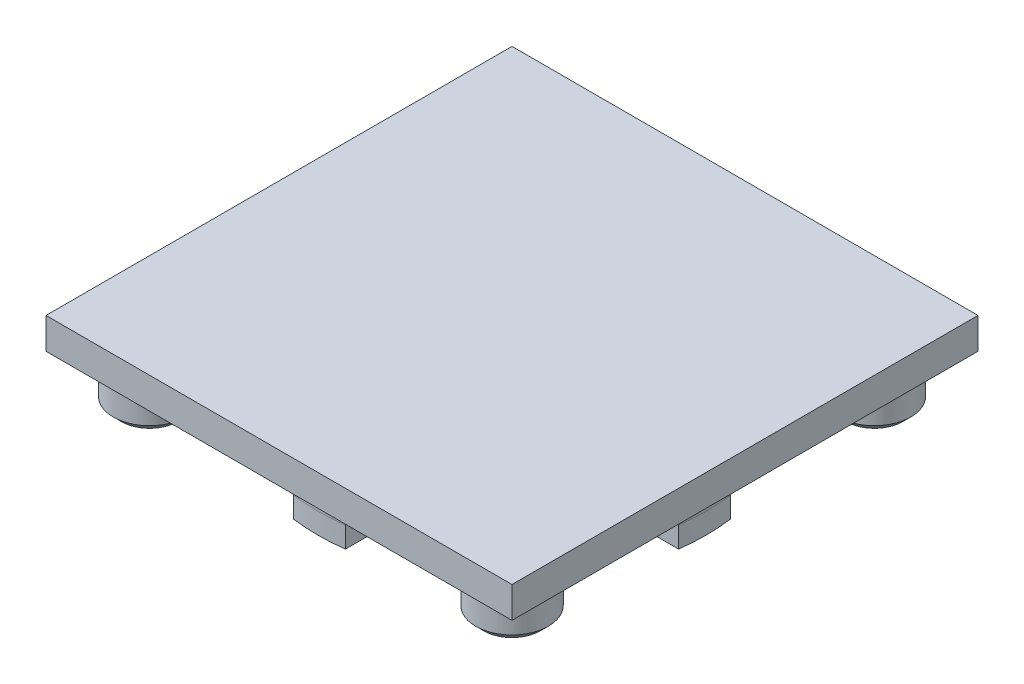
ISO-10303-21;
HEADER;
FILE_DESCRIPTION(('STEP AP214'),'2;1');
FILE_NAME('part.step','',(''),(''),'','','');
FILE_SCHEMA(('AUTOMOTIVE_DESIGN { 1 0 10303 214 1 1 1 1 }'));
ENDSEC;
DATA;
#1=APPLICATION_CONTEXT('core data for automotive mechanical design processes');
#2=APPLICATION_PROTOCOL_DEFINITION('international standard','automotive_design',2000,#1);
#3=PRODUCT_CONTEXT('',#1,'mechanical');
#4=PRODUCT('Part','Part','',(#3));
#5=PRODUCT_RELATED_PRODUCT_CATEGORY('part','',(#4));
#6=PRODUCT_DEFINITION_FORMATION('','',#4);
#7=PRODUCT_DEFINITION_CONTEXT('part definition',#1,'design');
#8=PRODUCT_DEFINITION('design','',#6,#7);
#9=PRODUCT_DEFINITION_SHAPE('','',#8);
#10=(LENGTH_UNIT() NAMED_UNIT(*) SI_UNIT(.MILLI.,.METRE.));
#11=(NAMED_UNIT(*) PLANE_ANGLE_UNIT() SI_UNIT($,.RADIAN.));
#12=(NAMED_UNIT(*) SI_UNIT($,.STERADIAN.) SOLID_ANGLE_UNIT());
#13=UNCERTAINTY_MEASURE_WITH_UNIT(LENGTH_MEASURE(1.E-05),#10,'distance_accuracy_value','');
#14=(GEOMETRIC_REPRESENTATION_CONTEXT(3) GLOBAL_UNCERTAINTY_ASSIGNED_CONTEXT((#13)) GLOBAL_UNIT_ASSIGNED_CONTEXT((#10,
#11,#12)) REPRESENTATION_CONTEXT('',''));
#15=CARTESIAN_POINT('',(0.,0.,0.));
#16=DIRECTION('',(0.,0.,1.));
#17=DIRECTION('',(1.,0.,0.));
#18=AXIS2_PLACEMENT_3D('',#15,#16,#17);
#19=CARTESIAN_POINT('',(-29.5,-27.,35.));
#20=DIRECTION('',(0.,1.,0.));
#21=DIRECTION('',(0.,0.,1.));
#22=AXIS2_PLACEMENT_3D('',#19,#20,#21);
#23=PLANE('',#22);
#24=CARTESIAN_POINT('',(-35.,-26.9999999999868,35.));
#25=DIRECTION('',(0.,1.,0.));
#26=DIRECTION('',(-1.,0.,0.));
#27=AXIS2_PLACEMENT_3D('',#24,#25,#26);
#28=CIRCLE('',#27,5.49999999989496);
#29=CARTESIAN_POINT('',(-40.499999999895,-26.9999999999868,35.));
#30=VERTEX_POINT('',#29);
#31=EDGE_CURVE('E691',#30,#30,#28,.T.);
#32=ORIENTED_EDGE('',*,*,#31,.F.);
#33=EDGE_LOOP('',(#32));
#34=FACE_BOUND('',#33,.T.);
#35=ADVANCED_FACE('F17',(#34),#23,.F.);
#36=CARTESIAN_POINT('',(-29.5,-27.,-35.));
#37=DIRECTION('',(0.,1.,0.));
#38=DIRECTION('',(0.,0.,1.));
#39=AXIS2_PLACEMENT_3D('',#36,#37,#38);
#40=PLANE('',#39);
#41=CARTESIAN_POINT('',(-35.,-26.9999999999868,-35.));
#42=DIRECTION('',(0.,1.,0.));
#43=DIRECTION('',(-1.,0.,0.));
#44=AXIS2_PLACEMENT_3D('',#41,#42,#43);
#45=CIRCLE('',#44,5.49999999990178);
#46=CARTESIAN_POINT('',(-40.4999999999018,-26.9999999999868,-35.));
#47=VERTEX_POINT('',#46);
#48=EDGE_CURVE('E688',#47,#47,#45,.T.);
#49=ORIENTED_EDGE('',*,*,#48,.F.);
#50=EDGE_LOOP('',(#49));
#51=FACE_BOUND('',#50,.T.);
#52=ADVANCED_FACE('F1107',(#51),#40,.F.);
#53=CARTESIAN_POINT('',(40.5,-27.,35.));
#54=DIRECTION('',(0.,1.,0.));
#55=DIRECTION('',(0.,0.,1.));
#56=AXIS2_PLACEMENT_3D('',#53,#54,#55);
#57=PLANE('',#56);
#58=CARTESIAN_POINT('',(35.,-26.9999999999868,35.));
#59=DIRECTION('',(0.,1.,0.));
#60=DIRECTION('',(-1.,0.,0.));
#61=AXIS2_PLACEMENT_3D('',#58,#59,#60);
#62=CIRCLE('',#61,5.49999999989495);
#63=CARTESIAN_POINT('',(29.5000000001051,-26.9999999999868,35.));
#64=VERTEX_POINT('',#63);
#65=EDGE_CURVE('E685',#64,#64,#62,.T.);
#66=ORIENTED_EDGE('',*,*,#65,.F.);
#67=EDGE_LOOP('',(#66));
#68=FACE_BOUND('',#67,.T.);
#69=ADVANCED_FACE('F1104',(#68),#57,.F.);
#70=CARTESIAN_POINT('',(40.5,-27.,-35.));
#71=DIRECTION('',(0.,1.,0.));
#72=DIRECTION('',(0.,0.,1.));
#73=AXIS2_PLACEMENT_3D('',#70,#71,#72);
#74=PLANE('',#73);
#75=CARTESIAN_POINT('',(35.,-26.9999999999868,-35.));
#76=DIRECTION('',(0.,1.,0.));
#77=DIRECTION('',(-1.,0.,0.));
#78=AXIS2_PLACEMENT_3D('',#75,#76,#77);
#79=CIRCLE('',#78,5.49999999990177);
#80=CARTESIAN_POINT('',(29.5000000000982,-26.9999999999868,-35.));
#81=VERTEX_POINT('',#80);
#82=EDGE_CURVE('E274',#81,#81,#79,.T.);
#83=ORIENTED_EDGE('',*,*,#82,.F.);
#84=EDGE_LOOP('',(#83));
#85=FACE_BOUND('',#84,.T.);
#86=ADVANCED_FACE('F1098',(#85),#74,.F.);
#87=CARTESIAN_POINT('',(-5.,-26.,45.));
#88=DIRECTION('',(1.,0.,0.));
#89=DIRECTION('',(0.,0.,-1.));
#90=AXIS2_PLACEMENT_3D('',#87,#88,#89);
#91=PLANE('',#90);
#92=DIRECTION('',(0.,0.,-1.));
#93=VECTOR('',#92,1.);
#94=CARTESIAN_POINT('',(-5.,-26.,45.));
#95=LINE('',#94,#93);
#96=CARTESIAN_POINT('',(-5.,-26.,37.1651718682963));
#97=VERTEX_POINT('',#96);
#98=CARTESIAN_POINT('',(-5.,-26.,32.1130814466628));
#99=VERTEX_POINT('',#98);
#100=EDGE_CURVE('E680',#97,#99,#95,.T.);
#101=ORIENTED_EDGE('',*,*,#100,.T.);
#102=DIRECTION('',(0.,1.,0.));
#103=VECTOR('',#102,1.);
#104=CARTESIAN_POINT('',(-5.00000000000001,-30.,32.1130814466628));
#105=LINE('',#104,#103);
#106=CARTESIAN_POINT('',(-5.,-30.,32.1130814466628));
#107=VERTEX_POINT('',#106);
#108=EDGE_CURVE('E246',#107,#99,#105,.T.);
#109=ORIENTED_EDGE('',*,*,#108,.F.);
#110=DIRECTION('',(0.,0.,1.));
#111=VECTOR('',#110,1.);
#112=CARTESIAN_POINT('',(-5.,-30.,45.));
#113=LINE('',#112,#111);
#114=CARTESIAN_POINT('',(-5.,-30.,37.1651718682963));
#115=VERTEX_POINT('',#114);
#116=EDGE_CURVE('E232',#107,#115,#113,.T.);
#117=ORIENTED_EDGE('',*,*,#116,.T.);
#118=DIRECTION('',(0.,1.,0.));
#119=VECTOR('',#118,1.);
#120=CARTESIAN_POINT('',(-5.,-32.,37.1651718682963));
#121=LINE('',#120,#119);
#122=EDGE_CURVE('E238',#97,#115,#121,.F.);
#123=ORIENTED_EDGE('',*,*,#122,.F.);
#124=EDGE_LOOP('',(#101,#109,#117,#123));
#125=FACE_BOUND('',#124,.T.);
#126=ADVANCED_FACE('F244',(#125),#91,.F.);
#127=CARTESIAN_POINT('',(-35.,-25.4999999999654,35.));
#128=DIRECTION('',(0.,1.,0.));
#129=DIRECTION('',(-1.,0.,0.));
#130=AXIS2_PLACEMENT_3D('',#127,#128,#129);
#131=CONICAL_SURFACE('',#130,6.99999999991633,0.785398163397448);
#132=ORIENTED_EDGE('',*,*,#31,.T.);
#133=EDGE_LOOP('',(#132));
#134=FACE_BOUND('',#133,.T.);
#135=CARTESIAN_POINT('',(-35.,-25.5,35.));
#136=DIRECTION('',(0.,1.,0.));
#137=DIRECTION('',(0.,0.,1.));
#138=AXIS2_PLACEMENT_3D('',#135,#136,#137);
#139=CIRCLE('',#138,7.);
#140=CARTESIAN_POINT('',(-35.,-25.5,42.));
#141=VERTEX_POINT('',#140);
#142=EDGE_CURVE('E291',#141,#141,#139,.T.);
#143=ORIENTED_EDGE('',*,*,#142,.F.);
#144=EDGE_LOOP('',(#143));
#145=FACE_BOUND('',#144,.T.);
#146=ADVANCED_FACE('F1086',(#134,#145),#131,.T.);
#147=CARTESIAN_POINT('',(45.,-26.,5.));
#148=DIRECTION('',(0.,0.,-1.));
#149=DIRECTION('',(-1.,0.,0.));
#150=AXIS2_PLACEMENT_3D('',#147,#148,#149);
#151=PLANE('',#150);
#152=DIRECTION('',(1.,0.,0.));
#153=VECTOR('',#152,1.);
#154=CARTESIAN_POINT('',(-5.,-30.,5.));
#155=LINE('',#154,#153);
#156=CARTESIAN_POINT('',(-37.1651718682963,-30.,4.99999999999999));
#157=VERTEX_POINT('',#156);
#158=CARTESIAN_POINT('',(-32.1130814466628,-30.,5.));
#159=VERTEX_POINT('',#158);
#160=EDGE_CURVE('E247',#157,#159,#155,.T.);
#161=ORIENTED_EDGE('',*,*,#160,.T.);
#162=DIRECTION('',(0.,1.,0.));
#163=VECTOR('',#162,1.);
#164=CARTESIAN_POINT('',(-32.1130814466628,-30.,4.99999999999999));
#165=LINE('',#164,#163);
#166=CARTESIAN_POINT('',(-32.1130814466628,-26.,5.));
#167=VERTEX_POINT('',#166);
#168=EDGE_CURVE('E981',#167,#159,#165,.F.);
#169=ORIENTED_EDGE('',*,*,#168,.F.);
#170=DIRECTION('',(-1.,0.,0.));
#171=VECTOR('',#170,1.);
#172=CARTESIAN_POINT('',(45.,-26.,5.));
#173=LINE('',#172,#171);
#174=CARTESIAN_POINT('',(-37.1651718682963,-26.,4.99999999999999));
#175=VERTEX_POINT('',#174);
#176=EDGE_CURVE('E661',#167,#175,#173,.T.);
#177=ORIENTED_EDGE('',*,*,#176,.T.);
#178=DIRECTION('',(0.,1.,0.));
#179=VECTOR('',#178,1.);
#180=CARTESIAN_POINT('',(-37.1651718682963,-32.,4.99999999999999));
#181=LINE('',#180,#179);
#182=EDGE_CURVE('E294',#157,#175,#181,.T.);
#183=ORIENTED_EDGE('',*,*,#182,.F.);
#184=EDGE_LOOP('',(#161,#169,#177,#183));
#185=FACE_BOUND('',#184,.T.);
#186=ADVANCED_FACE('F1088',(#185),#151,.F.);
#187=CARTESIAN_POINT('',(-5.,-26.,45.));
#188=DIRECTION('',(1.,0.,0.));
#189=DIRECTION('',(0.,0.,-1.));
#190=AXIS2_PLACEMENT_3D('',#187,#188,#189);
#191=PLANE('',#190);
#192=DIRECTION('',(0.,0.,1.));
#193=VECTOR('',#192,1.);
#194=CARTESIAN_POINT('',(-5.,-30.,45.));
#195=LINE('',#194,#193);
#196=CARTESIAN_POINT('',(-4.99999999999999,-30.,-37.1651718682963));
#197=VERTEX_POINT('',#196);
#198=CARTESIAN_POINT('',(-5.,-30.,-32.1130814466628));
#199=VERTEX_POINT('',#198);
#200=EDGE_CURVE('E268',#197,#199,#195,.T.);
#201=ORIENTED_EDGE('',*,*,#200,.T.);
#202=DIRECTION('',(0.,1.,0.));
#203=VECTOR('',#202,1.);
#204=CARTESIAN_POINT('',(-5.,-30.,-32.1130814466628));
#205=LINE('',#204,#203);
#206=CARTESIAN_POINT('',(-5.,-26.,-32.1130814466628));
#207=VERTEX_POINT('',#206);
#208=EDGE_CURVE('E1065',#207,#199,#205,.F.);
#209=ORIENTED_EDGE('',*,*,#208,.F.);
#210=DIRECTION('',(0.,0.,-1.));
#211=VECTOR('',#210,1.);
#212=CARTESIAN_POINT('',(-5.,-26.,45.));
#213=LINE('',#212,#211);
#214=CARTESIAN_POINT('',(-4.99999999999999,-26.,-37.1651718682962));
#215=VERTEX_POINT('',#214);
#216=EDGE_CURVE('E1177',#207,#215,#213,.T.);
#217=ORIENTED_EDGE('',*,*,#216,.T.);
#218=DIRECTION('',(0.,1.,0.));
#219=VECTOR('',#218,1.);
#220=CARTESIAN_POINT('',(-4.99999999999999,-32.,-37.1651718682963));
#221=LINE('',#220,#219);
#222=EDGE_CURVE('E1063',#197,#215,#221,.T.);
#223=ORIENTED_EDGE('',*,*,#222,.F.);
#224=EDGE_LOOP('',(#201,#209,#217,#223));
#225=FACE_BOUND('',#224,.T.);
#226=ADVANCED_FACE('F1095',(#225),#191,.F.);
#227=CARTESIAN_POINT('',(45.,-30.,-5.));
#228=DIRECTION('',(0.,0.,1.));
#229=DIRECTION('',(1.,0.,0.));
#230=AXIS2_PLACEMENT_3D('',#227,#228,#229);
#231=PLANE('',#230);
#232=DIRECTION('',(-1.,0.,0.));
#233=VECTOR('',#232,1.);
#234=CARTESIAN_POINT('',(45.,-26.,-5.));
#235=LINE('',#234,#233);
#236=CARTESIAN_POINT('',(-37.1651718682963,-26.,-5.));
#237=VERTEX_POINT('',#236);
#238=CARTESIAN_POINT('',(-32.1130814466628,-26.,-5.));
#239=VERTEX_POINT('',#238);
#240=EDGE_CURVE('E603',#237,#239,#235,.F.);
#241=ORIENTED_EDGE('',*,*,#240,.T.);
#242=DIRECTION('',(0.,1.,0.));
#243=VECTOR('',#242,1.);
#244=CARTESIAN_POINT('',(-32.1130814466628,-30.,-5.00000000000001));
#245=LINE('',#244,#243);
#246=CARTESIAN_POINT('',(-32.1130814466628,-30.,-5.));
#247=VERTEX_POINT('',#246);
#248=EDGE_CURVE('E1170',#247,#239,#245,.T.);
#249=ORIENTED_EDGE('',*,*,#248,.F.);
#250=DIRECTION('',(1.,0.,0.));
#251=VECTOR('',#250,1.);
#252=CARTESIAN_POINT('',(-5.,-30.,-5.));
#253=LINE('',#252,#251);
#254=CARTESIAN_POINT('',(-37.1651718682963,-30.,-5.));
#255=VERTEX_POINT('',#254);
#256=EDGE_CURVE('E265',#247,#255,#253,.F.);
#257=ORIENTED_EDGE('',*,*,#256,.T.);
#258=DIRECTION('',(0.,1.,0.));
#259=VECTOR('',#258,1.);
#260=CARTESIAN_POINT('',(-37.1651718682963,-32.,-5.));
#261=LINE('',#260,#259);
#262=EDGE_CURVE('E966',#237,#255,#261,.F.);
#263=ORIENTED_EDGE('',*,*,#262,.F.);
#264=EDGE_LOOP('',(#241,#249,#257,#263));
#265=FACE_BOUND('',#264,.T.);
#266=ADVANCED_FACE('F1120',(#265),#231,.F.);
#267=CARTESIAN_POINT('',(-35.,-25.4999999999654,-35.));
#268=DIRECTION('',(0.,1.,0.));
#269=DIRECTION('',(-1.,0.,0.));
#270=AXIS2_PLACEMENT_3D('',#267,#268,#269);
#271=CONICAL_SURFACE('',#270,6.99999999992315,0.785398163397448);
#272=ORIENTED_EDGE('',*,*,#48,.T.);
#273=EDGE_LOOP('',(#272));
#274=FACE_BOUND('',#273,.T.);
#275=CARTESIAN_POINT('',(-35.,-25.5,-35.));
#276=DIRECTION('',(0.,1.,0.));
#277=DIRECTION('',(0.,0.,1.));
#278=AXIS2_PLACEMENT_3D('',#275,#276,#277);
#279=CIRCLE('',#278,7.);
#280=CARTESIAN_POINT('',(-35.,-25.5,-28.));
#281=VERTEX_POINT('',#280);
#282=EDGE_CURVE('E286',#281,#281,#279,.T.);
#283=ORIENTED_EDGE('',*,*,#282,.F.);
#284=EDGE_LOOP('',(#283));
#285=FACE_BOUND('',#284,.T.);
#286=ADVANCED_FACE('F1117',(#274,#285),#271,.T.);
#287=CARTESIAN_POINT('',(5.,-30.,45.));
#288=DIRECTION('',(-1.,0.,0.));
#289=DIRECTION('',(0.,0.,1.));
#290=AXIS2_PLACEMENT_3D('',#287,#288,#289);
#291=PLANE('',#290);
#292=DIRECTION('',(0.,0.,1.));
#293=VECTOR('',#292,1.);
#294=CARTESIAN_POINT('',(5.,-30.,45.));
#295=LINE('',#294,#293);
#296=CARTESIAN_POINT('',(5.,-30.,37.1651718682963));
#297=VERTEX_POINT('',#296);
#298=CARTESIAN_POINT('',(5.,-30.,32.1130814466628));
#299=VERTEX_POINT('',#298);
#300=EDGE_CURVE('E225',#297,#299,#295,.F.);
#301=ORIENTED_EDGE('',*,*,#300,.T.);
#302=DIRECTION('',(0.,1.,0.));
#303=VECTOR('',#302,1.);
#304=CARTESIAN_POINT('',(5.,-30.,32.1130814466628));
#305=LINE('',#304,#303);
#306=CARTESIAN_POINT('',(5.,-26.,32.1130814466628));
#307=VERTEX_POINT('',#306);
#308=EDGE_CURVE('E289',#307,#299,#305,.F.);
#309=ORIENTED_EDGE('',*,*,#308,.F.);
#310=DIRECTION('',(0.,0.,-1.));
#311=VECTOR('',#310,1.);
#312=CARTESIAN_POINT('',(5.,-26.,45.));
#313=LINE('',#312,#311);
#314=CARTESIAN_POINT('',(5.,-26.,37.1651718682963));
#315=VERTEX_POINT('',#314);
#316=EDGE_CURVE('E285',#307,#315,#313,.F.);
#317=ORIENTED_EDGE('',*,*,#316,.T.);
#318=DIRECTION('',(0.,1.,0.));
#319=VECTOR('',#318,1.);
#320=CARTESIAN_POINT('',(5.,-32.,37.1651718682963));
#321=LINE('',#320,#319);
#322=EDGE_CURVE('E237',#297,#315,#321,.T.);
#323=ORIENTED_EDGE('',*,*,#322,.F.);
#324=EDGE_LOOP('',(#301,#309,#317,#323));
#325=FACE_BOUND('',#324,.T.);
#326=ADVANCED_FACE('F988',(#325),#291,.F.);
#327=CARTESIAN_POINT('',(35.,-25.4999999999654,35.));
#328=DIRECTION('',(0.,1.,0.));
#329=DIRECTION('',(-1.,0.,0.));
#330=AXIS2_PLACEMENT_3D('',#327,#328,#329);
#331=CONICAL_SURFACE('',#330,6.99999999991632,0.785398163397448);
#332=ORIENTED_EDGE('',*,*,#65,.T.);
#333=EDGE_LOOP('',(#332));
#334=FACE_BOUND('',#333,.T.);
#335=CARTESIAN_POINT('',(35.,-25.5,35.));
#336=DIRECTION('',(0.,1.,0.));
#337=DIRECTION('',(0.,0.,1.));
#338=AXIS2_PLACEMENT_3D('',#335,#336,#337);
#339=CIRCLE('',#338,7.);
#340=CARTESIAN_POINT('',(35.,-25.5,42.));
#341=VERTEX_POINT('',#340);
#342=EDGE_CURVE('E281',#341,#341,#339,.T.);
#343=ORIENTED_EDGE('',*,*,#342,.F.);
#344=EDGE_LOOP('',(#343));
#345=FACE_BOUND('',#344,.T.);
#346=ADVANCED_FACE('F1143',(#334,#345),#331,.T.);
#347=CARTESIAN_POINT('',(5.,-30.,45.));
#348=DIRECTION('',(-1.,0.,0.));
#349=DIRECTION('',(0.,0.,1.));
#350=AXIS2_PLACEMENT_3D('',#347,#348,#349);
#351=PLANE('',#350);
#352=DIRECTION('',(0.,0.,-1.));
#353=VECTOR('',#352,1.);
#354=CARTESIAN_POINT('',(5.,-26.,45.));
#355=LINE('',#354,#353);
#356=CARTESIAN_POINT('',(5.,-26.,-37.1651718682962));
#357=VERTEX_POINT('',#356);
#358=CARTESIAN_POINT('',(5.,-26.,-32.1130814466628));
#359=VERTEX_POINT('',#358);
#360=EDGE_CURVE('E556',#357,#359,#355,.F.);
#361=ORIENTED_EDGE('',*,*,#360,.T.);
#362=DIRECTION('',(0.,1.,0.));
#363=VECTOR('',#362,1.);
#364=CARTESIAN_POINT('',(5.00000000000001,-30.,-32.1130814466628));
#365=LINE('',#364,#363);
#366=CARTESIAN_POINT('',(5.,-30.,-32.1130814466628));
#367=VERTEX_POINT('',#366);
#368=EDGE_CURVE('E560',#367,#359,#365,.T.);
#369=ORIENTED_EDGE('',*,*,#368,.F.);
#370=DIRECTION('',(0.,0.,1.));
#371=VECTOR('',#370,1.);
#372=CARTESIAN_POINT('',(5.,-30.,45.));
#373=LINE('',#372,#371);
#374=CARTESIAN_POINT('',(5.,-30.,-37.1651718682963));
#375=VERTEX_POINT('',#374);
#376=EDGE_CURVE('E271',#367,#375,#373,.F.);
#377=ORIENTED_EDGE('',*,*,#376,.T.);
#378=DIRECTION('',(0.,1.,0.));
#379=VECTOR('',#378,1.);
#380=CARTESIAN_POINT('',(5.,-32.,-37.1651718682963));
#381=LINE('',#380,#379);
#382=EDGE_CURVE('E1060',#357,#375,#381,.F.);
#383=ORIENTED_EDGE('',*,*,#382,.F.);
#384=EDGE_LOOP('',(#361,#369,#377,#383));
#385=FACE_BOUND('',#384,.T.);
#386=ADVANCED_FACE('F1059',(#385),#351,.F.);
#387=CARTESIAN_POINT('',(35.,-25.4999999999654,-35.));
#388=DIRECTION('',(0.,1.,0.));
#389=DIRECTION('',(-1.,0.,0.));
#390=AXIS2_PLACEMENT_3D('',#387,#388,#389);
#391=CONICAL_SURFACE('',#390,6.99999999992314,0.785398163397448);
#392=ORIENTED_EDGE('',*,*,#82,.T.);
#393=EDGE_LOOP('',(#392));
#394=FACE_BOUND('',#393,.T.);
#395=CARTESIAN_POINT('',(35.,-25.5,-35.));
#396=DIRECTION('',(0.,1.,0.));
#397=DIRECTION('',(0.,0.,1.));
#398=AXIS2_PLACEMENT_3D('',#395,#396,#397);
#399=CIRCLE('',#398,7.);
#400=CARTESIAN_POINT('',(35.,-25.5,-28.));
#401=VERTEX_POINT('',#400);
#402=EDGE_CURVE('E276',#401,#401,#399,.T.);
#403=ORIENTED_EDGE('',*,*,#402,.F.);
#404=EDGE_LOOP('',(#403));
#405=FACE_BOUND('',#404,.T.);
#406=ADVANCED_FACE('F1151',(#394,#405),#391,.T.);
#407=CARTESIAN_POINT('',(-5.,-30.,45.));
#408=DIRECTION('',(0.,1.,0.));
#409=DIRECTION('',(0.,0.,1.));
#410=AXIS2_PLACEMENT_3D('',#407,#408,#409);
#411=PLANE('',#410);
#412=DIRECTION('',(-1.,0.,0.));
#413=VECTOR('',#412,1.);
#414=CARTESIAN_POINT('',(45.,-30.,5.));
#415=LINE('',#414,#413);
#416=CARTESIAN_POINT('',(37.1651718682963,-30.,5.));
#417=VERTEX_POINT('',#416);
#418=CARTESIAN_POINT('',(32.1130814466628,-30.,5.));
#419=VERTEX_POINT('',#418);
#420=EDGE_CURVE('E255',#417,#419,#415,.T.);
#421=ORIENTED_EDGE('',*,*,#420,.T.);
#422=CARTESIAN_POINT('',(0.,-30.,0.));
#423=DIRECTION('',(0.,1.,0.));
#424=DIRECTION('',(0.,0.,1.));
#425=AXIS2_PLACEMENT_3D('',#422,#423,#424);
#426=CIRCLE('',#425,32.5);
#427=EDGE_CURVE('E568',#299,#419,#426,.T.);
#428=ORIENTED_EDGE('',*,*,#427,.F.);
#429=ORIENTED_EDGE('',*,*,#300,.F.);
#430=CARTESIAN_POINT('',(0.,-30.,0.));
#431=DIRECTION('',(0.,1.,0.));
#432=DIRECTION('',(0.,0.,1.));
#433=AXIS2_PLACEMENT_3D('',#430,#431,#432);
#434=CIRCLE('',#433,37.5);
#435=EDGE_CURVE('E227',#115,#297,#434,.T.);
#436=ORIENTED_EDGE('',*,*,#435,.F.);
#437=ORIENTED_EDGE('',*,*,#116,.F.);
#438=CARTESIAN_POINT('',(0.,-30.,0.));
#439=DIRECTION('',(0.,1.,0.));
#440=DIRECTION('',(0.,0.,1.));
#441=AXIS2_PLACEMENT_3D('',#438,#439,#440);
#442=CIRCLE('',#441,32.5);
#443=EDGE_CURVE('E681',#159,#107,#442,.T.);
#444=ORIENTED_EDGE('',*,*,#443,.F.);
#445=ORIENTED_EDGE('',*,*,#160,.F.);
#446=CARTESIAN_POINT('',(0.,-30.,0.));
#447=DIRECTION('',(0.,1.,0.));
#448=DIRECTION('',(0.,0.,1.));
#449=AXIS2_PLACEMENT_3D('',#446,#447,#448);
#450=CIRCLE('',#449,37.5);
#451=EDGE_CURVE('E662',#255,#157,#450,.T.);
#452=ORIENTED_EDGE('',*,*,#451,.F.);
#453=ORIENTED_EDGE('',*,*,#256,.F.);
#454=CARTESIAN_POINT('',(0.,-30.,0.));
#455=DIRECTION('',(0.,1.,0.));
#456=DIRECTION('',(0.,0.,1.));
#457=AXIS2_PLACEMENT_3D('',#454,#455,#456);
#458=CIRCLE('',#457,32.5);
#459=EDGE_CURVE('E1167',#199,#247,#458,.T.);
#460=ORIENTED_EDGE('',*,*,#459,.F.);
#461=ORIENTED_EDGE('',*,*,#200,.F.);
#462=CARTESIAN_POINT('',(0.,-30.,0.));
#463=DIRECTION('',(0.,1.,0.));
#464=DIRECTION('',(0.,0.,1.));
#465=AXIS2_PLACEMENT_3D('',#462,#463,#464);
#466=CIRCLE('',#465,37.5);
#467=EDGE_CURVE('E663',#375,#197,#466,.T.);
#468=ORIENTED_EDGE('',*,*,#467,.F.);
#469=ORIENTED_EDGE('',*,*,#376,.F.);
#470=CARTESIAN_POINT('',(0.,-30.,0.));
#471=DIRECTION('',(0.,1.,0.));
#472=DIRECTION('',(0.,0.,1.));
#473=AXIS2_PLACEMENT_3D('',#470,#471,#472);
#474=CIRCLE('',#473,32.5);
#475=CARTESIAN_POINT('',(32.1130814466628,-30.,-5.));
#476=VERTEX_POINT('',#475);
#477=EDGE_CURVE('E284',#476,#367,#474,.T.);
#478=ORIENTED_EDGE('',*,*,#477,.F.);
#479=DIRECTION('',(1.,0.,0.));
#480=VECTOR('',#479,1.);
#481=CARTESIAN_POINT('',(45.,-30.,-5.));
#482=LINE('',#481,#480);
#483=CARTESIAN_POINT('',(37.1651718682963,-30.,-5.));
#484=VERTEX_POINT('',#483);
#485=EDGE_CURVE('E253',#476,#484,#482,.T.);
#486=ORIENTED_EDGE('',*,*,#485,.T.);
#487=CARTESIAN_POINT('',(0.,-30.,0.));
#488=DIRECTION('',(0.,1.,0.));
#489=DIRECTION('',(0.,0.,1.));
#490=AXIS2_PLACEMENT_3D('',#487,#488,#489);
#491=CIRCLE('',#490,37.5);
#492=EDGE_CURVE('E557',#417,#484,#491,.T.);
#493=ORIENTED_EDGE('',*,*,#492,.F.);
#494=EDGE_LOOP('',(#421,#428,#429,#436,#437,#444,#445,#452,#453,#460,#461,#468,#469,#478,#486,#493));
#495=FACE_BOUND('',#494,.T.);
#496=ADVANCED_FACE('F230',(#495),#411,.F.);
#497=CARTESIAN_POINT('',(45.,-26.,5.));
#498=DIRECTION('',(0.,0.,-1.));
#499=DIRECTION('',(-1.,0.,0.));
#500=AXIS2_PLACEMENT_3D('',#497,#498,#499);
#501=PLANE('',#500);
#502=DIRECTION('',(-1.,0.,0.));
#503=VECTOR('',#502,1.);
#504=CARTESIAN_POINT('',(45.,-26.,5.));
#505=LINE('',#504,#503);
#506=CARTESIAN_POINT('',(37.1651718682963,-26.,5.));
#507=VERTEX_POINT('',#506);
#508=CARTESIAN_POINT('',(32.1130814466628,-26.,5.));
#509=VERTEX_POINT('',#508);
#510=EDGE_CURVE('E999',#507,#509,#505,.T.);
#511=ORIENTED_EDGE('',*,*,#510,.T.);
#512=DIRECTION('',(0.,1.,0.));
#513=VECTOR('',#512,1.);
#514=CARTESIAN_POINT('',(32.1130814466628,-30.,5.));
#515=LINE('',#514,#513);
#516=EDGE_CURVE('E567',#419,#509,#515,.T.);
#517=ORIENTED_EDGE('',*,*,#516,.F.);
#518=ORIENTED_EDGE('',*,*,#420,.F.);
#519=DIRECTION('',(0.,1.,0.));
#520=VECTOR('',#519,1.);
#521=CARTESIAN_POINT('',(37.1651718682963,-32.,5.));
#522=LINE('',#521,#520);
#523=EDGE_CURVE('E1016',#507,#417,#522,.F.);
#524=ORIENTED_EDGE('',*,*,#523,.F.);
#525=EDGE_LOOP('',(#511,#517,#518,#524));
#526=FACE_BOUND('',#525,.T.);
#527=ADVANCED_FACE('F1375',(#526),#501,.F.);
#528=CARTESIAN_POINT('',(45.,-30.,-5.));
#529=DIRECTION('',(0.,0.,1.));
#530=DIRECTION('',(1.,0.,0.));
#531=AXIS2_PLACEMENT_3D('',#528,#529,#530);
#532=PLANE('',#531);
#533=ORIENTED_EDGE('',*,*,#485,.F.);
#534=DIRECTION('',(0.,1.,0.));
#535=VECTOR('',#534,1.);
#536=CARTESIAN_POINT('',(32.1130814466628,-30.,-5.));
#537=LINE('',#536,#535);
#538=CARTESIAN_POINT('',(32.1130814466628,-26.,-5.));
#539=VERTEX_POINT('',#538);
#540=EDGE_CURVE('E712',#539,#476,#537,.F.);
#541=ORIENTED_EDGE('',*,*,#540,.F.);
#542=DIRECTION('',(-1.,0.,0.));
#543=VECTOR('',#542,1.);
#544=CARTESIAN_POINT('',(45.,-26.,-5.));
#545=LINE('',#544,#543);
#546=CARTESIAN_POINT('',(37.1651718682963,-26.,-5.));
#547=VERTEX_POINT('',#546);
#548=EDGE_CURVE('E507',#539,#547,#545,.F.);
#549=ORIENTED_EDGE('',*,*,#548,.T.);
#550=DIRECTION('',(0.,1.,0.));
#551=VECTOR('',#550,1.);
#552=CARTESIAN_POINT('',(37.1651718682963,-32.,-5.));
#553=LINE('',#552,#551);
#554=EDGE_CURVE('E279',#484,#547,#553,.T.);
#555=ORIENTED_EDGE('',*,*,#554,.F.);
#556=EDGE_LOOP('',(#533,#541,#549,#555));
#557=FACE_BOUND('',#556,.T.);
#558=ADVANCED_FACE('F710',(#557),#532,.F.);
#559=CARTESIAN_POINT('',(0.,-32.,0.));
#560=DIRECTION('',(0.,1.,0.));
#561=DIRECTION('',(0.,0.,1.));
#562=AXIS2_PLACEMENT_3D('',#559,#560,#561);
#563=CYLINDRICAL_SURFACE('',#562,37.5);
#564=ORIENTED_EDGE('',*,*,#322,.T.);
#565=CARTESIAN_POINT('',(0.,-26.,0.));
#566=DIRECTION('',(0.,1.,0.));
#567=DIRECTION('',(0.,0.,1.));
#568=AXIS2_PLACEMENT_3D('',#565,#566,#567);
#569=CIRCLE('',#568,37.5);
#570=EDGE_CURVE('E251',#315,#97,#569,.F.);
#571=ORIENTED_EDGE('',*,*,#570,.T.);
#572=ORIENTED_EDGE('',*,*,#122,.T.);
#573=ORIENTED_EDGE('',*,*,#435,.T.);
#574=EDGE_LOOP('',(#564,#571,#572,#573));
#575=FACE_BOUND('',#574,.T.);
#576=ADVANCED_FACE('F249',(#575),#563,.T.);
#577=CARTESIAN_POINT('',(0.,-30.,0.));
#578=DIRECTION('',(0.,1.,0.));
#579=DIRECTION('',(0.,0.,1.));
#580=AXIS2_PLACEMENT_3D('',#577,#578,#579);
#581=CYLINDRICAL_SURFACE('',#580,32.5);
#582=CARTESIAN_POINT('',(-29.786742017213,-18.,13.));
#583=CARTESIAN_POINT('',(-29.8825707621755,-17.9999794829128,12.7804892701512));
#584=CARTESIAN_POINT('',(-29.9759454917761,-18.0090349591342,12.5598629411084));
#585=CARTESIAN_POINT('',(-30.1573279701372,-18.0456976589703,12.1178481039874));
#586=CARTESIAN_POINT('',(-30.245333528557,-18.0733123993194,11.896459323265));
#587=CARTESIAN_POINT('',(-30.4155935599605,-18.1475609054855,11.4541707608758));
#588=CARTESIAN_POINT('',(-30.497837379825,-18.1942288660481,11.2332725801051));
#589=CARTESIAN_POINT('',(-30.6560061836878,-18.3067827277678,10.7941516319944));
#590=CARTESIAN_POINT('',(-30.7319320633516,-18.3726658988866,10.5759284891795));
#591=CARTESIAN_POINT('',(-30.8774163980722,-18.5238941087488,10.1433423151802));
#592=CARTESIAN_POINT('',(-30.9469553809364,-18.609296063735,9.9289925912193));
#593=CARTESIAN_POINT('',(-31.0792560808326,-18.7992385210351,9.50677576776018));
#594=CARTESIAN_POINT('',(-31.1420179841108,-18.9037784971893,9.29890849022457));
#595=CARTESIAN_POINT('',(-31.2606653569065,-19.1313958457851,8.89188896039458));
#596=CARTESIAN_POINT('',(-31.3165594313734,-19.254449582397,8.69272600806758));
#597=CARTESIAN_POINT('',(-31.4216609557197,-19.5184811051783,8.30479447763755));
#598=CARTESIAN_POINT('',(-31.4708688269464,-19.6594577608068,8.11602524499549));
#599=CARTESIAN_POINT('',(-31.5603099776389,-19.9502396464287,7.76070621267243));
#600=CARTESIAN_POINT('',(-31.6008860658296,-20.0991459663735,7.59350621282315));
#601=CARTESIAN_POINT('',(-31.6765166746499,-20.411148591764,7.27156366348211));
#602=CARTESIAN_POINT('',(-31.7115713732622,-20.5742444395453,7.11682071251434));
#603=CARTESIAN_POINT('',(-31.776491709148,-20.9135518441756,6.82110761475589));
#604=CARTESIAN_POINT('',(-31.8063552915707,-21.0897685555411,6.6801429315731));
#605=CARTESIAN_POINT('',(-31.8612332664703,-21.4539792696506,6.41329692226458));
#606=CARTESIAN_POINT('',(-31.886247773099,-21.6419729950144,6.28741524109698));
#607=CARTESIAN_POINT('',(-31.931225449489,-22.0234739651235,6.05479364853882));
#608=CARTESIAN_POINT('',(-31.9513000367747,-22.2167228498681,5.94765127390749));
#609=CARTESIAN_POINT('',(-31.9875327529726,-22.611711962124,5.74959889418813));
#610=CARTESIAN_POINT('',(-32.0036909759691,-22.8134519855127,5.65868849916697));
#611=CARTESIAN_POINT('',(-32.032396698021,-23.2238836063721,5.49386615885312));
#612=CARTESIAN_POINT('',(-32.0449462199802,-23.4325712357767,5.41994469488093));
#613=CARTESIAN_POINT('',(-32.0667142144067,-23.855433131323,5.28963028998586));
#614=CARTESIAN_POINT('',(-32.0759334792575,-24.0696060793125,5.23323317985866));
#615=CARTESIAN_POINT('',(-32.0935759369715,-24.5671648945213,5.12409816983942));
#616=CARTESIAN_POINT('',(-32.1009252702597,-24.8519892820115,5.07756520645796));
#617=CARTESIAN_POINT('',(-32.108237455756,-25.2814512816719,5.03103282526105));
#618=CARTESIAN_POINT('',(-32.110056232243,-25.4249022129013,5.01939988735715));
#619=CARTESIAN_POINT('',(-32.1124769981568,-25.7122240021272,5.00388427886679));
#620=CARTESIAN_POINT('',(-32.113079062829,-25.8560948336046,5.00000112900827));
#621=CARTESIAN_POINT('',(-32.1130814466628,-26.,5.));
#622=B_SPLINE_CURVE_WITH_KNOTS('',3,(#582,#583,#584,#585,#586,#587,#588,#589,#590,#591,#592,
#593,#594,#595,#596,#597,#598,#599,#600,#601,#602,#603,#604,#605,#606,#607,#608,#609,#610,#611,
#612,#613,#614,#615,#616,#617,#618,#619,#620,#621),.UNSPECIFIED.,.F.,.F.,(4,2,2,2,2,2,2,2,2,2,2,
2,2,2,2,2,2,2,2,4),(0.,0.718423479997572,1.43713810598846,2.15714831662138,2.8770562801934,
3.59909088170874,4.32110563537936,5.04220632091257,5.76326154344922,6.44504856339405,
7.1268136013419,7.80884789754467,8.49086613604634,9.15569588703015,9.8205096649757,
10.4849500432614,11.1492322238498,12.0133552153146,12.4449752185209,12.8765685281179),.UNSPECIFIED.);
#623=CARTESIAN_POINT('',(-29.786742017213,-18.,13.));
#624=VERTEX_POINT('',#623);
#625=EDGE_CURVE('E653',#624,#167,#622,.T.);
#626=ORIENTED_EDGE('',*,*,#625,.T.);
#627=ORIENTED_EDGE('',*,*,#168,.T.);
#628=ORIENTED_EDGE('',*,*,#443,.T.);
#629=ORIENTED_EDGE('',*,*,#108,.T.);
#630=CARTESIAN_POINT('',(-5.,-26.,32.1130814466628));
#631=CARTESIAN_POINT('',(-4.99997470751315,-25.7780033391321,32.1130680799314));
#632=CARTESIAN_POINT('',(-5.0092394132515,-25.5560095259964,32.1116423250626));
#633=CARTESIAN_POINT('',(-5.04616684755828,-25.1136031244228,32.1058693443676));
#634=CARTESIAN_POINT('',(-5.07382892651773,-24.8931904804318,32.1015222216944));
#635=CARTESIAN_POINT('',(-5.14734452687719,-24.4556526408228,32.0898137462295));
#636=CARTESIAN_POINT('',(-5.19318585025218,-24.238525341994,32.0824544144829));
#637=CARTESIAN_POINT('',(-5.30269938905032,-23.8089532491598,32.0645361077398));
#638=CARTESIAN_POINT('',(-5.36637133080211,-23.5965083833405,32.0539771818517));
#639=CARTESIAN_POINT('',(-5.5110957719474,-23.1776903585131,32.0294115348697));
#640=CARTESIAN_POINT('',(-5.59215828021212,-22.9713207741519,32.015402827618));
#641=CARTESIAN_POINT('',(-5.77100163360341,-22.5662561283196,31.9836487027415));
#642=CARTESIAN_POINT('',(-5.8687824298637,-22.3675610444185,31.9659032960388));
#643=CARTESIAN_POINT('',(-6.08025685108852,-21.9793021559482,31.9263533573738));
#644=CARTESIAN_POINT('',(-6.1939472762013,-21.7897365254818,31.9045496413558));
#645=CARTESIAN_POINT('',(-6.43632701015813,-21.4210408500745,31.856537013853));
#646=CARTESIAN_POINT('',(-6.56501619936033,-21.2419107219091,31.8303281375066));
#647=CARTESIAN_POINT('',(-6.83601444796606,-20.8957380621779,31.7732281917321));
#648=CARTESIAN_POINT('',(-6.97829157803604,-20.728668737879,31.7423480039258));
#649=CARTESIAN_POINT('',(-7.27552146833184,-20.4073038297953,31.6755423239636));
#650=CARTESIAN_POINT('',(-7.43047422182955,-20.2530082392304,31.6396168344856));
#651=CARTESIAN_POINT('',(-7.75172391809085,-19.9582190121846,31.5624468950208));
#652=CARTESIAN_POINT('',(-7.91801934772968,-19.8177235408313,31.5212031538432));
#653=CARTESIAN_POINT('',(-8.2605629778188,-19.5513717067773,31.4331729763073));
#654=CARTESIAN_POINT('',(-8.43681111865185,-19.4255152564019,31.3863865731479));
#655=CARTESIAN_POINT('',(-8.79834074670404,-19.1887670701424,31.2869693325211));
#656=CARTESIAN_POINT('',(-8.9836486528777,-19.0779231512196,31.2343207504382));
#657=CARTESIAN_POINT('',(-9.36125301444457,-18.8721846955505,31.1232335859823));
#658=CARTESIAN_POINT('',(-9.55354968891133,-18.7772906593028,31.0647948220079));
#659=CARTESIAN_POINT('',(-9.94367853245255,-18.6037504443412,30.9421248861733));
#660=CARTESIAN_POINT('',(-10.1415137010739,-18.5251132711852,30.8778905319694));
#661=CARTESIAN_POINT('',(-10.5410733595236,-18.384322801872,30.7437825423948));
#662=CARTESIAN_POINT('',(-10.7427974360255,-18.3221677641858,30.6739095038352));
#663=CARTESIAN_POINT('',(-11.1158355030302,-18.2230521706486,30.5404790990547));
#664=CARTESIAN_POINT('',(-11.2867934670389,-18.18364299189,30.4777269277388));
#665=CARTESIAN_POINT('',(-11.6295851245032,-18.116316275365,30.3485798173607));
#666=CARTESIAN_POINT('',(-11.8014187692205,-18.0883981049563,30.2821850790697));
#667=CARTESIAN_POINT('',(-12.1447986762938,-18.0439625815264,30.1461085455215));
#668=CARTESIAN_POINT('',(-12.3163447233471,-18.0274199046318,30.0764344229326));
#669=CARTESIAN_POINT('',(-12.6588128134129,-18.0054357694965,29.9339105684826));
#670=CARTESIAN_POINT('',(-12.8297349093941,-17.9999933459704,29.8610611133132));
#671=CARTESIAN_POINT('',(-13.,-18.,29.786742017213));
#672=B_SPLINE_CURVE_WITH_KNOTS('',3,(#630,#631,#632,#633,#634,#635,#636,#637,#638,#639,#640,
#641,#642,#643,#644,#645,#646,#647,#648,#649,#650,#651,#652,#653,#654,#655,#656,#657,#658,#659,
#660,#661,#662,#663,#664,#665,#666,#667,#668,#669,#670,#671),.UNSPECIFIED.,.F.,.F.,(4,2,2,2,2,2,
2,2,2,2,2,2,2,2,2,2,2,2,2,2,4),(0.,0.665788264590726,1.3315530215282,1.99687181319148,
2.66218039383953,3.3278729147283,3.99356348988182,4.65912036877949,5.32467193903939,
5.98869635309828,6.65272041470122,7.31665606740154,7.98058774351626,8.64658675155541,
9.31260665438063,9.97899451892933,10.645311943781,11.2039072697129,11.7624718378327,
12.319788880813,12.8770574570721),.UNSPECIFIED.);
#673=CARTESIAN_POINT('',(-13.,-18.,29.786742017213));
#674=VERTEX_POINT('',#673);
#675=EDGE_CURVE('E295',#99,#674,#672,.T.);
#676=ORIENTED_EDGE('',*,*,#675,.T.);
#677=CARTESIAN_POINT('',(0.,-18.,0.));
#678=DIRECTION('',(0.,1.,0.));
#679=DIRECTION('',(0.,0.,1.));
#680=AXIS2_PLACEMENT_3D('',#677,#678,#679);
#681=CIRCLE('',#680,32.5);
#682=EDGE_CURVE('E462',#674,#624,#681,.F.);
#683=ORIENTED_EDGE('',*,*,#682,.T.);
#684=EDGE_LOOP('',(#626,#627,#628,#629,#676,#683));
#685=FACE_BOUND('',#684,.T.);
#686=ADVANCED_FACE('F665',(#685),#581,.T.);
#687=CARTESIAN_POINT('',(-13.,-26.,45.));
#688=DIRECTION('',(0.,0.,-1.));
#689=DIRECTION('',(-1.,0.,0.));
#690=AXIS2_PLACEMENT_3D('',#687,#688,#689);
#691=CYLINDRICAL_SURFACE('',#690,8.);
#692=DIRECTION('',(0.,0.,1.));
#693=VECTOR('',#692,1.);
#694=CARTESIAN_POINT('',(-13.,-18.,45.));
#695=LINE('',#694,#693);
#696=CARTESIAN_POINT('',(-13.,-18.,43.6033255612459));
#697=VERTEX_POINT('',#696);
#698=EDGE_CURVE('E449',#697,#674,#695,.F.);
#699=ORIENTED_EDGE('',*,*,#698,.T.);
#700=ORIENTED_EDGE('',*,*,#675,.F.);
#701=ORIENTED_EDGE('',*,*,#100,.F.);
#702=CARTESIAN_POINT('',(-13.,-18.,43.6033255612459));
#703=CARTESIAN_POINT('',(-12.8914293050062,-18.0000001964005,43.5224143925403));
#704=CARTESIAN_POINT('',(-12.7829643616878,-18.0022094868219,43.4413611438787));
#705=CARTESIAN_POINT('',(-12.5588305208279,-18.01132919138,43.2734024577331));
#706=CARTESIAN_POINT('',(-12.4431854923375,-18.0185560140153,43.1864822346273));
#707=CARTESIAN_POINT('',(-12.2049825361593,-18.0386350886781,43.0068948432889));
#708=CARTESIAN_POINT('',(-12.0824596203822,-18.0518199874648,42.9142184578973));
#709=CARTESIAN_POINT('',(-11.830925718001,-18.0848073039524,42.7231655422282));
#710=CARTESIAN_POINT('',(-11.7019664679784,-18.1049592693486,42.6247805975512));
#711=CARTESIAN_POINT('',(-11.5225548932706,-18.1374286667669,42.4879242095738));
#712=CARTESIAN_POINT('',(-11.4717986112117,-18.1471119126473,42.4492091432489));
#713=CARTESIAN_POINT('',(-11.3260728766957,-18.1763820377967,42.3378533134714));
#714=CARTESIAN_POINT('',(-11.2313438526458,-18.1972103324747,42.265219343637));
#715=CARTESIAN_POINT('',(-10.9989320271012,-18.2528128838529,42.0863179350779));
#716=CARTESIAN_POINT('',(-10.8617040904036,-18.289574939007,41.9800753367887));
#717=CARTESIAN_POINT('',(-10.5462426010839,-18.3832057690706,41.7348945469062));
#718=CARTESIAN_POINT('',(-10.3686467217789,-18.4427645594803,41.596152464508));
#719=CARTESIAN_POINT('',(-10.0597406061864,-18.5585857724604,41.3538069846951));
#720=CARTESIAN_POINT('',(-9.92767293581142,-18.6121303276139,41.2498599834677));
#721=CARTESIAN_POINT('',(-9.6791670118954,-18.7207611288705,41.0534880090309));
#722=CARTESIAN_POINT('',(-9.56250043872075,-18.7751420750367,40.9609622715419));
#723=CARTESIAN_POINT('',(-9.34411168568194,-18.8834076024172,40.7873011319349));
#724=CARTESIAN_POINT('',(-9.24217506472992,-18.9366699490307,40.7060472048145));
#725=CARTESIAN_POINT('',(-9.05269606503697,-19.0409493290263,40.5545812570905));
#726=CARTESIAN_POINT('',(-8.96494308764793,-19.0914188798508,40.4842551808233));
#727=CARTESIAN_POINT('',(-8.7638215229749,-19.2123135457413,40.3225556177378));
#728=CARTESIAN_POINT('',(-8.65100896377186,-19.2840495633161,40.2314657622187));
#729=CARTESIAN_POINT('',(-8.43441218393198,-19.4295746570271,40.0560252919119));
#730=CARTESIAN_POINT('',(-8.3304754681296,-19.5030257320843,39.9715822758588));
#731=CARTESIAN_POINT('',(-8.13131694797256,-19.6510464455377,39.8093184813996));
#732=CARTESIAN_POINT('',(-8.03594077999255,-19.7252999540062,39.7313990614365));
#733=CARTESIAN_POINT('',(-7.85359999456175,-19.8740601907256,39.5820166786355));
#734=CARTESIAN_POINT('',(-7.76647843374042,-19.9482715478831,39.5104510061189));
#735=CARTESIAN_POINT('',(-7.57870526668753,-20.1154237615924,39.3557280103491));
#736=CARTESIAN_POINT('',(-7.47857602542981,-20.2092691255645,39.2729103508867));
#737=CARTESIAN_POINT('',(-7.28639695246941,-20.3990015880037,39.1134869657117));
#738=CARTESIAN_POINT('',(-7.19418479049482,-20.4946284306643,39.0367671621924));
#739=CARTESIAN_POINT('',(-7.01757419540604,-20.6872185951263,38.8894495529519));
#740=CARTESIAN_POINT('',(-6.93301049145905,-20.7839376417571,38.8187309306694));
#741=CARTESIAN_POINT('',(-6.77144920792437,-20.9780521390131,38.6832780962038));
#742=CARTESIAN_POINT('',(-6.69428241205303,-21.0752187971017,38.6184178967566));
#743=CARTESIAN_POINT('',(-6.53412287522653,-21.2870101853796,38.4834160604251));
#744=CARTESIAN_POINT('',(-6.45164966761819,-21.4022770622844,38.4136618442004));
#745=CARTESIAN_POINT('',(-6.29471436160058,-21.6345655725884,38.2806007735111));
#746=CARTESIAN_POINT('',(-6.22007325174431,-21.7513861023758,38.2171539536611));
#747=CARTESIAN_POINT('',(-6.07856901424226,-21.9862019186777,38.0966273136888));
#748=CARTESIAN_POINT('',(-6.01152512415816,-22.1040130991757,38.0394023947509));
#749=CARTESIAN_POINT('',(-5.91580375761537,-22.2827455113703,37.9575389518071));
#750=CARTESIAN_POINT('',(-5.88509381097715,-22.3418352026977,37.9312482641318));
#751=CARTESIAN_POINT('',(-5.82551910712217,-22.4600819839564,37.8801901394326));
#752=CARTESIAN_POINT('',(-5.79663129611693,-22.5192193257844,37.8554039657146));
#753=CARTESIAN_POINT('',(-5.73689263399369,-22.6454950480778,37.8040840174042));
#754=CARTESIAN_POINT('',(-5.70620421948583,-22.712764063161,37.7776822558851));
#755=CARTESIAN_POINT('',(-5.64691789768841,-22.8476857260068,37.7266210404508));
#756=CARTESIAN_POINT('',(-5.61829778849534,-22.915321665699,37.7019432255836));
#757=CARTESIAN_POINT('',(-5.56312445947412,-23.0509090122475,37.6543272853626));
#758=CARTESIAN_POINT('',(-5.5365493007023,-23.1188450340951,37.6313707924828));
#759=CARTESIAN_POINT('',(-5.48544301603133,-23.2549655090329,37.5871921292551));
#760=CARTESIAN_POINT('',(-5.46089024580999,-23.3231358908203,37.565951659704));
#761=CARTESIAN_POINT('',(-5.41380727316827,-23.45965984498,37.525196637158));
#762=CARTESIAN_POINT('',(-5.39125574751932,-23.5280006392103,37.5056639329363));
#763=CARTESIAN_POINT('',(-5.34815507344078,-23.6648018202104,37.4683132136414));
#764=CARTESIAN_POINT('',(-5.32758495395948,-23.7332507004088,37.4504772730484));
#765=CARTESIAN_POINT('',(-5.28842808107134,-23.8702062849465,37.4165061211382));
#766=CARTESIAN_POINT('',(-5.26982074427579,-23.9387027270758,37.400353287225));
#767=CARTESIAN_POINT('',(-5.23457211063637,-24.0756931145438,37.3697317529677));
#768=CARTESIAN_POINT('',(-5.2179106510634,-24.1441780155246,37.3552458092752));
#769=CARTESIAN_POINT('',(-5.18526148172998,-24.2866506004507,37.3268295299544));
#770=CARTESIAN_POINT('',(-5.16940148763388,-24.3606893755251,37.313008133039));
#771=CARTESIAN_POINT('',(-5.13983792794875,-24.5090187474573,37.2872255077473));
#772=CARTESIAN_POINT('',(-5.12612141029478,-24.5833048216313,37.2752531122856));
#773=CARTESIAN_POINT('',(-5.10083217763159,-24.7320658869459,37.2531708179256));
#774=CARTESIAN_POINT('',(-5.08924754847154,-24.8065373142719,37.2430505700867));
#775=CARTESIAN_POINT('',(-5.0682107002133,-24.9556063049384,37.2246721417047));
#776=CARTESIAN_POINT('',(-5.05874764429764,-25.0302011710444,37.216404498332));
#777=CARTESIAN_POINT('',(-5.04194410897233,-25.1794551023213,37.2017279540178));
#778=CARTESIAN_POINT('',(-5.03459390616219,-25.2541122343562,37.195310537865));
#779=CARTESIAN_POINT('',(-5.02200764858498,-25.4034294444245,37.1843281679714));
#780=CARTESIAN_POINT('',(-5.01676301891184,-25.4780882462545,37.1797557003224));
#781=CARTESIAN_POINT('',(-5.00838120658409,-25.6273484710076,37.1724546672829));
#782=CARTESIAN_POINT('',(-5.00523662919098,-25.701949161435,37.1697196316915));
#783=CARTESIAN_POINT('',(-5.00104882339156,-25.8510332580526,37.1660803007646));
#784=CARTESIAN_POINT('',(-4.99999941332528,-25.9255163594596,37.1651706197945));
#785=CARTESIAN_POINT('',(-5.,-26.,37.1651718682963));
#786=B_SPLINE_CURVE_WITH_KNOTS('',3,(#702,#703,#704,#705,#706,#707,#708,#709,#710,#711,#712,
#713,#714,#715,#716,#717,#718,#719,#720,#721,#722,#723,#724,#725,#726,#727,#728,#729,#730,#731,
#732,#733,#734,#735,#736,#737,#738,#739,#740,#741,#742,#743,#744,#745,#746,#747,#748,#749,#750,
#751,#752,#753,#754,#755,#756,#757,#758,#759,#760,#761,#762,#763,#764,#765,#766,#767,#768,#769,
#770,#771,#772,#773,#774,#775,#776,#777,#778,#779,#780,#781,#782,#783,#784,#785),.UNSPECIFIED.,
.F.,.F.,(4,2,2,2,2,2,2,2,2,2,2,2,2,2,2,2,2,2,2,2,2,2,2,2,2,2,2,2,2,2,2,2,2,2,2,2,2,2,2,2,2,4),
(0.,0.406194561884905,0.840652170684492,1.30312044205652,1.79333333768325,1.98702799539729,
2.35049448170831,2.88253368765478,3.58143642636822,4.11045137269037,4.58589123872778,
5.00825820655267,5.37798514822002,5.8631413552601,6.32122197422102,6.752536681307,
7.15737369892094,7.63804104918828,8.09809008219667,8.53788108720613,8.95776469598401,
9.43142214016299,9.8885747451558,10.3297326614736,10.5444950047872,10.7554517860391,
10.9909433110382,11.2233347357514,11.4527215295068,11.6791998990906,11.9028669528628,
12.1238208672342,12.3421610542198,12.5579883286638,12.7888452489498,13.0182482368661,
13.2463274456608,13.4732136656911,13.6990383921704,13.9239338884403,14.1480332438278,
14.3714704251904),.UNSPECIFIED.);
#787=EDGE_CURVE('E703',#97,#697,#786,.F.);
#788=ORIENTED_EDGE('',*,*,#787,.T.);
#789=EDGE_LOOP('',(#699,#700,#701,#788));
#790=FACE_BOUND('',#789,.T.);
#791=ADVANCED_FACE('F670',(#790),#691,.F.);
#792=CARTESIAN_POINT('',(-35.,-27.,35.));
#793=DIRECTION('',(0.,1.,0.));
#794=DIRECTION('',(0.,0.,1.));
#795=AXIS2_PLACEMENT_3D('',#792,#793,#794);
#796=CYLINDRICAL_SURFACE('',#795,7.);
#797=ORIENTED_EDGE('',*,*,#142,.T.);
#798=EDGE_LOOP('',(#797));
#799=FACE_BOUND('',#798,.T.);
#800=CARTESIAN_POINT('',(-35.,-18.,35.));
#801=DIRECTION('',(0.,1.,0.));
#802=DIRECTION('',(0.,0.,1.));
#803=AXIS2_PLACEMENT_3D('',#800,#801,#802);
#804=CIRCLE('',#803,7.);
#805=CARTESIAN_POINT('',(-35.,-18.,42.));
#806=VERTEX_POINT('',#805);
#807=EDGE_CURVE('E419',#806,#806,#804,.F.);
#808=ORIENTED_EDGE('',*,*,#807,.T.);
#809=EDGE_LOOP('',(#808));
#810=FACE_BOUND('',#809,.T.);
#811=ADVANCED_FACE('F747',(#799,#810),#796,.T.);
#812=CARTESIAN_POINT('',(0.,-32.,0.));
#813=DIRECTION('',(0.,1.,0.));
#814=DIRECTION('',(0.,0.,1.));
#815=AXIS2_PLACEMENT_3D('',#812,#813,#814);
#816=CYLINDRICAL_SURFACE('',#815,37.5);
#817=ORIENTED_EDGE('',*,*,#262,.T.);
#818=ORIENTED_EDGE('',*,*,#451,.T.);
#819=ORIENTED_EDGE('',*,*,#182,.T.);
#820=CARTESIAN_POINT('',(0.,-26.,0.));
#821=DIRECTION('',(0.,1.,0.));
#822=DIRECTION('',(0.,0.,1.));
#823=AXIS2_PLACEMENT_3D('',#820,#821,#822);
#824=CIRCLE('',#823,37.5);
#825=EDGE_CURVE('E412',#175,#237,#824,.F.);
#826=ORIENTED_EDGE('',*,*,#825,.T.);
#827=EDGE_LOOP('',(#817,#818,#819,#826));
#828=FACE_BOUND('',#827,.T.);
#829=ADVANCED_FACE('F643',(#828),#816,.T.);
#830=CARTESIAN_POINT('',(45.,-26.,13.));
#831=DIRECTION('',(-1.,0.,0.));
#832=DIRECTION('',(0.,0.,1.));
#833=AXIS2_PLACEMENT_3D('',#830,#831,#832);
#834=CYLINDRICAL_SURFACE('',#833,8.);
#835=ORIENTED_EDGE('',*,*,#176,.F.);
#836=ORIENTED_EDGE('',*,*,#625,.F.);
#837=DIRECTION('',(1.,0.,0.));
#838=VECTOR('',#837,1.);
#839=CARTESIAN_POINT('',(-45.,-18.,13.));
#840=LINE('',#839,#838);
#841=CARTESIAN_POINT('',(-43.6033255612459,-18.,13.));
#842=VERTEX_POINT('',#841);
#843=EDGE_CURVE('E460',#624,#842,#840,.F.);
#844=ORIENTED_EDGE('',*,*,#843,.T.);
#845=CARTESIAN_POINT('',(-37.1651718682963,-26.,4.99999999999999));
#846=CARTESIAN_POINT('',(-37.1651706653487,-25.9262046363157,4.99999943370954));
#847=CARTESIAN_POINT('',(-37.1660636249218,-25.8524097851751,5.00102927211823));
#848=CARTESIAN_POINT('',(-37.1696360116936,-25.7047065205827,5.00513919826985));
#849=CARTESIAN_POINT('',(-37.1723206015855,-25.6307983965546,5.00822521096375));
#850=CARTESIAN_POINT('',(-37.1794867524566,-25.482925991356,5.0164510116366));
#851=CARTESIAN_POINT('',(-37.1839745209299,-25.4089624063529,5.02159789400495));
#852=CARTESIAN_POINT('',(-37.1947531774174,-25.2610366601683,5.03394960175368));
#853=CARTESIAN_POINT('',(-37.2010512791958,-25.1870757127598,5.04116265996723));
#854=CARTESIAN_POINT('',(-37.21545463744,-25.039213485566,5.05765260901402));
#855=CARTESIAN_POINT('',(-37.2235680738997,-24.9653140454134,5.06693884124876));
#856=CARTESIAN_POINT('',(-37.2416033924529,-24.8176335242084,5.08758245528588));
#857=CARTESIAN_POINT('',(-37.2515343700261,-24.743855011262,5.09895025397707));
#858=CARTESIAN_POINT('',(-37.2732034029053,-24.5964756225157,5.12376585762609));
#859=CARTESIAN_POINT('',(-37.2849514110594,-24.5228781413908,5.13722512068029));
#860=CARTESIAN_POINT('',(-37.3102505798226,-24.3759200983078,5.16623388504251));
#861=CARTESIAN_POINT('',(-37.3238124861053,-24.3025638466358,5.18179584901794));
#862=CARTESIAN_POINT('',(-37.3518339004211,-24.1606977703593,5.21398998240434));
#863=CARTESIAN_POINT('',(-37.3662015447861,-24.0921452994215,5.23051450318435));
#864=CARTESIAN_POINT('',(-37.3965873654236,-23.955021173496,5.26548921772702));
#865=CARTESIAN_POINT('',(-37.4126226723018,-23.8864584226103,5.28395942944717));
#866=CARTESIAN_POINT('',(-37.4463594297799,-23.7493715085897,5.3228419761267));
#867=CARTESIAN_POINT('',(-37.4640783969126,-23.6808574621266,5.34327476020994));
#868=CARTESIAN_POINT('',(-37.5011956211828,-23.5439271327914,5.38610051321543));
#869=CARTESIAN_POINT('',(-37.5206117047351,-23.4755222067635,5.40851432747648));
#870=CARTESIAN_POINT('',(-37.5611337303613,-23.3388710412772,5.4553214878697));
#871=CARTESIAN_POINT('',(-37.5822577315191,-23.2706374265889,5.47973604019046));
#872=CARTESIAN_POINT('',(-37.6262034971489,-23.1343913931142,5.53056535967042));
#873=CARTESIAN_POINT('',(-37.6490434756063,-23.0663928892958,5.55700166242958));
#874=CARTESIAN_POINT('',(-37.6964262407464,-22.9306813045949,5.61189657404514));
#875=CARTESIAN_POINT('',(-37.7209873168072,-22.8629834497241,5.64037702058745));
#876=CARTESIAN_POINT('',(-37.7718146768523,-22.7279385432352,5.69938328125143));
#877=CARTESIAN_POINT('',(-37.7980992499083,-22.6606080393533,5.7299312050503));
#878=CARTESIAN_POINT('',(-37.8492688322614,-22.5340418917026,5.78948633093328));
#879=CARTESIAN_POINT('',(-37.8740245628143,-22.4746790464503,5.81833455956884));
#880=CARTESIAN_POINT('',(-37.925028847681,-22.3559825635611,5.87783750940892));
#881=CARTESIAN_POINT('',(-37.9512962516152,-22.2966686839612,5.90851540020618));
#882=CARTESIAN_POINT('',(-38.0330984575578,-22.1172631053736,6.00414962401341));
#883=CARTESIAN_POINT('',(-38.0902986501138,-21.9990081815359,6.07115305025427));
#884=CARTESIAN_POINT('',(-38.2108033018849,-21.7633134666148,6.21260676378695));
#885=CARTESIAN_POINT('',(-38.2742537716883,-21.6460581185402,6.28723881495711));
#886=CARTESIAN_POINT('',(-38.4073488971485,-21.4129108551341,6.44418784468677));
#887=CARTESIAN_POINT('',(-38.4771344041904,-21.2972205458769,6.52668488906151));
#888=CARTESIAN_POINT('',(-38.6118057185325,-21.0853064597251,6.68642712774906));
#889=CARTESIAN_POINT('',(-38.6762824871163,-20.9884071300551,6.76312429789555));
#890=CARTESIAN_POINT('',(-38.8109083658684,-20.7948374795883,6.92366782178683));
#891=CARTESIAN_POINT('',(-38.881181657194,-20.6983917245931,7.00768076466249));
#892=CARTESIAN_POINT('',(-39.0275449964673,-20.5063472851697,7.1831071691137));
#893=CARTESIAN_POINT('',(-39.1037541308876,-20.4109883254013,7.27468338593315));
#894=CARTESIAN_POINT('',(-39.2620903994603,-20.2217782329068,7.46550270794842));
#895=CARTESIAN_POINT('',(-39.3443300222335,-20.1281824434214,7.56490567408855));
#896=CARTESIAN_POINT('',(-39.4990049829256,-19.9603115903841,7.75256500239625));
#897=CARTESIAN_POINT('',(-39.5711266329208,-19.885206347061,7.84033984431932));
#898=CARTESIAN_POINT('',(-39.7217205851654,-19.7346552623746,8.02411371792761));
#899=CARTESIAN_POINT('',(-39.8002986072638,-19.6595118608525,8.12027398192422));
#900=CARTESIAN_POINT('',(-39.9639839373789,-19.5097276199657,8.32113479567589));
#901=CARTESIAN_POINT('',(-40.049192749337,-19.4354106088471,8.42599387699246));
#902=CARTESIAN_POINT('',(-40.2262712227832,-19.28819180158,8.644578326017));
#903=CARTESIAN_POINT('',(-40.3182358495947,-19.2156364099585,8.75846032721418));
#904=CARTESIAN_POINT('',(-40.4806182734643,-19.0940706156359,8.96041269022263));
#905=CARTESIAN_POINT('',(-40.5507359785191,-19.0436770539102,9.04789605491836));
#906=CARTESIAN_POINT('',(-40.7016016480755,-18.9396438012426,9.2366021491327));
#907=CARTESIAN_POINT('',(-40.7824614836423,-18.886539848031,9.33803125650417));
#908=CARTESIAN_POINT('',(-40.9551430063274,-18.7786502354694,9.55515920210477));
#909=CARTESIAN_POINT('',(-41.047080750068,-18.7244724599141,9.67106801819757));
#910=CARTESIAN_POINT('',(-41.2420795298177,-18.6162635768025,9.9177982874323));
#911=CARTESIAN_POINT('',(-41.3452392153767,-18.5629205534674,10.0488431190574));
#912=CARTESIAN_POINT('',(-41.5893807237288,-18.4457017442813,10.3599647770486));
#913=CARTESIAN_POINT('',(-41.7307490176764,-18.3848399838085,10.5408837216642));
#914=CARTESIAN_POINT('',(-41.9798498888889,-18.2896281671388,10.8613608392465));
#915=CARTESIAN_POINT('',(-42.0873758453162,-18.2524324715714,11.0002435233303));
#916=CARTESIAN_POINT('',(-42.2674511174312,-18.1965574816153,11.2342041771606));
#917=CARTESIAN_POINT('',(-42.3399767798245,-18.1757946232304,11.3288044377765));
#918=CARTESIAN_POINT('',(-42.4497110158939,-18.1469975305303,11.4724445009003));
#919=CARTESIAN_POINT('',(-42.4869171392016,-18.1376889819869,11.5212346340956));
#920=CARTESIAN_POINT('',(-42.6225105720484,-18.1054429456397,11.6990133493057));
#921=CARTESIAN_POINT('',(-42.7211640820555,-18.0851906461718,11.8282996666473));
#922=CARTESIAN_POINT('',(-42.912710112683,-18.0520455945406,12.0804594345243));
#923=CARTESIAN_POINT('',(-43.0056116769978,-18.0388002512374,12.203280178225));
#924=CARTESIAN_POINT('',(-43.1856181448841,-18.0186325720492,12.4420365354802));
#925=CARTESIAN_POINT('',(-43.2727321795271,-18.0113748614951,12.5579369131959));
#926=CARTESIAN_POINT('',(-43.4410439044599,-18.002218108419,12.7825386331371));
#927=CARTESIAN_POINT('',(-43.5222564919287,-18.0000001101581,12.8912158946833));
#928=CARTESIAN_POINT('',(-43.6033255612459,-18.,13.));
#929=B_SPLINE_CURVE_WITH_KNOTS('',3,(#845,#846,#847,#848,#849,#850,#851,#852,#853,#854,#855,
#856,#857,#858,#859,#860,#861,#862,#863,#864,#865,#866,#867,#868,#869,#870,#871,#872,#873,#874,
#875,#876,#877,#878,#879,#880,#881,#882,#883,#884,#885,#886,#887,#888,#889,#890,#891,#892,#893,
#894,#895,#896,#897,#898,#899,#900,#901,#902,#903,#904,#905,#906,#907,#908,#909,#910,#911,#912,
#913,#914,#915,#916,#917,#918,#919,#920,#921,#922,#923,#924,#925,#926,#927,#928),.UNSPECIFIED.,
.F.,.F.,(4,2,2,2,2,2,2,2,2,2,2,2,2,2,2,2,2,2,2,2,2,2,2,2,2,2,2,2,2,2,2,2,2,2,2,2,2,2,2,2,2,4),
(0.,0.221372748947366,0.443386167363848,0.666170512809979,0.889855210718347,1.11456890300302,
1.34043950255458,1.56759425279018,1.79615979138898,2.0120140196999,2.23035868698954,
2.45129489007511,2.67492232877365,2.90133947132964,3.13064372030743,3.3629315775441,
3.59829880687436,3.80974375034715,4.02499457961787,4.46713270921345,4.92527478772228,
5.39993610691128,5.81795614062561,6.25561199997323,6.71325004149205,7.19122596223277,
7.59968420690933,8.03500498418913,8.49748440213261,8.98744067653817,9.35614249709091,
9.7765467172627,10.2490769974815,10.7742239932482,11.4863846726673,12.024833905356,
12.387770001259,12.5739455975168,13.0654533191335,13.5290523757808,13.9644745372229,
14.3714653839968),.UNSPECIFIED.);
#930=EDGE_CURVE('E386',#842,#175,#929,.F.);
#931=ORIENTED_EDGE('',*,*,#930,.T.);
#932=EDGE_LOOP('',(#835,#836,#844,#931));
#933=FACE_BOUND('',#932,.T.);
#934=ADVANCED_FACE('F638',(#933),#834,.F.);
#935=CARTESIAN_POINT('',(0.,-32.,0.));
#936=DIRECTION('',(0.,1.,0.));
#937=DIRECTION('',(0.,0.,1.));
#938=AXIS2_PLACEMENT_3D('',#935,#936,#937);
#939=CYLINDRICAL_SURFACE('',#938,37.5);
#940=ORIENTED_EDGE('',*,*,#382,.T.);
#941=ORIENTED_EDGE('',*,*,#467,.T.);
#942=ORIENTED_EDGE('',*,*,#222,.T.);
#943=CARTESIAN_POINT('',(0.,-26.,0.));
#944=DIRECTION('',(0.,1.,0.));
#945=DIRECTION('',(0.,0.,1.));
#946=AXIS2_PLACEMENT_3D('',#943,#944,#945);
#947=CIRCLE('',#946,37.5);
#948=EDGE_CURVE('E379',#215,#357,#947,.F.);
#949=ORIENTED_EDGE('',*,*,#948,.T.);
#950=EDGE_LOOP('',(#940,#941,#942,#949));
#951=FACE_BOUND('',#950,.T.);
#952=ADVANCED_FACE('F633',(#951),#939,.T.);
#953=CARTESIAN_POINT('',(0.,-30.,0.));
#954=DIRECTION('',(0.,1.,0.));
#955=DIRECTION('',(0.,0.,1.));
#956=AXIS2_PLACEMENT_3D('',#953,#954,#955);
#957=CYLINDRICAL_SURFACE('',#956,32.5);
#958=CARTESIAN_POINT('',(-32.1130814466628,-26.,-5.));
#959=CARTESIAN_POINT('',(-32.1130680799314,-25.7780033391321,-4.99997470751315));
#960=CARTESIAN_POINT('',(-32.1116423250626,-25.5560095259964,-5.0092394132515));
#961=CARTESIAN_POINT('',(-32.1058693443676,-25.1136031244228,-5.04616684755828));
#962=CARTESIAN_POINT('',(-32.1015222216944,-24.8931904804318,-5.07382892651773));
#963=CARTESIAN_POINT('',(-32.0898137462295,-24.4556526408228,-5.14734452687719));
#964=CARTESIAN_POINT('',(-32.0824544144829,-24.238525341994,-5.19318585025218));
#965=CARTESIAN_POINT('',(-32.0645361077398,-23.8089532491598,-5.30269938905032));
#966=CARTESIAN_POINT('',(-32.0539771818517,-23.5965083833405,-5.36637133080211));
#967=CARTESIAN_POINT('',(-32.0294115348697,-23.1776903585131,-5.5110957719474));
#968=CARTESIAN_POINT('',(-32.015402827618,-22.9713207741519,-5.59215828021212));
#969=CARTESIAN_POINT('',(-31.9836487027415,-22.5662561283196,-5.77100163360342));
#970=CARTESIAN_POINT('',(-31.9659032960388,-22.3675610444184,-5.8687824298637));
#971=CARTESIAN_POINT('',(-31.9263533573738,-21.9793021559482,-6.08025685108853));
#972=CARTESIAN_POINT('',(-31.9045496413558,-21.7897365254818,-6.1939472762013));
#973=CARTESIAN_POINT('',(-31.856537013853,-21.4210408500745,-6.43632701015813));
#974=CARTESIAN_POINT('',(-31.8303281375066,-21.2419107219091,-6.56501619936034));
#975=CARTESIAN_POINT('',(-31.7732281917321,-20.8957380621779,-6.83601444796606));
#976=CARTESIAN_POINT('',(-31.7423480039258,-20.728668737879,-6.97829157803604));
#977=CARTESIAN_POINT('',(-31.6755423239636,-20.4073038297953,-7.27552146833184));
#978=CARTESIAN_POINT('',(-31.6396168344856,-20.2530082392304,-7.43047422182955));
#979=CARTESIAN_POINT('',(-31.5624468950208,-19.9582190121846,-7.75172391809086));
#980=CARTESIAN_POINT('',(-31.5212031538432,-19.8177235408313,-7.91801934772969));
#981=CARTESIAN_POINT('',(-31.4331729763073,-19.5513717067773,-8.26056297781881));
#982=CARTESIAN_POINT('',(-31.3863865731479,-19.4255152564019,-8.43681111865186));
#983=CARTESIAN_POINT('',(-31.2869693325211,-19.1887670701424,-8.79834074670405));
#984=CARTESIAN_POINT('',(-31.2343207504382,-19.0779231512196,-8.98364865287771));
#985=CARTESIAN_POINT('',(-31.1232335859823,-18.8721846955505,-9.36125301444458));
#986=CARTESIAN_POINT('',(-31.0647948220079,-18.7772906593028,-9.55354968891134));
#987=CARTESIAN_POINT('',(-30.9421248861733,-18.6037504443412,-9.94367853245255));
#988=CARTESIAN_POINT('',(-30.8778905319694,-18.5251132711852,-10.1415137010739));
#989=CARTESIAN_POINT('',(-30.7437825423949,-18.384322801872,-10.5410733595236));
#990=CARTESIAN_POINT('',(-30.6739095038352,-18.3221677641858,-10.7427974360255));
#991=CARTESIAN_POINT('',(-30.5404790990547,-18.2230521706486,-11.1158355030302));
#992=CARTESIAN_POINT('',(-30.4777269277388,-18.18364299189,-11.2867934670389));
#993=CARTESIAN_POINT('',(-30.3485798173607,-18.116316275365,-11.6295851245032));
#994=CARTESIAN_POINT('',(-30.2821850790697,-18.0883981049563,-11.8014187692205));
#995=CARTESIAN_POINT('',(-30.1461085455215,-18.0439625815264,-12.1447986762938));
#996=CARTESIAN_POINT('',(-30.0764344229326,-18.0274199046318,-12.3163447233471));
#997=CARTESIAN_POINT('',(-29.9339105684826,-18.0054357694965,-12.6588128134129));
#998=CARTESIAN_POINT('',(-29.8610611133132,-17.9999933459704,-12.8297349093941));
#999=CARTESIAN_POINT('',(-29.786742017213,-18.,-13.));
#1000=B_SPLINE_CURVE_WITH_KNOTS('',3,(#958,#959,#960,#961,#962,#963,#964,#965,#966,#967,#968,
#969,#970,#971,#972,#973,#974,#975,#976,#977,#978,#979,#980,#981,#982,#983,#984,#985,#986,#987,
#988,#989,#990,#991,#992,#993,#994,#995,#996,#997,#998,#999),.UNSPECIFIED.,.F.,.F.,(4,2,2,2,2,2,
2,2,2,2,2,2,2,2,2,2,2,2,2,2,4),(0.,0.665788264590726,1.3315530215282,1.99687181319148,
2.66218039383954,3.3278729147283,3.99356348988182,4.6591203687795,5.3246719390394,
5.98869635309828,6.65272041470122,7.31665606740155,7.98058774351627,8.64658675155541,
9.31260665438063,9.97899451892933,10.645311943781,11.2039072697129,11.7624718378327,
12.3197888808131,12.8770574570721),.UNSPECIFIED.);
#1001=CARTESIAN_POINT('',(-29.786742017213,-18.,-13.));
#1002=VERTEX_POINT('',#1001);
#1003=EDGE_CURVE('E290',#239,#1002,#1000,.T.);
#1004=ORIENTED_EDGE('',*,*,#1003,.T.);
#1005=CARTESIAN_POINT('',(0.,-18.,0.));
#1006=DIRECTION('',(0.,1.,0.));
#1007=DIRECTION('',(0.,0.,1.));
#1008=AXIS2_PLACEMENT_3D('',#1005,#1006,#1007);
#1009=CIRCLE('',#1008,32.5);
#1010=CARTESIAN_POINT('',(-13.,-18.,-29.786742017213));
#1011=VERTEX_POINT('',#1010);
#1012=EDGE_CURVE('E741',#1002,#1011,#1009,.F.);
#1013=ORIENTED_EDGE('',*,*,#1012,.T.);
#1014=CARTESIAN_POINT('',(-13.,-18.,-29.786742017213));
#1015=CARTESIAN_POINT('',(-12.7804892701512,-17.9999794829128,-29.8825707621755));
#1016=CARTESIAN_POINT('',(-12.5598629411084,-18.0090349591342,-29.9759454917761));
#1017=CARTESIAN_POINT('',(-12.1178481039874,-18.0456976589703,-30.1573279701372));
#1018=CARTESIAN_POINT('',(-11.896459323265,-18.0733123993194,-30.245333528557));
#1019=CARTESIAN_POINT('',(-11.4541707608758,-18.1475609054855,-30.4155935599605));
#1020=CARTESIAN_POINT('',(-11.2332725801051,-18.1942288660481,-30.497837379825));
#1021=CARTESIAN_POINT('',(-10.7941516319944,-18.3067827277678,-30.6560061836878));
#1022=CARTESIAN_POINT('',(-10.5759284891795,-18.3726658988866,-30.7319320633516));
#1023=CARTESIAN_POINT('',(-10.1433423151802,-18.5238941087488,-30.8774163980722));
#1024=CARTESIAN_POINT('',(-9.9289925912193,-18.609296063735,-30.9469553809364));
#1025=CARTESIAN_POINT('',(-9.50677576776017,-18.7992385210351,-31.0792560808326));
#1026=CARTESIAN_POINT('',(-9.29890849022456,-18.9037784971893,-31.1420179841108));
#1027=CARTESIAN_POINT('',(-8.89188896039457,-19.1313958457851,-31.2606653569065));
#1028=CARTESIAN_POINT('',(-8.69272600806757,-19.254449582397,-31.3165594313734));
#1029=CARTESIAN_POINT('',(-8.30479447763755,-19.5184811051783,-31.4216609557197));
#1030=CARTESIAN_POINT('',(-8.11602524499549,-19.6594577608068,-31.4708688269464));
#1031=CARTESIAN_POINT('',(-7.76070621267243,-19.9502396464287,-31.5603099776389));
#1032=CARTESIAN_POINT('',(-7.59350621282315,-20.0991459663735,-31.6008860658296));
#1033=CARTESIAN_POINT('',(-7.27156366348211,-20.411148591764,-31.6765166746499));
#1034=CARTESIAN_POINT('',(-7.11682071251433,-20.5742444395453,-31.7115713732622));
#1035=CARTESIAN_POINT('',(-6.82110761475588,-20.9135518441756,-31.776491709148));
#1036=CARTESIAN_POINT('',(-6.68014293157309,-21.0897685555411,-31.8063552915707));
#1037=CARTESIAN_POINT('',(-6.41329692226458,-21.4539792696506,-31.8612332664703));
#1038=CARTESIAN_POINT('',(-6.28741524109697,-21.6419729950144,-31.886247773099));
#1039=CARTESIAN_POINT('',(-6.05479364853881,-22.0234739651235,-31.931225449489));
#1040=CARTESIAN_POINT('',(-5.94765127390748,-22.2167228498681,-31.9513000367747));
#1041=CARTESIAN_POINT('',(-5.74959889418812,-22.611711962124,-31.9875327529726));
#1042=CARTESIAN_POINT('',(-5.65868849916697,-22.8134519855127,-32.0036909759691));
#1043=CARTESIAN_POINT('',(-5.49386615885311,-23.2238836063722,-32.032396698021));
#1044=CARTESIAN_POINT('',(-5.41994469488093,-23.4325712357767,-32.0449462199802));
#1045=CARTESIAN_POINT('',(-5.28963028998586,-23.855433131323,-32.0667142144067));
#1046=CARTESIAN_POINT('',(-5.23323317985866,-24.0696060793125,-32.0759334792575));
#1047=CARTESIAN_POINT('',(-5.12409816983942,-24.5671648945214,-32.0935759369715));
#1048=CARTESIAN_POINT('',(-5.07756520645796,-24.8519892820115,-32.1009252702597));
#1049=CARTESIAN_POINT('',(-5.03103282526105,-25.2814512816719,-32.108237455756));
#1050=CARTESIAN_POINT('',(-5.01939988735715,-25.4249022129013,-32.110056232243));
#1051=CARTESIAN_POINT('',(-5.00388427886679,-25.7122240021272,-32.1124769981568));
#1052=CARTESIAN_POINT('',(-5.00000112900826,-25.8560948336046,-32.113079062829));
#1053=CARTESIAN_POINT('',(-5.,-26.,-32.1130814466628));
#1054=B_SPLINE_CURVE_WITH_KNOTS('',3,(#1014,#1015,#1016,#1017,#1018,#1019,#1020,#1021,#1022,
#1023,#1024,#1025,#1026,#1027,#1028,#1029,#1030,#1031,#1032,#1033,#1034,#1035,#1036,#1037,#1038,
#1039,#1040,#1041,#1042,#1043,#1044,#1045,#1046,#1047,#1048,#1049,#1050,#1051,#1052,#1053),
.UNSPECIFIED.,.F.,.F.,(4,2,2,2,2,2,2,2,2,2,2,2,2,2,2,2,2,2,2,4),(0.,0.718423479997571,
1.43713810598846,2.15714831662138,2.87705628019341,3.59909088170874,4.32110563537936,
5.04220632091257,5.76326154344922,6.44504856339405,7.12681360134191,7.80884789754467,
8.49086613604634,9.15569588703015,9.8205096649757,10.4849500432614,11.1492322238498,
12.0133552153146,12.4449752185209,12.8765685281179),.UNSPECIFIED.);
#1055=EDGE_CURVE('E624',#1011,#207,#1054,.T.);
#1056=ORIENTED_EDGE('',*,*,#1055,.T.);
#1057=ORIENTED_EDGE('',*,*,#208,.T.);
#1058=ORIENTED_EDGE('',*,*,#459,.T.);
#1059=ORIENTED_EDGE('',*,*,#248,.T.);
#1060=EDGE_LOOP('',(#1004,#1013,#1056,#1057,#1058,#1059));
#1061=FACE_BOUND('',#1060,.T.);
#1062=ADVANCED_FACE('F629',(#1061),#957,.T.);
#1063=CARTESIAN_POINT('',(-13.,-26.,45.));
#1064=DIRECTION('',(0.,0.,-1.));
#1065=DIRECTION('',(-1.,0.,0.));
#1066=AXIS2_PLACEMENT_3D('',#1063,#1064,#1065);
#1067=CYLINDRICAL_SURFACE('',#1066,8.);
#1068=ORIENTED_EDGE('',*,*,#216,.F.);
#1069=ORIENTED_EDGE('',*,*,#1055,.F.);
#1070=DIRECTION('',(0.,0.,1.));
#1071=VECTOR('',#1070,1.);
#1072=CARTESIAN_POINT('',(-13.,-18.,45.));
#1073=LINE('',#1072,#1071);
#1074=CARTESIAN_POINT('',(-13.,-18.,-43.6033255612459));
#1075=VERTEX_POINT('',#1074);
#1076=EDGE_CURVE('E743',#1011,#1075,#1073,.F.);
#1077=ORIENTED_EDGE('',*,*,#1076,.T.);
#1078=CARTESIAN_POINT('',(-4.99999999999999,-26.,-37.1651718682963));
#1079=CARTESIAN_POINT('',(-4.99999943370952,-25.926204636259,-37.1651706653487));
#1080=CARTESIAN_POINT('',(-5.00102927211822,-25.8524097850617,-37.1660636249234));
#1081=CARTESIAN_POINT('',(-5.00513919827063,-25.7047065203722,-37.169636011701));
#1082=CARTESIAN_POINT('',(-5.00822521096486,-25.6307983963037,-37.1723206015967));
#1083=CARTESIAN_POINT('',(-5.0164510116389,-25.4829259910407,-37.1794867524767));
#1084=CARTESIAN_POINT('',(-5.02159789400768,-25.4089624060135,-37.1839745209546));
#1085=CARTESIAN_POINT('',(-5.03394960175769,-25.2610366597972,-37.1947531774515));
#1086=CARTESIAN_POINT('',(-5.04116265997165,-25.187075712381,-37.2010512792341));
#1087=CARTESIAN_POINT('',(-5.05765260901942,-25.0392134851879,-37.2154546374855));
#1088=CARTESIAN_POINT('',(-5.0669388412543,-24.9653140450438,-37.2235680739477));
#1089=CARTESIAN_POINT('',(-5.08758245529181,-24.8176335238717,-37.2416033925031));
#1090=CARTESIAN_POINT('',(-5.09895025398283,-24.7438550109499,-37.2515343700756));
#1091=CARTESIAN_POINT('',(-5.12376585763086,-24.5964756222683,-37.2732034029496));
#1092=CARTESIAN_POINT('',(-5.13722512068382,-24.5228781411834,-37.2849514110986));
#1093=CARTESIAN_POINT('',(-5.16623388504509,-24.3759200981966,-37.310250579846));
#1094=CARTESIAN_POINT('',(-5.18179584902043,-24.3025638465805,-37.3238124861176));
#1095=CARTESIAN_POINT('',(-5.21398998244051,-24.1606977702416,-37.351833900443));
#1096=CARTESIAN_POINT('',(-5.23051450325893,-24.0921452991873,-37.3662015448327));
#1097=CARTESIAN_POINT('',(-5.26548921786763,-23.9550211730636,-37.3965873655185));
#1098=CARTESIAN_POINT('',(-5.28395942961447,-23.8864584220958,-37.4126226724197));
#1099=CARTESIAN_POINT('',(-5.32284197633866,-23.7493715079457,-37.44635942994));
#1100=CARTESIAN_POINT('',(-5.34327476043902,-23.6808574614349,-37.4640783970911));
#1101=CARTESIAN_POINT('',(-5.38610051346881,-23.5439271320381,-37.5011956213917));
#1102=CARTESIAN_POINT('',(-5.4085143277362,-23.4755222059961,-37.5206117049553));
#1103=CARTESIAN_POINT('',(-5.45532148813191,-23.3388710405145,-37.5611337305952));
#1104=CARTESIAN_POINT('',(-5.479736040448,-23.2706374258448,-37.5822577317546));
#1105=CARTESIAN_POINT('',(-5.530565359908,-23.1343913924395,-37.6262034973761));
#1106=CARTESIAN_POINT('',(-5.55700166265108,-23.0663928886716,-37.6490434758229));
#1107=CARTESIAN_POINT('',(-5.61189657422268,-22.9306813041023,-37.6964262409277));
#1108=CARTESIAN_POINT('',(-5.64037702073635,-22.8629834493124,-37.7209873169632));
#1109=CARTESIAN_POINT('',(-5.69938328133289,-22.7279385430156,-37.7718146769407));
#1110=CARTESIAN_POINT('',(-5.72993120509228,-22.6606080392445,-37.7980992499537));
#1111=CARTESIAN_POINT('',(-5.78948633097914,-22.5340418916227,-37.8492688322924));
#1112=CARTESIAN_POINT('',(-5.81833455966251,-22.474679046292,-37.8740245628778));
#1113=CARTESIAN_POINT('',(-5.87783750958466,-22.3559825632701,-37.9250288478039));
#1114=CARTESIAN_POINT('',(-5.90851540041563,-22.2966686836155,-37.9512962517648));
#1115=CARTESIAN_POINT('',(-6.00414962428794,-22.117263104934,-38.0330984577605));
#1116=CARTESIAN_POINT('',(-6.07115305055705,-21.9990081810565,-38.0902986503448));
#1117=CARTESIAN_POINT('',(-6.21260676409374,-21.763313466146,-38.2108033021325));
#1118=CARTESIAN_POINT('',(-6.28723881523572,-21.6460581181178,-38.2742537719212));
#1119=CARTESIAN_POINT('',(-6.44418784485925,-21.412910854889,-38.4073488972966));
#1120=CARTESIAN_POINT('',(-6.52668488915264,-21.2972205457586,-38.4771344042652));
#1121=CARTESIAN_POINT('',(-6.68642712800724,-21.0853064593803,-38.6118057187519));
#1122=CARTESIAN_POINT('',(-6.76312429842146,-20.9884071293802,-38.6762824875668));
#1123=CARTESIAN_POINT('',(-6.92366782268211,-20.7948374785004,-38.8109083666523));
#1124=CARTESIAN_POINT('',(-7.00768076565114,-20.6983917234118,-38.8811816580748));
#1125=CARTESIAN_POINT('',(-7.18310717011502,-20.5063472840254,-39.027544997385));
#1126=CARTESIAN_POINT('',(-7.27468338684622,-20.4109883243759,-39.1037541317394));
#1127=CARTESIAN_POINT('',(-7.46550270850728,-20.2217782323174,-39.2620903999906));
#1128=CARTESIAN_POINT('',(-7.56490567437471,-20.1281824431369,-39.3443300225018));
#1129=CARTESIAN_POINT('',(-7.75256500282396,-19.9603115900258,-39.4990049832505));
#1130=CARTESIAN_POINT('',(-7.84033984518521,-19.8852063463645,-39.5711266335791));
#1131=CARTESIAN_POINT('',(-8.02411371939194,-19.734655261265,-39.7217205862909));
#1132=CARTESIAN_POINT('',(-8.12027398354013,-19.6595118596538,-39.8002986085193));
#1133=CARTESIAN_POINT('',(-8.32113479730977,-19.5097276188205,-39.9639839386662));
#1134=CARTESIAN_POINT('',(-8.42599387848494,-19.4354106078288,-40.0491927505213));
#1135=CARTESIAN_POINT('',(-8.64457832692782,-19.2881918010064,-40.2262712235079));
#1136=CARTESIAN_POINT('',(-8.75846032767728,-19.2156364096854,-40.3182358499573));
#1137=CARTESIAN_POINT('',(-8.96041269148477,-19.0940706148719,-40.4806182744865));
#1138=CARTESIAN_POINT('',(-9.04789605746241,-19.0436770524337,-40.5507359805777));
#1139=CARTESIAN_POINT('',(-9.23660215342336,-18.9396437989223,-40.7016016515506));
#1140=CARTESIAN_POINT('',(-9.33803126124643,-18.8865398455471,-40.7824614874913));
#1141=CARTESIAN_POINT('',(-9.55515920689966,-18.7786502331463,-40.9551430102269));
#1142=CARTESIAN_POINT('',(-9.67106802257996,-18.724472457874,-41.0470807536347));
#1143=CARTESIAN_POINT('',(-9.91779829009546,-18.6162635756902,-41.2420795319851));
#1144=CARTESIAN_POINT('',(-10.0488431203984,-18.5629205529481,-41.345239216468));
#1145=CARTESIAN_POINT('',(-10.3599647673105,-18.4457017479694,-41.5893807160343));
#1146=CARTESIAN_POINT('',(-10.5408837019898,-18.3848399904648,-41.7307490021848));
#1147=CARTESIAN_POINT('',(-10.8613608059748,-18.2896281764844,-41.9798498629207));
#1148=CARTESIAN_POINT('',(-11.0002434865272,-18.252432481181,-42.0873758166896));
#1149=CARTESIAN_POINT('',(-11.2342041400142,-18.196557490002,-42.2674510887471));
#1150=CARTESIAN_POINT('',(-11.3288044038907,-18.1757946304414,-42.3399767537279));
#1151=CARTESIAN_POINT('',(-11.4724444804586,-18.1469975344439,-42.4497110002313));
#1152=CARTESIAN_POINT('',(-11.5212346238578,-18.1376889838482,-42.4869171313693));
#1153=CARTESIAN_POINT('',(-11.6990133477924,-18.1054429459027,-42.6225105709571));
#1154=CARTESIAN_POINT('',(-11.8282996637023,-18.0851906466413,-42.721164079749));
#1155=CARTESIAN_POINT('',(-12.0804594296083,-18.0520455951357,-42.9127101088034));
#1156=CARTESIAN_POINT('',(-12.2032801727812,-18.0388002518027,-43.0056116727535));
#1157=CARTESIAN_POINT('',(-12.4420365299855,-18.018632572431,-43.1856181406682));
#1158=CARTESIAN_POINT('',(-12.5579369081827,-18.0113748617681,-43.2727321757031));
#1159=CARTESIAN_POINT('',(-12.7825386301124,-18.0022181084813,-43.4410439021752));
#1160=CARTESIAN_POINT('',(-12.8912158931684,-18.0000001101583,-43.5222564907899));
#1161=CARTESIAN_POINT('',(-13.,-18.,-43.6033255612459));
#1162=B_SPLINE_CURVE_WITH_KNOTS('',3,(#1078,#1079,#1080,#1081,#1082,#1083,#1084,#1085,#1086,
#1087,#1088,#1089,#1090,#1091,#1092,#1093,#1094,#1095,#1096,#1097,#1098,#1099,#1100,#1101,#1102,
#1103,#1104,#1105,#1106,#1107,#1108,#1109,#1110,#1111,#1112,#1113,#1114,#1115,#1116,#1117,#1118,
#1119,#1120,#1121,#1122,#1123,#1124,#1125,#1126,#1127,#1128,#1129,#1130,#1131,#1132,#1133,#1134,
#1135,#1136,#1137,#1138,#1139,#1140,#1141,#1142,#1143,#1144,#1145,#1146,#1147,#1148,#1149,#1150,
#1151,#1152,#1153,#1154,#1155,#1156,#1157,#1158,#1159,#1160,#1161),.UNSPECIFIED.,.F.,.F.,(4,2,2,
2,2,2,2,2,2,2,2,2,2,2,2,2,2,2,2,2,2,2,2,2,2,2,2,2,2,2,2,2,2,2,2,2,2,2,2,2,2,4),(0.,
0.22137274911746,0.443386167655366,0.666170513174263,0.889855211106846,1.11456890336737,
1.34043950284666,1.56759425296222,1.79615979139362,2.01201402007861,2.23035868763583,
2.45129489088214,2.67492232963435,2.90133947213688,3.13064372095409,3.36293157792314,
3.59829880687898,3.80974375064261,4.02499458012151,4.46713270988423,4.92527478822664,
5.3999361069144,5.81795614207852,6.25561200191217,6.71325004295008,7.19122596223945,
7.59968420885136,8.03500498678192,8.49748440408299,8.98744067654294,9.35614250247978,
9.7765467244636,10.2490770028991,10.7742239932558,11.4863846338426,12.024833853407,
12.3877699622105,12.573945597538,13.065453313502,13.5290523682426,13.9644745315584,
14.3714653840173),.UNSPECIFIED.);
#1163=EDGE_CURVE('E374',#1075,#215,#1162,.F.);
#1164=ORIENTED_EDGE('',*,*,#1163,.T.);
#1165=EDGE_LOOP('',(#1068,#1069,#1077,#1164));
#1166=FACE_BOUND('',#1165,.T.);
#1167=ADVANCED_FACE('F615',(#1166),#1067,.F.);
#1168=CARTESIAN_POINT('',(45.,-26.,-13.));
#1169=DIRECTION('',(-1.,0.,0.));
#1170=DIRECTION('',(0.,0.,1.));
#1171=AXIS2_PLACEMENT_3D('',#1168,#1169,#1170);
#1172=CYLINDRICAL_SURFACE('',#1171,8.);
#1173=DIRECTION('',(1.,0.,0.));
#1174=VECTOR('',#1173,1.);
#1175=CARTESIAN_POINT('',(-45.,-18.,-13.));
#1176=LINE('',#1175,#1174);
#1177=CARTESIAN_POINT('',(-43.6033255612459,-18.,-13.));
#1178=VERTEX_POINT('',#1177);
#1179=EDGE_CURVE('E740',#1178,#1002,#1176,.T.);
#1180=ORIENTED_EDGE('',*,*,#1179,.T.);
#1181=ORIENTED_EDGE('',*,*,#1003,.F.);
#1182=ORIENTED_EDGE('',*,*,#240,.F.);
#1183=CARTESIAN_POINT('',(-43.6033255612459,-18.,-13.));
#1184=CARTESIAN_POINT('',(-43.5224143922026,-18.0000001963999,-12.8914293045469));
#1185=CARTESIAN_POINT('',(-43.441361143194,-18.0022094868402,-12.7829643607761));
#1186=CARTESIAN_POINT('',(-43.2734024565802,-18.0113291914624,-12.558830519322));
#1187=CARTESIAN_POINT('',(-43.1864822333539,-18.0185560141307,-12.443185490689));
#1188=CARTESIAN_POINT('',(-43.0068948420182,-18.038635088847,-12.2049825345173));
#1189=CARTESIAN_POINT('',(-42.9142184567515,-18.0518199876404,-12.0824596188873));
#1190=CARTESIAN_POINT('',(-42.7231655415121,-18.0848073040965,-11.8309257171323));
#1191=CARTESIAN_POINT('',(-42.6247805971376,-18.1049592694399,-11.7019664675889));
#1192=CARTESIAN_POINT('',(-42.4879242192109,-18.1374286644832,-11.522554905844));
#1193=CARTESIAN_POINT('',(-42.4492091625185,-18.1471119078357,-11.4717986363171));
#1194=CARTESIAN_POINT('',(-42.337853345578,-18.1763820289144,-11.3260729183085));
#1195=CARTESIAN_POINT('',(-42.2652193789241,-18.1972103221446,-11.2313438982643));
#1196=CARTESIAN_POINT('',(-42.0863179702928,-18.2528128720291,-10.9989320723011));
#1197=CARTESIAN_POINT('',(-41.9800753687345,-18.2895749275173,-10.8617041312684));
#1198=CARTESIAN_POINT('',(-41.734894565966,-18.3832057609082,-10.5462426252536));
#1199=CARTESIAN_POINT('',(-41.596152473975,-18.4427645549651,-10.3686467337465));
#1200=CARTESIAN_POINT('',(-41.3538069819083,-18.5585857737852,-10.0597406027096));
#1201=CARTESIAN_POINT('',(-41.2498599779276,-18.6121303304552,-9.92767292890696));
#1202=CARTESIAN_POINT('',(-41.0534879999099,-18.7207611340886,-9.67916700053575));
#1203=CARTESIAN_POINT('',(-40.9609622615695,-18.7751420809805,-9.56250042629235));
#1204=CARTESIAN_POINT('',(-40.7873011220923,-18.8834076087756,-9.34411167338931));
#1205=CARTESIAN_POINT('',(-40.7060471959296,-18.9366699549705,-9.24217505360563));
#1206=CARTESIAN_POINT('',(-40.5545812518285,-19.0409493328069,-9.05269605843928));
#1207=CARTESIAN_POINT('',(-40.484255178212,-19.0914188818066,-8.96494308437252));
#1208=CARTESIAN_POINT('',(-40.3225556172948,-19.2123135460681,-8.76382152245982));
#1209=CARTESIAN_POINT('',(-40.2314657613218,-19.2840495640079,-8.65100896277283));
#1210=CARTESIAN_POINT('',(-40.0560252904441,-19.4295746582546,-8.4344121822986));
#1211=CARTESIAN_POINT('',(-39.9715822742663,-19.5030257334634,-8.3304754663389));
#1212=CARTESIAN_POINT('',(-39.8093184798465,-19.6510464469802,-8.13131694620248));
#1213=CARTESIAN_POINT('',(-39.7313990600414,-19.7252999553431,-8.03594077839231));
#1214=CARTESIAN_POINT('',(-39.5820166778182,-19.8740601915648,-7.85359999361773));
#1215=CARTESIAN_POINT('',(-39.5104510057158,-19.9482715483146,-7.76647843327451));
#1216=CARTESIAN_POINT('',(-39.3557280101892,-20.1154237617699,-7.57870526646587));
#1217=CARTESIAN_POINT('',(-39.2729103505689,-20.2092691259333,-7.47857602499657));
#1218=CARTESIAN_POINT('',(-39.1134869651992,-20.3990015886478,-7.28639695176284));
#1219=CARTESIAN_POINT('',(-39.0367671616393,-20.4946284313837,-7.19418478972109));
#1220=CARTESIAN_POINT('',(-38.8894495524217,-20.6872185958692,-7.01757419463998));
#1221=CARTESIAN_POINT('',(-38.818730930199,-20.7839376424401,-6.93301049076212));
#1222=CARTESIAN_POINT('',(-38.6832780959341,-20.978052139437,-6.77144920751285));
#1223=CARTESIAN_POINT('',(-38.6184178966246,-21.0752187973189,-6.69428241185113));
#1224=CARTESIAN_POINT('',(-38.4834160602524,-21.2870101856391,-6.53412287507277));
#1225=CARTESIAN_POINT('',(-38.413661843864,-21.4022770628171,-6.45164966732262));
#1226=CARTESIAN_POINT('',(-38.2806007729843,-21.6345655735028,-6.29471436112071));
#1227=CARTESIAN_POINT('',(-38.2171539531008,-21.7513861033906,-6.22007325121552));
#1228=CARTESIAN_POINT('',(-38.0966273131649,-21.9862019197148,-6.07856901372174));
#1229=CARTESIAN_POINT('',(-38.0394023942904,-22.104013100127,-6.01152512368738));
#1230=CARTESIAN_POINT('',(-37.9575389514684,-22.2827455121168,-5.91580375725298));
#1231=CARTESIAN_POINT('',(-37.9312482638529,-22.3418352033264,-5.88509381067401));
#1232=CARTESIAN_POINT('',(-37.8801901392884,-22.4600819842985,-5.82551910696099));
#1233=CARTESIAN_POINT('',(-37.8554039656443,-22.5192193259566,-5.79663129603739));
#1234=CARTESIAN_POINT('',(-37.8040840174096,-22.6454950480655,-5.73689263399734));
#1235=CARTESIAN_POINT('',(-37.7776822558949,-22.7127640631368,-5.70620421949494));
#1236=CARTESIAN_POINT('',(-37.7266210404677,-22.8476857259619,-5.64691789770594));
#1237=CARTESIAN_POINT('',(-37.7019432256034,-22.9153216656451,-5.61829778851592));
#1238=CARTESIAN_POINT('',(-37.6543272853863,-23.0509090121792,-5.5631244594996));
#1239=CARTESIAN_POINT('',(-37.6313707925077,-23.1188450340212,-5.5365493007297));
#1240=CARTESIAN_POINT('',(-37.5871921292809,-23.2549655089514,-5.4854430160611));
#1241=CARTESIAN_POINT('',(-37.5659516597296,-23.3231358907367,-5.46089024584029));
#1242=CARTESIAN_POINT('',(-37.5251966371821,-23.4596598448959,-5.41380727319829));
#1243=CARTESIAN_POINT('',(-37.5056639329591,-23.5280006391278,-5.39125574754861));
#1244=CARTESIAN_POINT('',(-37.4683132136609,-23.6648018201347,-5.34815507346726));
#1245=CARTESIAN_POINT('',(-37.4504772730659,-23.7332507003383,-5.32758495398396));
#1246=CARTESIAN_POINT('',(-37.4165061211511,-23.8702062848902,-5.28842808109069));
#1247=CARTESIAN_POINT('',(-37.4003532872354,-23.9387027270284,-5.26982074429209));
#1248=CARTESIAN_POINT('',(-37.3697317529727,-24.0756931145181,-5.23457211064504));
#1249=CARTESIAN_POINT('',(-37.3552458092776,-24.1441780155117,-5.21791065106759));
#1250=CARTESIAN_POINT('',(-37.326829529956,-24.2866506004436,-5.18526148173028));
#1251=CARTESIAN_POINT('',(-37.313008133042,-24.3606893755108,-5.16940148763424));
#1252=CARTESIAN_POINT('',(-37.2872255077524,-24.5090187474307,-5.13983792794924));
#1253=CARTESIAN_POINT('',(-37.2752531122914,-24.5833048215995,-5.12612141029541));
#1254=CARTESIAN_POINT('',(-37.2531708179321,-24.7320658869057,-5.10083217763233));
#1255=CARTESIAN_POINT('',(-37.2430505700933,-24.8065373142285,-5.08924754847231));
#1256=CARTESIAN_POINT('',(-37.2246721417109,-24.9556063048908,-5.06821070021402));
#1257=CARTESIAN_POINT('',(-37.2164044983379,-25.0302011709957,-5.05874764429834));
#1258=CARTESIAN_POINT('',(-37.2017279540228,-25.1794551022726,-5.0419441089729));
#1259=CARTESIAN_POINT('',(-37.1953105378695,-25.2541122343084,-5.03459390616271));
#1260=CARTESIAN_POINT('',(-37.1843281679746,-25.4034294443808,-5.02200764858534));
#1261=CARTESIAN_POINT('',(-37.179755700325,-25.4780882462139,-5.01676301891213));
#1262=CARTESIAN_POINT('',(-37.1724546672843,-25.6273484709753,-5.00838120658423));
#1263=CARTESIAN_POINT('',(-37.1697196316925,-25.7019491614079,-5.00523662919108));
#1264=CARTESIAN_POINT('',(-37.1660803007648,-25.8510332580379,-5.00104882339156));
#1265=CARTESIAN_POINT('',(-37.1651706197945,-25.9255163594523,-4.99999941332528));
#1266=CARTESIAN_POINT('',(-37.1651718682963,-26.,-5.));
#1267=B_SPLINE_CURVE_WITH_KNOTS('',3,(#1183,#1184,#1185,#1186,#1187,#1188,#1189,#1190,#1191,
#1192,#1193,#1194,#1195,#1196,#1197,#1198,#1199,#1200,#1201,#1202,#1203,#1204,#1205,#1206,#1207,
#1208,#1209,#1210,#1211,#1212,#1213,#1214,#1215,#1216,#1217,#1218,#1219,#1220,#1221,#1222,#1223,
#1224,#1225,#1226,#1227,#1228,#1229,#1230,#1231,#1232,#1233,#1234,#1235,#1236,#1237,#1238,#1239,
#1240,#1241,#1242,#1243,#1244,#1245,#1246,#1247,#1248,#1249,#1250,#1251,#1252,#1253,#1254,#1255,
#1256,#1257,#1258,#1259,#1260,#1261,#1262,#1263,#1264,#1265,#1266),.UNSPECIFIED.,.F.,.F.,(4,2,2,
2,2,2,2,2,2,2,2,2,2,2,2,2,2,2,2,2,2,2,2,2,2,2,2,2,2,2,2,2,2,2,2,2,2,2,2,2,2,4),(0.,
0.40619456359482,0.840652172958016,1.30312044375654,1.79333333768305,1.98702794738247,
2.35049441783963,2.88253363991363,3.58143642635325,4.11045138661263,4.5858912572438,
5.00825822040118,5.37798514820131,5.86314135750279,6.32122197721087,6.75253668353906,
7.15737369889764,7.63804105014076,8.09809008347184,8.5378810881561,8.957764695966,
9.43142214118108,9.88857474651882,10.3297326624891,10.5444950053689,10.755451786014,
10.9909433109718,11.2233347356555,11.4527215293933,11.6791998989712,11.9028669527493,
12.1238208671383,12.3421610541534,12.5579883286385,12.788845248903,13.0182482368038,
13.2463274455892,13.4732136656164,13.6990383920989,13.9239338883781,14.1480332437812,
14.3714704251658),.UNSPECIFIED.);
#1268=EDGE_CURVE('E395',#237,#1178,#1267,.F.);
#1269=ORIENTED_EDGE('',*,*,#1268,.T.);
#1270=EDGE_LOOP('',(#1180,#1181,#1182,#1269));
#1271=FACE_BOUND('',#1270,.T.);
#1272=ADVANCED_FACE('F605',(#1271),#1172,.F.);
#1273=CARTESIAN_POINT('',(-35.,-27.,-35.));
#1274=DIRECTION('',(0.,1.,0.));
#1275=DIRECTION('',(0.,0.,1.));
#1276=AXIS2_PLACEMENT_3D('',#1273,#1274,#1275);
#1277=CYLINDRICAL_SURFACE('',#1276,7.);
#1278=ORIENTED_EDGE('',*,*,#282,.T.);
#1279=EDGE_LOOP('',(#1278));
#1280=FACE_BOUND('',#1279,.T.);
#1281=CARTESIAN_POINT('',(-35.,-18.,-35.));
#1282=DIRECTION('',(0.,1.,0.));
#1283=DIRECTION('',(0.,0.,1.));
#1284=AXIS2_PLACEMENT_3D('',#1281,#1282,#1283);
#1285=CIRCLE('',#1284,7.);
#1286=CARTESIAN_POINT('',(-35.,-18.,-28.));
#1287=VERTEX_POINT('',#1286);
#1288=EDGE_CURVE('E737',#1287,#1287,#1285,.F.);
#1289=ORIENTED_EDGE('',*,*,#1288,.T.);
#1290=EDGE_LOOP('',(#1289));
#1291=FACE_BOUND('',#1290,.T.);
#1292=ADVANCED_FACE('F614',(#1280,#1291),#1277,.T.);
#1293=CARTESIAN_POINT('',(0.,-30.,0.));
#1294=DIRECTION('',(0.,1.,0.));
#1295=DIRECTION('',(0.,0.,1.));
#1296=AXIS2_PLACEMENT_3D('',#1293,#1294,#1295);
#1297=CYLINDRICAL_SURFACE('',#1296,32.5);
#1298=CARTESIAN_POINT('',(32.1130814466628,-26.,5.));
#1299=CARTESIAN_POINT('',(32.1130680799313,-25.7780033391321,4.99997470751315));
#1300=CARTESIAN_POINT('',(32.1116423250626,-25.5560095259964,5.0092394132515));
#1301=CARTESIAN_POINT('',(32.1058693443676,-25.1136031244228,5.04616684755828));
#1302=CARTESIAN_POINT('',(32.1015222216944,-24.8931904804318,5.07382892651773));
#1303=CARTESIAN_POINT('',(32.0898137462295,-24.4556526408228,5.14734452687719));
#1304=CARTESIAN_POINT('',(32.0824544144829,-24.238525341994,5.19318585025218));
#1305=CARTESIAN_POINT('',(32.0645361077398,-23.8089532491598,5.30269938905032));
#1306=CARTESIAN_POINT('',(32.0539771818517,-23.5965083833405,5.36637133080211));
#1307=CARTESIAN_POINT('',(32.0294115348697,-23.1776903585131,5.5110957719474));
#1308=CARTESIAN_POINT('',(32.015402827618,-22.9713207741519,5.59215828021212));
#1309=CARTESIAN_POINT('',(31.9836487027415,-22.5662561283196,5.77100163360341));
#1310=CARTESIAN_POINT('',(31.9659032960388,-22.3675610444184,5.86878242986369));
#1311=CARTESIAN_POINT('',(31.9263533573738,-21.9793021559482,6.08025685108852));
#1312=CARTESIAN_POINT('',(31.9045496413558,-21.7897365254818,6.1939472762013));
#1313=CARTESIAN_POINT('',(31.856537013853,-21.4210408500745,6.43632701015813));
#1314=CARTESIAN_POINT('',(31.8303281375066,-21.2419107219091,6.56501619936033));
#1315=CARTESIAN_POINT('',(31.7732281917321,-20.8957380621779,6.83601444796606));
#1316=CARTESIAN_POINT('',(31.7423480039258,-20.728668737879,6.97829157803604));
#1317=CARTESIAN_POINT('',(31.6755423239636,-20.4073038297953,7.27552146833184));
#1318=CARTESIAN_POINT('',(31.6396168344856,-20.2530082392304,7.43047422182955));
#1319=CARTESIAN_POINT('',(31.5624468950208,-19.9582190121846,7.75172391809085));
#1320=CARTESIAN_POINT('',(31.5212031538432,-19.8177235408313,7.91801934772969));
#1321=CARTESIAN_POINT('',(31.4331729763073,-19.5513717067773,8.2605629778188));
#1322=CARTESIAN_POINT('',(31.3863865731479,-19.4255152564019,8.43681111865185));
#1323=CARTESIAN_POINT('',(31.2869693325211,-19.1887670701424,8.79834074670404));
#1324=CARTESIAN_POINT('',(31.2343207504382,-19.0779231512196,8.9836486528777));
#1325=CARTESIAN_POINT('',(31.1232335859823,-18.8721846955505,9.36125301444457));
#1326=CARTESIAN_POINT('',(31.0647948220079,-18.7772906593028,9.55354968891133));
#1327=CARTESIAN_POINT('',(30.9421248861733,-18.6037504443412,9.94367853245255));
#1328=CARTESIAN_POINT('',(30.8778905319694,-18.5251132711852,10.1415137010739));
#1329=CARTESIAN_POINT('',(30.7437825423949,-18.384322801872,10.5410733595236));
#1330=CARTESIAN_POINT('',(30.6739095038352,-18.3221677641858,10.7427974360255));
#1331=CARTESIAN_POINT('',(30.5404790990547,-18.2230521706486,11.1158355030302));
#1332=CARTESIAN_POINT('',(30.4777269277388,-18.18364299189,11.2867934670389));
#1333=CARTESIAN_POINT('',(30.3485798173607,-18.116316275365,11.6295851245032));
#1334=CARTESIAN_POINT('',(30.2821850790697,-18.0883981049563,11.8014187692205));
#1335=CARTESIAN_POINT('',(30.1461085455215,-18.0439625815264,12.1447986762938));
#1336=CARTESIAN_POINT('',(30.0764344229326,-18.0274199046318,12.3163447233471));
#1337=CARTESIAN_POINT('',(29.9339105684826,-18.0054357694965,12.6588128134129));
#1338=CARTESIAN_POINT('',(29.8610611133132,-17.9999933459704,12.8297349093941));
#1339=CARTESIAN_POINT('',(29.786742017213,-18.,13.));
#1340=B_SPLINE_CURVE_WITH_KNOTS('',3,(#1298,#1299,#1300,#1301,#1302,#1303,#1304,#1305,#1306,
#1307,#1308,#1309,#1310,#1311,#1312,#1313,#1314,#1315,#1316,#1317,#1318,#1319,#1320,#1321,#1322,
#1323,#1324,#1325,#1326,#1327,#1328,#1329,#1330,#1331,#1332,#1333,#1334,#1335,#1336,#1337,#1338,
#1339),.UNSPECIFIED.,.F.,.F.,(4,2,2,2,2,2,2,2,2,2,2,2,2,2,2,2,2,2,2,2,4),(0.,0.665788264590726,
1.3315530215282,1.99687181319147,2.66218039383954,3.3278729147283,3.99356348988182,
4.65912036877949,5.32467193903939,5.98869635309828,6.65272041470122,7.31665606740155,
7.98058774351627,8.64658675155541,9.31260665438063,9.97899451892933,10.645311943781,
11.2039072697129,11.7624718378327,12.319788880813,12.8770574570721),.UNSPECIFIED.);
#1341=CARTESIAN_POINT('',(29.786742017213,-18.,13.));
#1342=VERTEX_POINT('',#1341);
#1343=EDGE_CURVE('E531',#509,#1342,#1340,.T.);
#1344=ORIENTED_EDGE('',*,*,#1343,.T.);
#1345=CARTESIAN_POINT('',(0.,-18.,0.));
#1346=DIRECTION('',(0.,1.,0.));
#1347=DIRECTION('',(0.,0.,1.));
#1348=AXIS2_PLACEMENT_3D('',#1345,#1346,#1347);
#1349=CIRCLE('',#1348,32.5);
#1350=CARTESIAN_POINT('',(13.,-18.,29.786742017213));
#1351=VERTEX_POINT('',#1350);
#1352=EDGE_CURVE('E733',#1342,#1351,#1349,.F.);
#1353=ORIENTED_EDGE('',*,*,#1352,.T.);
#1354=CARTESIAN_POINT('',(13.,-18.,29.786742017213));
#1355=CARTESIAN_POINT('',(12.7804892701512,-17.9999794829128,29.8825707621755));
#1356=CARTESIAN_POINT('',(12.5598629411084,-18.0090349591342,29.9759454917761));
#1357=CARTESIAN_POINT('',(12.1178481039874,-18.0456976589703,30.1573279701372));
#1358=CARTESIAN_POINT('',(11.896459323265,-18.0733123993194,30.245333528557));
#1359=CARTESIAN_POINT('',(11.4541707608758,-18.1475609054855,30.4155935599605));
#1360=CARTESIAN_POINT('',(11.2332725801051,-18.1942288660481,30.497837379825));
#1361=CARTESIAN_POINT('',(10.7941516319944,-18.3067827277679,30.6560061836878));
#1362=CARTESIAN_POINT('',(10.5759284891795,-18.3726658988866,30.7319320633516));
#1363=CARTESIAN_POINT('',(10.1433423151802,-18.5238941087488,30.8774163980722));
#1364=CARTESIAN_POINT('',(9.92899259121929,-18.609296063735,30.9469553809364));
#1365=CARTESIAN_POINT('',(9.50677576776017,-18.7992385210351,31.0792560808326));
#1366=CARTESIAN_POINT('',(9.29890849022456,-18.9037784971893,31.1420179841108));
#1367=CARTESIAN_POINT('',(8.89188896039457,-19.1313958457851,31.2606653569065));
#1368=CARTESIAN_POINT('',(8.69272600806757,-19.254449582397,31.3165594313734));
#1369=CARTESIAN_POINT('',(8.30479447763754,-19.5184811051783,31.4216609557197));
#1370=CARTESIAN_POINT('',(8.11602524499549,-19.6594577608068,31.4708688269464));
#1371=CARTESIAN_POINT('',(7.76070621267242,-19.9502396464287,31.5603099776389));
#1372=CARTESIAN_POINT('',(7.59350621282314,-20.0991459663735,31.6008860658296));
#1373=CARTESIAN_POINT('',(7.2715636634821,-20.411148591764,31.6765166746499));
#1374=CARTESIAN_POINT('',(7.11682071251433,-20.5742444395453,31.7115713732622));
#1375=CARTESIAN_POINT('',(6.82110761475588,-20.9135518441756,31.776491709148));
#1376=CARTESIAN_POINT('',(6.68014293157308,-21.0897685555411,31.8063552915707));
#1377=CARTESIAN_POINT('',(6.41329692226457,-21.4539792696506,31.8612332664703));
#1378=CARTESIAN_POINT('',(6.28741524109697,-21.6419729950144,31.886247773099));
#1379=CARTESIAN_POINT('',(6.05479364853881,-22.0234739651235,31.931225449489));
#1380=CARTESIAN_POINT('',(5.94765127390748,-22.2167228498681,31.9513000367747));
#1381=CARTESIAN_POINT('',(5.74959889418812,-22.611711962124,31.9875327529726));
#1382=CARTESIAN_POINT('',(5.65868849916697,-22.8134519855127,32.0036909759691));
#1383=CARTESIAN_POINT('',(5.49386615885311,-23.2238836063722,32.032396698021));
#1384=CARTESIAN_POINT('',(5.41994469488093,-23.4325712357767,32.0449462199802));
#1385=CARTESIAN_POINT('',(5.28963028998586,-23.855433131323,32.0667142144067));
#1386=CARTESIAN_POINT('',(5.23323317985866,-24.0696060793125,32.0759334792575));
#1387=CARTESIAN_POINT('',(5.12409816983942,-24.5671648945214,32.0935759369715));
#1388=CARTESIAN_POINT('',(5.07756520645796,-24.8519892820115,32.1009252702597));
#1389=CARTESIAN_POINT('',(5.03103282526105,-25.2814512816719,32.108237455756));
#1390=CARTESIAN_POINT('',(5.01939988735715,-25.4249022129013,32.110056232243));
#1391=CARTESIAN_POINT('',(5.00388427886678,-25.7122240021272,32.1124769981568));
#1392=CARTESIAN_POINT('',(5.00000112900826,-25.8560948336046,32.113079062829));
#1393=CARTESIAN_POINT('',(5.,-26.,32.1130814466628));
#1394=B_SPLINE_CURVE_WITH_KNOTS('',3,(#1354,#1355,#1356,#1357,#1358,#1359,#1360,#1361,#1362,
#1363,#1364,#1365,#1366,#1367,#1368,#1369,#1370,#1371,#1372,#1373,#1374,#1375,#1376,#1377,#1378,
#1379,#1380,#1381,#1382,#1383,#1384,#1385,#1386,#1387,#1388,#1389,#1390,#1391,#1392,#1393),
.UNSPECIFIED.,.F.,.F.,(4,2,2,2,2,2,2,2,2,2,2,2,2,2,2,2,2,2,2,4),(0.,0.718423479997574,
1.43713810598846,2.15714831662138,2.87705628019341,3.59909088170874,4.32110563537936,
5.04220632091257,5.76326154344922,6.44504856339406,7.12681360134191,7.80884789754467,
8.49086613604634,9.15569588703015,9.8205096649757,10.4849500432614,11.1492322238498,
12.0133552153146,12.4449752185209,12.8765685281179),.UNSPECIFIED.);
#1395=EDGE_CURVE('E561',#1351,#307,#1394,.T.);
#1396=ORIENTED_EDGE('',*,*,#1395,.T.);
#1397=ORIENTED_EDGE('',*,*,#308,.T.);
#1398=ORIENTED_EDGE('',*,*,#427,.T.);
#1399=ORIENTED_EDGE('',*,*,#516,.T.);
#1400=EDGE_LOOP('',(#1344,#1353,#1396,#1397,#1398,#1399));
#1401=FACE_BOUND('',#1400,.T.);
#1402=ADVANCED_FACE('F570',(#1401),#1297,.T.);
#1403=CARTESIAN_POINT('',(13.,-26.,45.));
#1404=DIRECTION('',(0.,0.,-1.));
#1405=DIRECTION('',(-1.,0.,0.));
#1406=AXIS2_PLACEMENT_3D('',#1403,#1404,#1405);
#1407=CYLINDRICAL_SURFACE('',#1406,8.);
#1408=ORIENTED_EDGE('',*,*,#316,.F.);
#1409=ORIENTED_EDGE('',*,*,#1395,.F.);
#1410=DIRECTION('',(0.,0.,1.));
#1411=VECTOR('',#1410,1.);
#1412=CARTESIAN_POINT('',(13.,-18.,45.));
#1413=LINE('',#1412,#1411);
#1414=CARTESIAN_POINT('',(13.,-18.,43.6033255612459));
#1415=VERTEX_POINT('',#1414);
#1416=EDGE_CURVE('E736',#1351,#1415,#1413,.T.);
#1417=ORIENTED_EDGE('',*,*,#1416,.T.);
#1418=CARTESIAN_POINT('',(5.,-26.,37.1651718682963));
#1419=CARTESIAN_POINT('',(4.99999943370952,-25.9262046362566,37.1651706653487));
#1420=CARTESIAN_POINT('',(5.00102927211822,-25.8524097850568,37.1660636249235));
#1421=CARTESIAN_POINT('',(5.00513919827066,-25.7047065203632,37.1696360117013));
#1422=CARTESIAN_POINT('',(5.0082252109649,-25.630798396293,37.1723206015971));
#1423=CARTESIAN_POINT('',(5.01645101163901,-25.4829259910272,37.1794867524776));
#1424=CARTESIAN_POINT('',(5.02159789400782,-25.408962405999,37.1839745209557));
#1425=CARTESIAN_POINT('',(5.03394960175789,-25.2610366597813,37.194753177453));
#1426=CARTESIAN_POINT('',(5.04116265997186,-25.1870757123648,37.2010512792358));
#1427=CARTESIAN_POINT('',(5.05765260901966,-25.0392134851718,37.2154546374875));
#1428=CARTESIAN_POINT('',(5.06693884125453,-24.965314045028,37.2235680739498));
#1429=CARTESIAN_POINT('',(5.08758245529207,-24.8176335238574,37.2416033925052));
#1430=CARTESIAN_POINT('',(5.09895025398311,-24.7438550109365,37.2515343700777));
#1431=CARTESIAN_POINT('',(5.12376585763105,-24.5964756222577,37.2732034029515));
#1432=CARTESIAN_POINT('',(5.1372251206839,-24.5228781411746,37.2849514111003));
#1433=CARTESIAN_POINT('',(5.16623388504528,-24.3759200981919,37.310250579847));
#1434=CARTESIAN_POINT('',(5.18179584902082,-24.3025638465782,37.323812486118));
#1435=CARTESIAN_POINT('',(5.21398998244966,-24.1606977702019,37.3518339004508));
#1436=CARTESIAN_POINT('',(5.23051450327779,-24.0921452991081,37.3662015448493));
#1437=CARTESIAN_POINT('',(5.26548921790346,-23.9550211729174,37.3965873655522));
#1438=CARTESIAN_POINT('',(5.28395942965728,-23.8864584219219,37.4126226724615));
#1439=CARTESIAN_POINT('',(5.32284197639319,-23.7493715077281,37.4463594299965));
#1440=CARTESIAN_POINT('',(5.34327476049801,-23.6808574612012,37.464078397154));
#1441=CARTESIAN_POINT('',(5.38610051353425,-23.5439271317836,37.5011956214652));
#1442=CARTESIAN_POINT('',(5.40851432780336,-23.4755222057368,37.5206117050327));
#1443=CARTESIAN_POINT('',(5.45532148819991,-23.3388710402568,37.5611337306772));
#1444=CARTESIAN_POINT('',(5.47973604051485,-23.2706374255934,37.5822577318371));
#1445=CARTESIAN_POINT('',(5.53056535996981,-23.1343913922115,37.6262034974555));
#1446=CARTESIAN_POINT('',(5.55700166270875,-23.0663928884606,37.6490434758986));
#1447=CARTESIAN_POINT('',(5.61189657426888,-22.9306813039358,37.6964262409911));
#1448=CARTESIAN_POINT('',(5.64037702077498,-22.8629834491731,37.7209873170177));
#1449=CARTESIAN_POINT('',(5.69938328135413,-22.7279385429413,37.7718146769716));
#1450=CARTESIAN_POINT('',(5.72993120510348,-22.6606080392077,37.7980992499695));
#1451=CARTESIAN_POINT('',(5.78948633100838,-22.5340418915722,37.849268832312));
#1452=CARTESIAN_POINT('',(5.81833455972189,-22.474679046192,37.8740245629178));
#1453=CARTESIAN_POINT('',(5.87783750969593,-22.3559825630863,37.9250288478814));
#1454=CARTESIAN_POINT('',(5.90851540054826,-22.2966686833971,37.9512962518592));
#1455=CARTESIAN_POINT('',(6.00414962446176,-22.1172631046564,38.0330984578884));
#1456=CARTESIAN_POINT('',(6.07115305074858,-21.9990081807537,38.0902986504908));
#1457=CARTESIAN_POINT('',(6.21260676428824,-21.76331346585,38.2108033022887));
#1458=CARTESIAN_POINT('',(6.28723881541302,-21.6460581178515,38.2742537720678));
#1459=CARTESIAN_POINT('',(6.44418784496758,-21.4129108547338,38.4073488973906));
#1460=CARTESIAN_POINT('',(6.5266848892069,-21.2972205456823,38.4771344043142));
#1461=CARTESIAN_POINT('',(6.68642712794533,-21.0853064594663,38.6118057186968));
#1462=CARTESIAN_POINT('',(6.76312429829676,-20.9884071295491,38.6762824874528));
#1463=CARTESIAN_POINT('',(6.92366782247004,-20.794837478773,38.8109083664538));
#1464=CARTESIAN_POINT('',(7.00768076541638,-20.6983917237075,38.881181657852));
#1465=CARTESIAN_POINT('',(7.18310716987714,-20.5063472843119,39.0275449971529));
#1466=CARTESIAN_POINT('',(7.27468338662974,-20.4109883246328,39.1037541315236));
#1467=CARTESIAN_POINT('',(7.46550270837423,-20.2217782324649,39.2620903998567));
#1468=CARTESIAN_POINT('',(7.56490567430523,-20.1281824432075,39.3443300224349));
#1469=CARTESIAN_POINT('',(7.75256500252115,-19.9603115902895,39.4990049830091));
#1470=CARTESIAN_POINT('',(7.84033984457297,-19.8852063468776,39.571126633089));
#1471=CARTESIAN_POINT('',(8.0241137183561,-19.7346552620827,39.7217205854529));
#1472=CARTESIAN_POINT('',(8.12027398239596,-19.6595118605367,39.8002986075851));
#1473=CARTESIAN_POINT('',(8.3211347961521,-19.5097276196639,39.9639839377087));
#1474=CARTESIAN_POINT('',(8.42599387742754,-19.4354106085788,40.0491927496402));
#1475=CARTESIAN_POINT('',(8.64457832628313,-19.2881918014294,40.2262712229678));
#1476=CARTESIAN_POINT('',(8.75846032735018,-19.2156364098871,40.3182358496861));
#1477=CARTESIAN_POINT('',(8.9604126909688,-19.0940706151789,40.4806182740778));
#1478=CARTESIAN_POINT('',(9.04789605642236,-19.0436770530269,40.5507359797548));
#1479=CARTESIAN_POINT('',(9.23660215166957,-18.9396437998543,40.7016016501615));
#1480=CARTESIAN_POINT('',(9.33803125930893,-18.8865398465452,40.782461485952));
#1481=CARTESIAN_POINT('',(9.5551592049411,-18.7786502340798,40.9551430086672));
#1482=CARTESIAN_POINT('',(9.67106802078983,-18.7244724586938,41.0470807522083));
#1483=CARTESIAN_POINT('',(9.91779828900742,-18.616263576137,41.242079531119));
#1484=CARTESIAN_POINT('',(10.0488431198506,-18.5629205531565,41.3452392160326));
#1485=CARTESIAN_POINT('',(10.3599647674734,-18.4457017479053,41.5893807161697));
#1486=CARTESIAN_POINT('',(10.5408837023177,-18.3848399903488,41.7307490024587));
#1487=CARTESIAN_POINT('',(10.8613608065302,-18.2896281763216,41.979849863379));
#1488=CARTESIAN_POINT('',(11.000243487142,-18.2524324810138,42.0873758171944));
#1489=CARTESIAN_POINT('',(11.2342041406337,-18.1965574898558,42.2674510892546));
#1490=CARTESIAN_POINT('',(11.3288044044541,-18.1757946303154,42.3399767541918));
#1491=CARTESIAN_POINT('',(11.4724444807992,-18.1469975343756,42.4497110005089));
#1492=CARTESIAN_POINT('',(11.5212346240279,-18.1376889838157,42.4869171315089));
#1493=CARTESIAN_POINT('',(11.6990133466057,-18.1054429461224,42.622510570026));
#1494=CARTESIAN_POINT('',(11.8282996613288,-18.0851906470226,42.7211640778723));
#1495=CARTESIAN_POINT('',(12.0804594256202,-18.052045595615,42.9127101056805));
#1496=CARTESIAN_POINT('',(12.2032801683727,-18.0388002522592,43.0056116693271));
#1497=CARTESIAN_POINT('',(12.4420365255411,-18.0186325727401,43.1856181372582));
#1498=CARTESIAN_POINT('',(12.5579369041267,-18.0113748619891,43.2727321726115));
#1499=CARTESIAN_POINT('',(12.7825386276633,-18.0022181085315,43.4410439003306));
#1500=CARTESIAN_POINT('',(12.89121589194,-18.0000001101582,43.5222564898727));
#1501=CARTESIAN_POINT('',(13.,-18.,43.6033255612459));
#1502=B_SPLINE_CURVE_WITH_KNOTS('',3,(#1418,#1419,#1420,#1421,#1422,#1423,#1424,#1425,#1426,
#1427,#1428,#1429,#1430,#1431,#1432,#1433,#1434,#1435,#1436,#1437,#1438,#1439,#1440,#1441,#1442,
#1443,#1444,#1445,#1446,#1447,#1448,#1449,#1450,#1451,#1452,#1453,#1454,#1455,#1456,#1457,#1458,
#1459,#1460,#1461,#1462,#1463,#1464,#1465,#1466,#1467,#1468,#1469,#1470,#1471,#1472,#1473,#1474,
#1475,#1476,#1477,#1478,#1479,#1480,#1481,#1482,#1483,#1484,#1485,#1486,#1487,#1488,#1489,#1490,
#1491,#1492,#1493,#1494,#1495,#1496,#1497,#1498,#1499,#1500,#1501),.UNSPECIFIED.,.F.,.F.,(4,2,2,
2,2,2,2,2,2,2,2,2,2,2,2,2,2,2,2,2,2,2,2,2,2,2,2,2,2,2,2,2,2,2,2,2,2,2,2,2,2,4),(0.,
0.22137274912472,0.443386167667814,0.666170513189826,0.889855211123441,1.11456890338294,
1.34043950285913,1.56759425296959,1.79615979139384,2.01201402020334,2.23035868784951,
2.45129489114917,2.67492232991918,2.90133947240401,3.13064372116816,3.36293157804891,
3.59829880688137,3.80974375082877,4.02499458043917,4.46713271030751,4.92527478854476,
5.39993610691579,5.81795614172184,6.25561200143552,6.71325004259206,7.19122596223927,
7.59968420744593,8.03500498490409,8.49748440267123,8.98744067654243,9.35614250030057,
9.77654672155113,10.2490770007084,10.774223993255,11.4863846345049,12.0248338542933,
12.3877699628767,12.5739455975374,13.0654533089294,13.5290523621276,13.9644745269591,
14.3714653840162),.UNSPECIFIED.);
#1503=EDGE_CURVE('E485',#1415,#315,#1502,.F.);
#1504=ORIENTED_EDGE('',*,*,#1503,.T.);
#1505=EDGE_LOOP('',(#1408,#1409,#1417,#1504));
#1506=FACE_BOUND('',#1505,.T.);
#1507=ADVANCED_FACE('F573',(#1506),#1407,.F.);
#1508=CARTESIAN_POINT('',(35.,-27.,35.));
#1509=DIRECTION('',(0.,1.,0.));
#1510=DIRECTION('',(0.,0.,1.));
#1511=AXIS2_PLACEMENT_3D('',#1508,#1509,#1510);
#1512=CYLINDRICAL_SURFACE('',#1511,7.);
#1513=ORIENTED_EDGE('',*,*,#342,.T.);
#1514=EDGE_LOOP('',(#1513));
#1515=FACE_BOUND('',#1514,.T.);
#1516=CARTESIAN_POINT('',(35.,-18.,35.));
#1517=DIRECTION('',(0.,1.,0.));
#1518=DIRECTION('',(0.,0.,1.));
#1519=AXIS2_PLACEMENT_3D('',#1516,#1517,#1518);
#1520=CIRCLE('',#1519,7.);
#1521=CARTESIAN_POINT('',(35.,-18.,42.));
#1522=VERTEX_POINT('',#1521);
#1523=EDGE_CURVE('E722',#1522,#1522,#1520,.F.);
#1524=ORIENTED_EDGE('',*,*,#1523,.T.);
#1525=EDGE_LOOP('',(#1524));
#1526=FACE_BOUND('',#1525,.T.);
#1527=ADVANCED_FACE('F544',(#1515,#1526),#1512,.T.);
#1528=CARTESIAN_POINT('',(0.,-30.,0.));
#1529=DIRECTION('',(0.,1.,0.));
#1530=DIRECTION('',(0.,0.,1.));
#1531=AXIS2_PLACEMENT_3D('',#1528,#1529,#1530);
#1532=CYLINDRICAL_SURFACE('',#1531,32.5);
#1533=CARTESIAN_POINT('',(29.786742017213,-18.,-13.));
#1534=CARTESIAN_POINT('',(29.8825707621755,-17.9999794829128,-12.7804892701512));
#1535=CARTESIAN_POINT('',(29.9759454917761,-18.0090349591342,-12.5598629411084));
#1536=CARTESIAN_POINT('',(30.1573279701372,-18.0456976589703,-12.1178481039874));
#1537=CARTESIAN_POINT('',(30.245333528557,-18.0733123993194,-11.896459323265));
#1538=CARTESIAN_POINT('',(30.4155935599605,-18.1475609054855,-11.4541707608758));
#1539=CARTESIAN_POINT('',(30.497837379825,-18.1942288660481,-11.2332725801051));
#1540=CARTESIAN_POINT('',(30.6560061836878,-18.3067827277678,-10.7941516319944));
#1541=CARTESIAN_POINT('',(30.7319320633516,-18.3726658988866,-10.5759284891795));
#1542=CARTESIAN_POINT('',(30.8774163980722,-18.5238941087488,-10.1433423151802));
#1543=CARTESIAN_POINT('',(30.9469553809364,-18.609296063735,-9.9289925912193));
#1544=CARTESIAN_POINT('',(31.0792560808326,-18.7992385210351,-9.50677576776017));
#1545=CARTESIAN_POINT('',(31.1420179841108,-18.9037784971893,-9.29890849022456));
#1546=CARTESIAN_POINT('',(31.2606653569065,-19.1313958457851,-8.89188896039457));
#1547=CARTESIAN_POINT('',(31.3165594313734,-19.254449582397,-8.69272600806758));
#1548=CARTESIAN_POINT('',(31.4216609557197,-19.5184811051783,-8.30479447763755));
#1549=CARTESIAN_POINT('',(31.4708688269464,-19.6594577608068,-8.11602524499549));
#1550=CARTESIAN_POINT('',(31.5603099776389,-19.9502396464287,-7.76070621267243));
#1551=CARTESIAN_POINT('',(31.6008860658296,-20.0991459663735,-7.59350621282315));
#1552=CARTESIAN_POINT('',(31.6765166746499,-20.411148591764,-7.27156366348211));
#1553=CARTESIAN_POINT('',(31.7115713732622,-20.5742444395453,-7.11682071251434));
#1554=CARTESIAN_POINT('',(31.776491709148,-20.9135518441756,-6.82110761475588));
#1555=CARTESIAN_POINT('',(31.8063552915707,-21.0897685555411,-6.68014293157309));
#1556=CARTESIAN_POINT('',(31.8612332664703,-21.4539792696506,-6.41329692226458));
#1557=CARTESIAN_POINT('',(31.886247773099,-21.6419729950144,-6.28741524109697));
#1558=CARTESIAN_POINT('',(31.931225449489,-22.0234739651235,-6.05479364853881));
#1559=CARTESIAN_POINT('',(31.9513000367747,-22.2167228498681,-5.94765127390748));
#1560=CARTESIAN_POINT('',(31.9875327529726,-22.611711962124,-5.74959889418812));
#1561=CARTESIAN_POINT('',(32.0036909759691,-22.8134519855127,-5.65868849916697));
#1562=CARTESIAN_POINT('',(32.032396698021,-23.2238836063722,-5.49386615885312));
#1563=CARTESIAN_POINT('',(32.0449462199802,-23.4325712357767,-5.41994469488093));
#1564=CARTESIAN_POINT('',(32.0667142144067,-23.855433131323,-5.28963028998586));
#1565=CARTESIAN_POINT('',(32.0759334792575,-24.0696060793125,-5.23323317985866));
#1566=CARTESIAN_POINT('',(32.0935759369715,-24.5671648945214,-5.12409816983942));
#1567=CARTESIAN_POINT('',(32.1009252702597,-24.8519892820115,-5.07756520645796));
#1568=CARTESIAN_POINT('',(32.108237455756,-25.2814512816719,-5.03103282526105));
#1569=CARTESIAN_POINT('',(32.110056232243,-25.4249022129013,-5.01939988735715));
#1570=CARTESIAN_POINT('',(32.1124769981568,-25.7122240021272,-5.00388427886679));
#1571=CARTESIAN_POINT('',(32.113079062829,-25.8560948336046,-5.00000112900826));
#1572=CARTESIAN_POINT('',(32.1130814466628,-26.,-5.));
#1573=B_SPLINE_CURVE_WITH_KNOTS('',3,(#1533,#1534,#1535,#1536,#1537,#1538,#1539,#1540,#1541,
#1542,#1543,#1544,#1545,#1546,#1547,#1548,#1549,#1550,#1551,#1552,#1553,#1554,#1555,#1556,#1557,
#1558,#1559,#1560,#1561,#1562,#1563,#1564,#1565,#1566,#1567,#1568,#1569,#1570,#1571,#1572),
.UNSPECIFIED.,.F.,.F.,(4,2,2,2,2,2,2,2,2,2,2,2,2,2,2,2,2,2,2,4),(0.,0.718423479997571,
1.43713810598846,2.15714831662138,2.87705628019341,3.59909088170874,4.32110563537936,
5.04220632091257,5.76326154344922,6.44504856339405,7.12681360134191,7.80884789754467,
8.49086613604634,9.15569588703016,9.82050966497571,10.4849500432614,11.1492322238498,
12.0133552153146,12.4449752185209,12.8765685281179),.UNSPECIFIED.);
#1574=CARTESIAN_POINT('',(29.786742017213,-18.,-13.));
#1575=VERTEX_POINT('',#1574);
#1576=EDGE_CURVE('E523',#1575,#539,#1573,.T.);
#1577=ORIENTED_EDGE('',*,*,#1576,.T.);
#1578=ORIENTED_EDGE('',*,*,#540,.T.);
#1579=ORIENTED_EDGE('',*,*,#477,.T.);
#1580=ORIENTED_EDGE('',*,*,#368,.T.);
#1581=CARTESIAN_POINT('',(5.,-26.,-32.1130814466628));
#1582=CARTESIAN_POINT('',(4.99997470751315,-25.7780033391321,-32.1130680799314));
#1583=CARTESIAN_POINT('',(5.0092394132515,-25.5560095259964,-32.1116423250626));
#1584=CARTESIAN_POINT('',(5.04616684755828,-25.1136031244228,-32.1058693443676));
#1585=CARTESIAN_POINT('',(5.07382892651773,-24.8931904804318,-32.1015222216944));
#1586=CARTESIAN_POINT('',(5.14734452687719,-24.4556526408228,-32.0898137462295));
#1587=CARTESIAN_POINT('',(5.19318585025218,-24.238525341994,-32.0824544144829));
#1588=CARTESIAN_POINT('',(5.30269938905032,-23.8089532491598,-32.0645361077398));
#1589=CARTESIAN_POINT('',(5.36637133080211,-23.5965083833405,-32.0539771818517));
#1590=CARTESIAN_POINT('',(5.5110957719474,-23.1776903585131,-32.0294115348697));
#1591=CARTESIAN_POINT('',(5.59215828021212,-22.9713207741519,-32.015402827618));
#1592=CARTESIAN_POINT('',(5.77100163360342,-22.5662561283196,-31.9836487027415));
#1593=CARTESIAN_POINT('',(5.8687824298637,-22.3675610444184,-31.9659032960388));
#1594=CARTESIAN_POINT('',(6.08025685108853,-21.9793021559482,-31.9263533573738));
#1595=CARTESIAN_POINT('',(6.1939472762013,-21.7897365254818,-31.9045496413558));
#1596=CARTESIAN_POINT('',(6.43632701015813,-21.4210408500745,-31.856537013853));
#1597=CARTESIAN_POINT('',(6.56501619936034,-21.2419107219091,-31.8303281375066));
#1598=CARTESIAN_POINT('',(6.83601444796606,-20.8957380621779,-31.7732281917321));
#1599=CARTESIAN_POINT('',(6.97829157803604,-20.728668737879,-31.7423480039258));
#1600=CARTESIAN_POINT('',(7.27552146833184,-20.4073038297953,-31.6755423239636));
#1601=CARTESIAN_POINT('',(7.43047422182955,-20.2530082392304,-31.6396168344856));
#1602=CARTESIAN_POINT('',(7.75172391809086,-19.9582190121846,-31.5624468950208));
#1603=CARTESIAN_POINT('',(7.91801934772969,-19.8177235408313,-31.5212031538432));
#1604=CARTESIAN_POINT('',(8.26056297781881,-19.5513717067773,-31.4331729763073));
#1605=CARTESIAN_POINT('',(8.43681111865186,-19.4255152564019,-31.3863865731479));
#1606=CARTESIAN_POINT('',(8.79834074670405,-19.1887670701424,-31.2869693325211));
#1607=CARTESIAN_POINT('',(8.98364865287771,-19.0779231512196,-31.2343207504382));
#1608=CARTESIAN_POINT('',(9.36125301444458,-18.8721846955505,-31.1232335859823));
#1609=CARTESIAN_POINT('',(9.55354968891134,-18.7772906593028,-31.0647948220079));
#1610=CARTESIAN_POINT('',(9.94367853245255,-18.6037504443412,-30.9421248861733));
#1611=CARTESIAN_POINT('',(10.1415137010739,-18.5251132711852,-30.8778905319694));
#1612=CARTESIAN_POINT('',(10.5410733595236,-18.384322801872,-30.7437825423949));
#1613=CARTESIAN_POINT('',(10.7427974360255,-18.3221677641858,-30.6739095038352));
#1614=CARTESIAN_POINT('',(11.1158355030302,-18.2230521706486,-30.5404790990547));
#1615=CARTESIAN_POINT('',(11.2867934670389,-18.18364299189,-30.4777269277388));
#1616=CARTESIAN_POINT('',(11.6295851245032,-18.116316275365,-30.3485798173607));
#1617=CARTESIAN_POINT('',(11.8014187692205,-18.0883981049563,-30.2821850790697));
#1618=CARTESIAN_POINT('',(12.1447986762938,-18.0439625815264,-30.1461085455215));
#1619=CARTESIAN_POINT('',(12.3163447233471,-18.0274199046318,-30.0764344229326));
#1620=CARTESIAN_POINT('',(12.6588128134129,-18.0054357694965,-29.9339105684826));
#1621=CARTESIAN_POINT('',(12.8297349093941,-17.9999933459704,-29.8610611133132));
#1622=CARTESIAN_POINT('',(13.,-18.,-29.786742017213));
#1623=B_SPLINE_CURVE_WITH_KNOTS('',3,(#1581,#1582,#1583,#1584,#1585,#1586,#1587,#1588,#1589,
#1590,#1591,#1592,#1593,#1594,#1595,#1596,#1597,#1598,#1599,#1600,#1601,#1602,#1603,#1604,#1605,
#1606,#1607,#1608,#1609,#1610,#1611,#1612,#1613,#1614,#1615,#1616,#1617,#1618,#1619,#1620,#1621,
#1622),.UNSPECIFIED.,.F.,.F.,(4,2,2,2,2,2,2,2,2,2,2,2,2,2,2,2,2,2,2,2,4),(0.,0.665788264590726,
1.3315530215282,1.99687181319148,2.66218039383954,3.3278729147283,3.99356348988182,
4.6591203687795,5.3246719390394,5.98869635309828,6.65272041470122,7.31665606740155,
7.98058774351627,8.64658675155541,9.31260665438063,9.97899451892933,10.645311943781,
11.2039072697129,11.7624718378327,12.319788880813,12.8770574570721),.UNSPECIFIED.);
#1624=CARTESIAN_POINT('',(13.,-18.,-29.786742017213));
#1625=VERTEX_POINT('',#1624);
#1626=EDGE_CURVE('E280',#359,#1625,#1623,.T.);
#1627=ORIENTED_EDGE('',*,*,#1626,.T.);
#1628=CARTESIAN_POINT('',(0.,-18.,0.));
#1629=DIRECTION('',(0.,1.,0.));
#1630=DIRECTION('',(0.,0.,1.));
#1631=AXIS2_PLACEMENT_3D('',#1628,#1629,#1630);
#1632=CIRCLE('',#1631,32.5);
#1633=EDGE_CURVE('E716',#1625,#1575,#1632,.F.);
#1634=ORIENTED_EDGE('',*,*,#1633,.T.);
#1635=EDGE_LOOP('',(#1577,#1578,#1579,#1580,#1627,#1634));
#1636=FACE_BOUND('',#1635,.T.);
#1637=ADVANCED_FACE('F538',(#1636),#1532,.T.);
#1638=CARTESIAN_POINT('',(13.,-26.,45.));
#1639=DIRECTION('',(0.,0.,-1.));
#1640=DIRECTION('',(-1.,0.,0.));
#1641=AXIS2_PLACEMENT_3D('',#1638,#1639,#1640);
#1642=CYLINDRICAL_SURFACE('',#1641,8.);
#1643=DIRECTION('',(0.,0.,1.));
#1644=VECTOR('',#1643,1.);
#1645=CARTESIAN_POINT('',(13.,-18.,45.));
#1646=LINE('',#1645,#1644);
#1647=CARTESIAN_POINT('',(13.,-18.,-43.6033255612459));
#1648=VERTEX_POINT('',#1647);
#1649=EDGE_CURVE('E817',#1648,#1625,#1646,.T.);
#1650=ORIENTED_EDGE('',*,*,#1649,.T.);
#1651=ORIENTED_EDGE('',*,*,#1626,.F.);
#1652=ORIENTED_EDGE('',*,*,#360,.F.);
#1653=CARTESIAN_POINT('',(13.,-18.,-43.6033255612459));
#1654=CARTESIAN_POINT('',(12.8914293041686,-18.0000001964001,-43.5224143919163));
#1655=CARTESIAN_POINT('',(12.7829643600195,-18.0022094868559,-43.4413611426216));
#1656=CARTESIAN_POINT('',(12.5588305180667,-18.0113291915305,-43.2734024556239));
#1657=CARTESIAN_POINT('',(12.4431854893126,-18.0185560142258,-43.1864822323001));
#1658=CARTESIAN_POINT('',(12.2049825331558,-18.0386350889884,-43.0068948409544));
#1659=CARTESIAN_POINT('',(12.0824596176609,-18.0518199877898,-42.9142184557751));
#1660=CARTESIAN_POINT('',(11.8309257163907,-18.0848073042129,-42.7231655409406));
#1661=CARTESIAN_POINT('',(11.7019664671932,-18.1049592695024,-42.6247805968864));
#1662=CARTESIAN_POINT('',(11.5225548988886,-18.1374286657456,-42.4879242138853));
#1663=CARTESIAN_POINT('',(11.4717986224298,-18.1471119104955,-42.4492091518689));
#1664=CARTESIAN_POINT('',(11.3260728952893,-18.1763820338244,-42.3378533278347));
#1665=CARTESIAN_POINT('',(11.2313438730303,-18.1972103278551,-42.2652193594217));
#1666=CARTESIAN_POINT('',(10.9989320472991,-18.2528128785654,-42.0863179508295));
#1667=CARTESIAN_POINT('',(10.8617041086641,-18.2895749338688,-41.9800753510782));
#1668=CARTESIAN_POINT('',(10.5462426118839,-18.3832057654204,-41.734894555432));
#1669=CARTESIAN_POINT('',(10.3686467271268,-18.4427645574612,-41.5961524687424));
#1670=CARTESIAN_POINT('',(10.0597406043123,-18.5585857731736,-41.3538069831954));
#1671=CARTESIAN_POINT('',(9.92767293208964,-18.6121303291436,-41.2498599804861));
#1672=CARTESIAN_POINT('',(9.67916700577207,-18.72076113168,-41.0534880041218));
#1673=CARTESIAN_POINT('',(9.56250043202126,-18.7751420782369,-40.9609622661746));
#1674=CARTESIAN_POINT('',(9.34411167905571,-18.8834076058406,-40.7873011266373));
#1675=CARTESIAN_POINT('',(9.24217505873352,-18.9366699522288,-40.7060472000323));
#1676=CARTESIAN_POINT('',(9.05269606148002,-19.0409493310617,-40.5545812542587));
#1677=CARTESIAN_POINT('',(8.9649430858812,-19.0914188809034,-40.4842551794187));
#1678=CARTESIAN_POINT('',(8.76382152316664,-19.2123135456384,-40.3225556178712));
#1679=CARTESIAN_POINT('',(8.6510089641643,-19.2840495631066,-40.2314657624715));
#1680=CARTESIAN_POINT('',(8.43441218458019,-19.4295746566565,-40.0560252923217));
#1681=CARTESIAN_POINT('',(8.33047546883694,-19.5030257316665,-39.971582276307));
#1682=CARTESIAN_POINT('',(8.13131694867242,-19.6510464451,-39.8093184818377));
#1683=CARTESIAN_POINT('',(8.03594078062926,-19.7252999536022,-39.7313990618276));
#1684=CARTESIAN_POINT('',(7.85359999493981,-19.8740601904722,-39.5820166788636));
#1685=CARTESIAN_POINT('',(7.76647843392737,-19.9482715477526,-39.5104510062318));
#1686=CARTESIAN_POINT('',(7.57870526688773,-20.1154237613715,-39.3557280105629));
#1687=CARTESIAN_POINT('',(7.47857602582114,-20.2092691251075,-39.272910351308));
#1688=CARTESIAN_POINT('',(7.28639695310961,-20.3990015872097,-39.1134869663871));
#1689=CARTESIAN_POINT('',(7.19418479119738,-20.4946284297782,-39.0367671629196));
#1690=CARTESIAN_POINT('',(7.01757419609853,-20.6872185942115,-38.8894495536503));
#1691=CARTESIAN_POINT('',(6.93301049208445,-20.7839376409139,-38.8187309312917));
#1692=CARTESIAN_POINT('',(6.77144920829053,-20.9780521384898,-38.6832780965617));
#1693=CARTESIAN_POINT('',(6.6942824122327,-21.0752187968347,-38.6184178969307));
#1694=CARTESIAN_POINT('',(6.53412287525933,-21.2870101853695,-38.4834160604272));
#1695=CARTESIAN_POINT('',(6.451649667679,-21.4022770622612,-38.413661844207));
#1696=CARTESIAN_POINT('',(6.29471436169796,-21.6345655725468,-38.2806007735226));
#1697=CARTESIAN_POINT('',(6.22007325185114,-21.7513861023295,-38.2171539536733));
#1698=CARTESIAN_POINT('',(6.0785690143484,-21.98620191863,-38.0966273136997));
#1699=CARTESIAN_POINT('',(6.01152512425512,-22.1040130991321,-38.0394023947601));
#1700=CARTESIAN_POINT('',(5.91580375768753,-22.282745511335,-37.9575389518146));
#1701=CARTESIAN_POINT('',(5.88509381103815,-22.3418352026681,-37.9312482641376));
#1702=CARTESIAN_POINT('',(5.82551910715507,-22.4600819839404,-37.8801901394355));
#1703=CARTESIAN_POINT('',(5.79663129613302,-22.5192193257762,-37.8554039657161));
#1704=CARTESIAN_POINT('',(5.73689263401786,-22.645495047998,-37.8040840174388));
#1705=CARTESIAN_POINT('',(5.70620421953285,-22.712764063,-37.7776822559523));
#1706=CARTESIAN_POINT('',(5.64691789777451,-22.8476857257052,-37.7266210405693));
#1707=CARTESIAN_POINT('',(5.61829778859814,-22.9153216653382,-37.7019432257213));
#1708=CARTESIAN_POINT('',(5.56312445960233,-23.0509090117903,-37.6543272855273));
#1709=CARTESIAN_POINT('',(5.53654930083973,-23.118845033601,-37.6313707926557));
#1710=CARTESIAN_POINT('',(5.48544301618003,-23.254965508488,-37.5871921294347));
#1711=CARTESIAN_POINT('',(5.46089024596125,-23.3231358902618,-37.5659516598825));
#1712=CARTESIAN_POINT('',(5.41380727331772,-23.459659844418,-37.5251966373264));
#1713=CARTESIAN_POINT('',(5.39125574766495,-23.5280006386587,-37.5056639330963));
#1714=CARTESIAN_POINT('',(5.34815507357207,-23.6648018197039,-37.4683132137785));
#1715=CARTESIAN_POINT('',(5.32758495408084,-23.7332506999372,-37.4504772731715));
#1716=CARTESIAN_POINT('',(5.2884280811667,-23.8702062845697,-37.4165061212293));
#1717=CARTESIAN_POINT('',(5.26982074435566,-23.938702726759,-37.4003532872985));
#1718=CARTESIAN_POINT('',(5.23457211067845,-24.0756931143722,-37.3697317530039));
#1719=CARTESIAN_POINT('',(5.21791065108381,-24.1441780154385,-37.3552458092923));
#1720=CARTESIAN_POINT('',(5.18526148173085,-24.2866506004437,-37.3268295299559));
#1721=CARTESIAN_POINT('',(5.16940148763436,-24.3606893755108,-37.313008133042));
#1722=CARTESIAN_POINT('',(5.13983792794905,-24.5090187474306,-37.2872255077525));
#1723=CARTESIAN_POINT('',(5.12612141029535,-24.5833048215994,-37.2752531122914));
#1724=CARTESIAN_POINT('',(5.10083217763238,-24.7320658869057,-37.2531708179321));
#1725=CARTESIAN_POINT('',(5.08924754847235,-24.8065373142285,-37.2430505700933));
#1726=CARTESIAN_POINT('',(5.06821070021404,-24.9556063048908,-37.2246721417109));
#1727=CARTESIAN_POINT('',(5.05874764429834,-25.0302011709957,-37.2164044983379));
#1728=CARTESIAN_POINT('',(5.04194410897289,-25.1794551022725,-37.2017279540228));
#1729=CARTESIAN_POINT('',(5.03459390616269,-25.2541122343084,-37.1953105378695));
#1730=CARTESIAN_POINT('',(5.02200764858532,-25.4034294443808,-37.1843281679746));
#1731=CARTESIAN_POINT('',(5.01676301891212,-25.4780882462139,-37.179755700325));
#1732=CARTESIAN_POINT('',(5.00838120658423,-25.6273484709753,-37.1724546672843));
#1733=CARTESIAN_POINT('',(5.00523662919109,-25.7019491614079,-37.1697196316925));
#1734=CARTESIAN_POINT('',(5.00104882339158,-25.8510332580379,-37.1660803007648));
#1735=CARTESIAN_POINT('',(4.99999941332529,-25.9255163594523,-37.1651706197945));
#1736=CARTESIAN_POINT('',(5.,-26.,-37.1651718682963));
#1737=B_SPLINE_CURVE_WITH_KNOTS('',3,(#1653,#1654,#1655,#1656,#1657,#1658,#1659,#1660,#1661,
#1662,#1663,#1664,#1665,#1666,#1667,#1668,#1669,#1670,#1671,#1672,#1673,#1674,#1675,#1676,#1677,
#1678,#1679,#1680,#1681,#1682,#1683,#1684,#1685,#1686,#1687,#1688,#1689,#1690,#1691,#1692,#1693,
#1694,#1695,#1696,#1697,#1698,#1699,#1700,#1701,#1702,#1703,#1704,#1705,#1706,#1707,#1708,#1709,
#1710,#1711,#1712,#1713,#1714,#1715,#1716,#1717,#1718,#1719,#1720,#1721,#1722,#1723,#1724,#1725,
#1726,#1727,#1728,#1729,#1730,#1731,#1732,#1733,#1734,#1735,#1736),.UNSPECIFIED.,.F.,.F.,(4,2,2,
2,2,2,2,2,2,2,2,2,2,2,2,2,2,2,2,2,2,2,2,2,2,2,2,2,2,2,2,2,2,2,2,2,2,2,2,2,2,4),(0.,
0.40619456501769,0.840652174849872,1.30312044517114,1.79333333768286,1.98702797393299,
2.35049445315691,2.88253366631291,3.58143642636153,4.11045138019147,4.58589124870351,
5.00825821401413,5.37798514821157,5.86314135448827,6.32122197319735,6.75253668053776,
7.15737369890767,7.63804104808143,8.09809008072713,8.53788108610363,8.95776469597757,
9.43142214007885,9.88857474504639,10.329732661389,10.5444950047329,10.7554517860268,
10.9909433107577,11.223334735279,11.4527215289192,11.6791998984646,11.9028669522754,
12.1238208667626,12.3421610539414,12.5579883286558,12.7888452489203,13.0182482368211,
13.2463274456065,13.4732136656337,13.6990383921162,13.9239338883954,14.1480332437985,
14.3714704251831),.UNSPECIFIED.);
#1738=EDGE_CURVE('E362',#357,#1648,#1737,.F.);
#1739=ORIENTED_EDGE('',*,*,#1738,.T.);
#1740=EDGE_LOOP('',(#1650,#1651,#1652,#1739));
#1741=FACE_BOUND('',#1740,.T.);
#1742=ADVANCED_FACE('F543',(#1741),#1642,.F.);
#1743=CARTESIAN_POINT('',(35.,-27.,-35.));
#1744=DIRECTION('',(0.,1.,0.));
#1745=DIRECTION('',(0.,0.,1.));
#1746=AXIS2_PLACEMENT_3D('',#1743,#1744,#1745);
#1747=CYLINDRICAL_SURFACE('',#1746,7.);
#1748=ORIENTED_EDGE('',*,*,#402,.T.);
#1749=EDGE_LOOP('',(#1748));
#1750=FACE_BOUND('',#1749,.T.);
#1751=CARTESIAN_POINT('',(35.,-18.,-35.));
#1752=DIRECTION('',(0.,1.,0.));
#1753=DIRECTION('',(0.,0.,1.));
#1754=AXIS2_PLACEMENT_3D('',#1751,#1752,#1753);
#1755=CIRCLE('',#1754,7.);
#1756=CARTESIAN_POINT('',(35.,-18.,-28.));
#1757=VERTEX_POINT('',#1756);
#1758=EDGE_CURVE('E730',#1757,#1757,#1755,.F.);
#1759=ORIENTED_EDGE('',*,*,#1758,.T.);
#1760=EDGE_LOOP('',(#1759));
#1761=FACE_BOUND('',#1760,.T.);
#1762=ADVANCED_FACE('F1263',(#1750,#1761),#1747,.T.);
#1763=CARTESIAN_POINT('',(0.,-32.,0.));
#1764=DIRECTION('',(0.,1.,0.));
#1765=DIRECTION('',(0.,0.,1.));
#1766=AXIS2_PLACEMENT_3D('',#1763,#1764,#1765);
#1767=CYLINDRICAL_SURFACE('',#1766,37.5);
#1768=ORIENTED_EDGE('',*,*,#523,.T.);
#1769=ORIENTED_EDGE('',*,*,#492,.T.);
#1770=ORIENTED_EDGE('',*,*,#554,.T.);
#1771=CARTESIAN_POINT('',(0.,-26.,0.));
#1772=DIRECTION('',(0.,1.,0.));
#1773=DIRECTION('',(0.,0.,1.));
#1774=AXIS2_PLACEMENT_3D('',#1771,#1772,#1773);
#1775=CIRCLE('',#1774,37.5);
#1776=EDGE_CURVE('E787',#547,#507,#1775,.F.);
#1777=ORIENTED_EDGE('',*,*,#1776,.T.);
#1778=EDGE_LOOP('',(#1768,#1769,#1770,#1777));
#1779=FACE_BOUND('',#1778,.T.);
#1780=ADVANCED_FACE('F1271',(#1779),#1767,.T.);
#1781=CARTESIAN_POINT('',(45.,-26.,13.));
#1782=DIRECTION('',(-1.,0.,0.));
#1783=DIRECTION('',(0.,0.,1.));
#1784=AXIS2_PLACEMENT_3D('',#1781,#1782,#1783);
#1785=CYLINDRICAL_SURFACE('',#1784,8.);
#1786=DIRECTION('',(1.,0.,0.));
#1787=VECTOR('',#1786,1.);
#1788=CARTESIAN_POINT('',(13.,-18.,13.));
#1789=LINE('',#1788,#1787);
#1790=CARTESIAN_POINT('',(43.6033255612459,-18.,13.));
#1791=VERTEX_POINT('',#1790);
#1792=EDGE_CURVE('E727',#1791,#1342,#1789,.F.);
#1793=ORIENTED_EDGE('',*,*,#1792,.T.);
#1794=ORIENTED_EDGE('',*,*,#1343,.F.);
#1795=ORIENTED_EDGE('',*,*,#510,.F.);
#1796=CARTESIAN_POINT('',(43.6033255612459,-18.,13.));
#1797=CARTESIAN_POINT('',(43.5224143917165,-18.0000001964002,12.8914293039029));
#1798=CARTESIAN_POINT('',(43.4413611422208,-18.0022094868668,12.782964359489));
#1799=CARTESIAN_POINT('',(43.273402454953,-18.0113291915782,12.5588305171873));
#1800=CARTESIAN_POINT('',(43.1864822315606,-18.0185560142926,12.4431854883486));
#1801=CARTESIAN_POINT('',(43.0068948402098,-18.0386350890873,12.2049825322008));
#1802=CARTESIAN_POINT('',(42.9142184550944,-18.0518199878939,12.0824596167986));
#1803=CARTESIAN_POINT('',(42.7231655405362,-18.084807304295,11.830925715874));
#1804=CARTESIAN_POINT('',(42.6247805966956,-18.1049592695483,11.7019664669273));
#1805=CARTESIAN_POINT('',(42.4879242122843,-18.1374286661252,11.522554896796));
#1806=CARTESIAN_POINT('',(42.4492091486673,-18.1471119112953,11.4717986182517));
#1807=CARTESIAN_POINT('',(42.3378533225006,-18.1763820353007,11.3260728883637));
#1808=CARTESIAN_POINT('',(42.2652193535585,-18.1972103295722,11.2313438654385));
#1809=CARTESIAN_POINT('',(42.0863179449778,-18.2528128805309,10.9989320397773));
#1810=CARTESIAN_POINT('',(41.9800753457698,-18.2895749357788,10.8617041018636));
#1811=CARTESIAN_POINT('',(41.734894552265,-18.3832057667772,10.5462426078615));
#1812=CARTESIAN_POINT('',(41.5961524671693,-18.4427645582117,10.3686467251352));
#1813=CARTESIAN_POINT('',(41.3538069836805,-18.5585857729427,10.0597406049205));
#1814=CARTESIAN_POINT('',(41.2498599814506,-18.6121303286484,9.92767293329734));
#1815=CARTESIAN_POINT('',(41.05348800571,-18.7207611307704,9.67916700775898));
#1816=CARTESIAN_POINT('',(40.9609622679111,-18.7751420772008,9.56250043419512));
#1817=CARTESIAN_POINT('',(40.7873011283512,-18.8834076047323,9.34411168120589));
#1818=CARTESIAN_POINT('',(40.7060472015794,-18.9366699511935,9.24217506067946));
#1819=CARTESIAN_POINT('',(40.5545812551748,-19.0409493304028,9.05269606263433));
#1820=CARTESIAN_POINT('',(40.4842551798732,-19.0914188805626,8.96494308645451));
#1821=CARTESIAN_POINT('',(40.3225556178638,-19.2123135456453,8.76382152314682));
#1822=CARTESIAN_POINT('',(40.2314657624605,-19.2840495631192,8.65100896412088));
#1823=CARTESIAN_POINT('',(40.0560252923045,-19.4295746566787,8.43441218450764));
#1824=CARTESIAN_POINT('',(39.9715822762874,-19.5030257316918,8.33047546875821));
#1825=CARTESIAN_POINT('',(39.8093184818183,-19.6510464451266,8.13131694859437));
#1826=CARTESIAN_POINT('',(39.7313990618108,-19.7252999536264,8.03594078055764));
#1827=CARTESIAN_POINT('',(39.5820166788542,-19.8740601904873,7.8535999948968));
#1828=CARTESIAN_POINT('',(39.5104510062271,-19.9482715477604,7.76647843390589));
#1829=CARTESIAN_POINT('',(39.35572801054,-20.115423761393,7.57870526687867));
#1830=CARTESIAN_POINT('',(39.2729103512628,-20.2092691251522,7.47857602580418));
#1831=CARTESIAN_POINT('',(39.113486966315,-20.3990015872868,7.28639695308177));
#1832=CARTESIAN_POINT('',(39.0367671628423,-20.4946284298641,7.19418479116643));
#1833=CARTESIAN_POINT('',(38.8894495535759,-20.6872185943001,7.01757419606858));
#1834=CARTESIAN_POINT('',(38.818730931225,-20.7839376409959,6.93301049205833));
#1835=CARTESIAN_POINT('',(38.6832780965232,-20.9780521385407,6.77144920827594));
#1836=CARTESIAN_POINT('',(38.618417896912,-21.0752187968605,6.69428241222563));
#1837=CARTESIAN_POINT('',(38.4834160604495,-21.2870101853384,6.53412287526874));
#1838=CARTESIAN_POINT('',(38.4136618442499,-21.4022770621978,6.45164966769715));
#1839=CARTESIAN_POINT('',(38.2806007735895,-21.6345655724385,6.29471436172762));
#1840=CARTESIAN_POINT('',(38.2171539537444,-21.7513861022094,6.22007325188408));
#1841=CARTESIAN_POINT('',(38.0966273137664,-21.9862019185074,6.07856901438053));
#1842=CARTESIAN_POINT('',(38.0394023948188,-22.1040130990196,6.0115251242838));
#1843=CARTESIAN_POINT('',(37.9575389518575,-22.2827455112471,5.9158037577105));
#1844=CARTESIAN_POINT('',(37.9312482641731,-22.3418352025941,5.88509381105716));
#1845=CARTESIAN_POINT('',(37.8801901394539,-22.4600819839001,5.825519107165));
#1846=CARTESIAN_POINT('',(37.855403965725,-22.5192193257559,5.79663129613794));
#1847=CARTESIAN_POINT('',(37.8040840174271,-22.6454950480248,5.73689263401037));
#1848=CARTESIAN_POINT('',(37.7776822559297,-22.7127640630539,5.70620421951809));
#1849=CARTESIAN_POINT('',(37.7266210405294,-22.8476857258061,5.64691789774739));
#1850=CARTESIAN_POINT('',(37.701943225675,-22.9153216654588,5.61829778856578));
#1851=CARTESIAN_POINT('',(37.6543272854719,-23.0509090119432,5.56312445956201));
#1852=CARTESIAN_POINT('',(37.6313707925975,-23.1188450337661,5.53654930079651));
#1853=CARTESIAN_POINT('',(37.5871921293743,-23.2549655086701,5.48544301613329));
#1854=CARTESIAN_POINT('',(37.5659516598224,-23.3231358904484,5.46089024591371));
#1855=CARTESIAN_POINT('',(37.5251966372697,-23.4596598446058,5.41380727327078));
#1856=CARTESIAN_POINT('',(37.5056639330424,-23.5280006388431,5.39125574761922));
#1857=CARTESIAN_POINT('',(37.4683132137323,-23.6648018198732,5.34815507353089));
#1858=CARTESIAN_POINT('',(37.45047727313,-23.7332507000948,5.32758495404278));
#1859=CARTESIAN_POINT('',(37.4165061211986,-23.8702062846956,5.28842808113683));
#1860=CARTESIAN_POINT('',(37.4003532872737,-23.9387027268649,5.26982074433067));
#1861=CARTESIAN_POINT('',(37.3697317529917,-24.0756931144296,5.23457211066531));
#1862=CARTESIAN_POINT('',(37.3552458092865,-24.1441780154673,5.21791065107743));
#1863=CARTESIAN_POINT('',(37.326829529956,-24.2866506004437,5.18526148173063));
#1864=CARTESIAN_POINT('',(37.313008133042,-24.3606893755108,5.1694014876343));
#1865=CARTESIAN_POINT('',(37.2872255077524,-24.5090187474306,5.13983792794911));
#1866=CARTESIAN_POINT('',(37.2752531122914,-24.5833048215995,5.12612141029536));
#1867=CARTESIAN_POINT('',(37.2531708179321,-24.7320658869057,5.10083217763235));
#1868=CARTESIAN_POINT('',(37.2430505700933,-24.8065373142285,5.08924754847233));
#1869=CARTESIAN_POINT('',(37.2246721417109,-24.9556063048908,5.06821070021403));
#1870=CARTESIAN_POINT('',(37.2164044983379,-25.0302011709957,5.05874764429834));
#1871=CARTESIAN_POINT('',(37.2017279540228,-25.1794551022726,5.04194410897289));
#1872=CARTESIAN_POINT('',(37.1953105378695,-25.2541122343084,5.03459390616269));
#1873=CARTESIAN_POINT('',(37.1843281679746,-25.4034294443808,5.02200764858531));
#1874=CARTESIAN_POINT('',(37.179755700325,-25.4780882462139,5.01676301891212));
#1875=CARTESIAN_POINT('',(37.1724546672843,-25.6273484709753,5.00838120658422));
#1876=CARTESIAN_POINT('',(37.1697196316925,-25.7019491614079,5.00523662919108));
#1877=CARTESIAN_POINT('',(37.1660803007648,-25.851033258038,5.00104882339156));
#1878=CARTESIAN_POINT('',(37.1651706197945,-25.9255163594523,4.99999941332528));
#1879=CARTESIAN_POINT('',(37.1651718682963,-26.,5.));
#1880=B_SPLINE_CURVE_WITH_KNOTS('',3,(#1796,#1797,#1798,#1799,#1800,#1801,#1802,#1803,#1804,
#1805,#1806,#1807,#1808,#1809,#1810,#1811,#1812,#1813,#1814,#1815,#1816,#1817,#1818,#1819,#1820,
#1821,#1822,#1823,#1824,#1825,#1826,#1827,#1828,#1829,#1830,#1831,#1832,#1833,#1834,#1835,#1836,
#1837,#1838,#1839,#1840,#1841,#1842,#1843,#1844,#1845,#1846,#1847,#1848,#1849,#1850,#1851,#1852,
#1853,#1854,#1855,#1856,#1857,#1858,#1859,#1860,#1861,#1862,#1863,#1864,#1865,#1866,#1867,#1868,
#1869,#1870,#1871,#1872,#1873,#1874,#1875,#1876,#1877,#1878,#1879),.UNSPECIFIED.,.F.,.F.,(4,2,2,
2,2,2,2,2,2,2,2,2,2,2,2,2,2,2,2,2,2,2,2,2,2,2,2,2,2,2,2,2,2,2,2,2,2,2,2,2,2,4),(0.,
0.406194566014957,0.840652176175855,1.30312044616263,1.7933333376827,1.98702798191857,
2.35049446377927,2.88253367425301,3.58143642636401,4.11045137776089,4.58589124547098,
5.00825821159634,5.37798514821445,5.86314135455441,6.32122197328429,6.7525366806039,
7.15737369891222,7.63804104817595,8.09809008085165,8.53788108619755,8.9577646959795,
9.43142213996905,9.88857474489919,10.3297326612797,10.5444950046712,10.7554517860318,
10.9909433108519,11.223334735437,11.4527215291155,11.6791998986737,11.9028669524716,
12.1238208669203,12.3421610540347,12.557988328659,12.7888452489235,13.0182482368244,
13.2463274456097,13.4732136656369,13.6990383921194,13.9239338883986,14.1480332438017,
14.3714704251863),.UNSPECIFIED.);
#1881=EDGE_CURVE('E772',#507,#1791,#1880,.F.);
#1882=ORIENTED_EDGE('',*,*,#1881,.T.);
#1883=EDGE_LOOP('',(#1793,#1794,#1795,#1882));
#1884=FACE_BOUND('',#1883,.T.);
#1885=ADVANCED_FACE('F518',(#1884),#1785,.F.);
#1886=CARTESIAN_POINT('',(45.,-26.,-13.));
#1887=DIRECTION('',(-1.,0.,0.));
#1888=DIRECTION('',(0.,0.,1.));
#1889=AXIS2_PLACEMENT_3D('',#1886,#1887,#1888);
#1890=CYLINDRICAL_SURFACE('',#1889,8.);
#1891=ORIENTED_EDGE('',*,*,#548,.F.);
#1892=ORIENTED_EDGE('',*,*,#1576,.F.);
#1893=DIRECTION('',(1.,0.,0.));
#1894=VECTOR('',#1893,1.);
#1895=CARTESIAN_POINT('',(13.,-18.,-13.));
#1896=LINE('',#1895,#1894);
#1897=CARTESIAN_POINT('',(43.6033255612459,-18.,-13.));
#1898=VERTEX_POINT('',#1897);
#1899=EDGE_CURVE('E721',#1575,#1898,#1896,.T.);
#1900=ORIENTED_EDGE('',*,*,#1899,.T.);
#1901=CARTESIAN_POINT('',(37.1651718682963,-26.,-5.));
#1902=CARTESIAN_POINT('',(37.1651706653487,-25.9262046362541,-4.99999943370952));
#1903=CARTESIAN_POINT('',(37.1660636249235,-25.852409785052,-5.00102927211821));
#1904=CARTESIAN_POINT('',(37.1696360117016,-25.7047065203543,-5.00513919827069));
#1905=CARTESIAN_POINT('',(37.1723206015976,-25.6307983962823,-5.00822521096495));
#1906=CARTESIAN_POINT('',(37.1794867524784,-25.4829259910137,-5.01645101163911));
#1907=CARTESIAN_POINT('',(37.1839745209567,-25.4089624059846,-5.02159789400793));
#1908=CARTESIAN_POINT('',(37.1947531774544,-25.2610366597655,-5.03394960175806));
#1909=CARTESIAN_POINT('',(37.2010512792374,-25.1870757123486,-5.04116265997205));
#1910=CARTESIAN_POINT('',(37.2154546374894,-25.0392134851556,-5.0576526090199));
#1911=CARTESIAN_POINT('',(37.2235680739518,-24.9653140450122,-5.06693884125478));
#1912=CARTESIAN_POINT('',(37.2416033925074,-24.817633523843,-5.08758245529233));
#1913=CARTESIAN_POINT('',(37.2515343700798,-24.7438550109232,-5.09895025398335));
#1914=CARTESIAN_POINT('',(37.2732034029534,-24.5964756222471,-5.12376585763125));
#1915=CARTESIAN_POINT('',(37.284951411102,-24.5228781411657,-5.13722512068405));
#1916=CARTESIAN_POINT('',(37.310250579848,-24.3759200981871,-5.16623388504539));
#1917=CARTESIAN_POINT('',(37.3238124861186,-24.3025638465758,-5.18179584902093));
#1918=CARTESIAN_POINT('',(37.3518339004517,-24.160697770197,-5.21398998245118));
#1919=CARTESIAN_POINT('',(37.3662015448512,-24.0921452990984,-5.23051450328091));
#1920=CARTESIAN_POINT('',(37.3965873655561,-23.9550211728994,-5.26548921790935));
#1921=CARTESIAN_POINT('',(37.4126226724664,-23.8864584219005,-5.28395942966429));
#1922=CARTESIAN_POINT('',(37.4463594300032,-23.7493715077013,-5.32284197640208));
#1923=CARTESIAN_POINT('',(37.4640783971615,-23.6808574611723,-5.34327476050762));
#1924=CARTESIAN_POINT('',(37.5011956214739,-23.5439271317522,-5.38610051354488));
#1925=CARTESIAN_POINT('',(37.5206117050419,-23.4755222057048,-5.40851432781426));
#1926=CARTESIAN_POINT('',(37.561133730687,-23.338871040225,-5.45532148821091));
#1927=CARTESIAN_POINT('',(37.5822577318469,-23.2706374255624,-5.47973604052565));
#1928=CARTESIAN_POINT('',(37.626203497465,-23.1343913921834,-5.53056535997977));
#1929=CARTESIAN_POINT('',(37.6490434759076,-23.0663928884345,-5.55700166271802));
#1930=CARTESIAN_POINT('',(37.6964262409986,-22.9306813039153,-5.61189657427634));
#1931=CARTESIAN_POINT('',(37.7209873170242,-22.862983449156,-5.64037702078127));
#1932=CARTESIAN_POINT('',(37.7718146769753,-22.7279385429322,-5.69938328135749));
#1933=CARTESIAN_POINT('',(37.7980992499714,-22.6606080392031,-5.72993120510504));
#1934=CARTESIAN_POINT('',(37.8492688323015,-22.5340418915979,-5.7894863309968));
#1935=CARTESIAN_POINT('',(37.8740245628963,-22.4746790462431,-5.81833455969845));
#1936=CARTESIAN_POINT('',(37.9250288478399,-22.3559825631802,-5.87783750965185));
#1937=CARTESIAN_POINT('',(37.9512962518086,-22.2966686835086,-5.90851540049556));
#1938=CARTESIAN_POINT('',(38.0330984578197,-22.1172631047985,-6.00414962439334));
#1939=CARTESIAN_POINT('',(38.0902986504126,-21.9990081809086,-6.07115305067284));
#1940=CARTESIAN_POINT('',(38.210803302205,-21.7633134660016,-6.21260676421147));
#1941=CARTESIAN_POINT('',(38.2742537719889,-21.6460581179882,-6.28723881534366));
#1942=CARTESIAN_POINT('',(38.4073488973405,-21.4129108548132,-6.44418784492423));
#1943=CARTESIAN_POINT('',(38.4771344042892,-21.2972205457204,-6.52668488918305));
#1944=CARTESIAN_POINT('',(38.6118057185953,-21.0853064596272,-6.68642712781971));
#1945=CARTESIAN_POINT('',(38.6762824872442,-20.9884071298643,-6.76312429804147));
#1946=CARTESIAN_POINT('',(38.8109083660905,-20.794837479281,-6.92366782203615));
#1947=CARTESIAN_POINT('',(38.8811816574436,-20.6983917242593,-7.00768076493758));
#1948=CARTESIAN_POINT('',(39.0275449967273,-20.5063472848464,-7.18310716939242));
#1949=CARTESIAN_POINT('',(39.1037541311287,-20.4109883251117,-7.27468338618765));
#1950=CARTESIAN_POINT('',(39.2620903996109,-20.2217782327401,-7.46550270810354));
#1951=CARTESIAN_POINT('',(39.3443300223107,-20.1281824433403,-7.56490567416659));
#1952=CARTESIAN_POINT('',(39.4990049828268,-19.960311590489,-7.75256500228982));
#1953=CARTESIAN_POINT('',(39.5711266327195,-19.8852063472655,-7.84033984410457));
#1954=CARTESIAN_POINT('',(39.7217205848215,-19.7346552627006,-8.02411371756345));
#1955=CARTESIAN_POINT('',(39.8002986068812,-19.659511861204,-8.12027398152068));
#1956=CARTESIAN_POINT('',(39.9639839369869,-19.5097276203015,-8.32113479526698));
#1957=CARTESIAN_POINT('',(40.0491927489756,-19.4354106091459,-8.42599387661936));
#1958=CARTESIAN_POINT('',(40.2262712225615,-19.2881918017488,-8.64457832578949));
#1959=CARTESIAN_POINT('',(40.3182358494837,-19.2156364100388,-8.75846032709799));
#1960=CARTESIAN_POINT('',(40.480618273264,-19.094070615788,-8.96041268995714));
#1961=CARTESIAN_POINT('',(40.5507359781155,-19.0436770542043,-9.04789605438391));
#1962=CARTESIAN_POINT('',(40.7016016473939,-18.9396438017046,-9.23660214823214));
#1963=CARTESIAN_POINT('',(40.7824614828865,-18.8865398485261,-9.33803125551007));
#1964=CARTESIAN_POINT('',(40.9551430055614,-18.7786502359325,-9.55515920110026));
#1965=CARTESIAN_POINT('',(41.0470807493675,-18.7244724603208,-9.67106801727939));
#1966=CARTESIAN_POINT('',(41.2420795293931,-18.6162635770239,-9.91779828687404));
#1967=CARTESIAN_POINT('',(41.3452392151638,-18.5629205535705,-10.0488431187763));
#1968=CARTESIAN_POINT('',(41.5893807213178,-18.4457017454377,-10.3599647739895));
#1969=CARTESIAN_POINT('',(41.7307490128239,-18.3848399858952,-10.540883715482));
#1970=CARTESIAN_POINT('',(41.9798498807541,-18.2896281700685,-10.8613608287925));
#1971=CARTESIAN_POINT('',(42.0873758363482,-18.252432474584,-11.0002435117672));
#1972=CARTESIAN_POINT('',(42.2674511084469,-18.1965574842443,-11.2342041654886));
#1973=CARTESIAN_POINT('',(42.3399767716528,-18.1757946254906,-11.3288044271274));
#1974=CARTESIAN_POINT('',(42.4497110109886,-18.1469975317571,-11.4724444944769));
#1975=CARTESIAN_POINT('',(42.4869171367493,-18.1376889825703,-11.521234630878));
#1976=CARTESIAN_POINT('',(42.6225105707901,-18.1054429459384,-11.6990133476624));
#1977=CARTESIAN_POINT('',(42.7211640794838,-18.0851906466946,-11.8282996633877));
#1978=CARTESIAN_POINT('',(42.9127101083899,-18.0520455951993,-12.0804594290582));
#1979=CARTESIAN_POINT('',(43.0056116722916,-18.0388002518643,-12.2032801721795));
#1980=CARTESIAN_POINT('',(43.1856181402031,-18.0186325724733,-12.4420365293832));
#1981=CARTESIAN_POINT('',(43.2727321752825,-18.0113748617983,-12.5579369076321));
#1982=CARTESIAN_POINT('',(43.4410439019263,-18.0022181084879,-12.7825386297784));
#1983=CARTESIAN_POINT('',(43.5222564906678,-18.000000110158,-12.8912158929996));
#1984=CARTESIAN_POINT('',(43.6033255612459,-18.,-13.));
#1985=B_SPLINE_CURVE_WITH_KNOTS('',3,(#1901,#1902,#1903,#1904,#1905,#1906,#1907,#1908,#1909,
#1910,#1911,#1912,#1913,#1914,#1915,#1916,#1917,#1918,#1919,#1920,#1921,#1922,#1923,#1924,#1925,
#1926,#1927,#1928,#1929,#1930,#1931,#1932,#1933,#1934,#1935,#1936,#1937,#1938,#1939,#1940,#1941,
#1942,#1943,#1944,#1945,#1946,#1947,#1948,#1949,#1950,#1951,#1952,#1953,#1954,#1955,#1956,#1957,
#1958,#1959,#1960,#1961,#1962,#1963,#1964,#1965,#1966,#1967,#1968,#1969,#1970,#1971,#1972,#1973,
#1974,#1975,#1976,#1977,#1978,#1979,#1980,#1981,#1982,#1983,#1984),.UNSPECIFIED.,.F.,.F.,(4,2,2,
2,2,2,2,2,2,2,2,2,2,2,2,2,2,2,2,2,2,2,2,2,2,2,2,2,2,2,2,2,2,2,2,2,2,2,2,2,2,4),(0.,
0.221372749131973,0.443386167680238,0.666170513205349,0.889855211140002,1.11456890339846,
1.34043950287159,1.56759425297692,1.79615979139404,2.01201402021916,2.23035868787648,
2.45129489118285,2.67492232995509,2.90133947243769,3.13064372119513,3.36293157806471,
3.59829880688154,3.80974375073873,4.02499458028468,4.46713271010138,4.92527478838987,
5.39993610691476,5.81795614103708,6.25561200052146,6.713250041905,7.19122596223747,
7.59968420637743,8.03500498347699,8.49748440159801,8.98744067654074,9.35614249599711,
9.77654671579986,10.2490769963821,10.7742239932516,11.4863846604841,12.0248338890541,
12.3877699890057,12.5739455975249,13.0654533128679,13.5290523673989,13.9644745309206,
14.3714653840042),.UNSPECIFIED.);
#1986=EDGE_CURVE('E503',#1898,#547,#1985,.F.);
#1987=ORIENTED_EDGE('',*,*,#1986,.T.);
#1988=EDGE_LOOP('',(#1891,#1892,#1900,#1987));
#1989=FACE_BOUND('',#1988,.T.);
#1990=ADVANCED_FACE('F509',(#1989),#1890,.F.);
#1991=CARTESIAN_POINT('',(0.,-26.,0.));
#1992=DIRECTION('',(0.,1.,0.));
#1993=DIRECTION('',(0.,0.,1.));
#1994=AXIS2_PLACEMENT_3D('',#1991,#1992,#1993);
#1995=TOROIDAL_SURFACE('',#1994,45.5,8.);
#1996=CARTESIAN_POINT('',(6.72681202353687,-18.,45.));
#1997=CARTESIAN_POINT('',(6.4465265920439,-18.0000035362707,45.));
#1998=CARTESIAN_POINT('',(6.1662415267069,-18.0003214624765,45.));
#1999=CARTESIAN_POINT('',(5.60567251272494,-18.0013808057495,45.));
#2000=CARTESIAN_POINT('',(5.325388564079,-18.0021222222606,45.));
#2001=CARTESIAN_POINT('',(4.48453558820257,-18.0046737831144,45.));
#2002=CARTESIAN_POINT('',(3.92396770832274,-18.0068112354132,45.));
#2003=CARTESIAN_POINT('',(2.80283375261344,-18.0107278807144,45.));
#2004=CARTESIAN_POINT('',(2.24226767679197,-18.0125070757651,45.));
#2005=CARTESIAN_POINT('',(1.12113440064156,-18.0149632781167,45.));
#2006=CARTESIAN_POINT('',(0.560567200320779,-18.0156402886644,45.));
#2007=CARTESIAN_POINT('',(-0.560567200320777,-18.0156402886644,45.));
#2008=CARTESIAN_POINT('',(-1.12113440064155,-18.0149632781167,45.));
#2009=CARTESIAN_POINT('',(-2.24226767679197,-18.0125070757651,45.));
#2010=CARTESIAN_POINT('',(-2.80283375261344,-18.0107278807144,45.));
#2011=CARTESIAN_POINT('',(-3.92396770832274,-18.0068112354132,45.));
#2012=CARTESIAN_POINT('',(-4.48453558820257,-18.0046737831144,45.));
#2013=CARTESIAN_POINT('',(-5.325388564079,-18.0021222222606,45.));
#2014=CARTESIAN_POINT('',(-5.60567251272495,-18.0013808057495,45.));
#2015=CARTESIAN_POINT('',(-6.16624152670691,-18.0003214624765,45.));
#2016=CARTESIAN_POINT('',(-6.4465265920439,-18.0000035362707,45.));
#2017=CARTESIAN_POINT('',(-6.72681202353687,-18.,45.));
#2018=B_SPLINE_CURVE_WITH_KNOTS('',3,(#1996,#1997,#1998,#1999,#2000,#2001,#2002,#2003,#2004,
#2005,#2006,#2007,#2008,#2009,#2010,#2011,#2012,#2013,#2014,#2015,#2016,#2017),.UNSPECIFIED.,
.F.,.F.,(4,2,2,2,2,2,2,2,2,2,4),(0.,0.84085561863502,1.68171013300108,3.36342599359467,
5.0451322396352,6.72683353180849,8.40853482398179,10.0902410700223,11.7719569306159,
12.612811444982,13.453667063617),.UNSPECIFIED.);
#2019=CARTESIAN_POINT('',(6.72681202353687,-18.,45.));
#2020=VERTEX_POINT('',#2019);
#2021=CARTESIAN_POINT('',(-6.72681202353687,-18.,45.));
#2022=VERTEX_POINT('',#2021);
#2023=EDGE_CURVE('E754',#2020,#2022,#2018,.T.);
#2024=ORIENTED_EDGE('',*,*,#2023,.T.);
#2025=CARTESIAN_POINT('',(0.,-18.,0.));
#2026=DIRECTION('',(0.,-1.,0.));
#2027=DIRECTION('',(-0.147842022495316,0.,0.989010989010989));
#2028=AXIS2_PLACEMENT_3D('',#2025,#2026,#2027);
#2029=CIRCLE('',#2028,45.5);
#2030=EDGE_CURVE('E457',#2022,#697,#2029,.T.);
#2031=ORIENTED_EDGE('',*,*,#2030,.T.);
#2032=ORIENTED_EDGE('',*,*,#787,.F.);
#2033=ORIENTED_EDGE('',*,*,#570,.F.);
#2034=ORIENTED_EDGE('',*,*,#1503,.F.);
#2035=CARTESIAN_POINT('',(0.,-18.,0.));
#2036=DIRECTION('',(0.,-1.,0.));
#2037=DIRECTION('',(0.285714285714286,0.,0.95831484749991));
#2038=AXIS2_PLACEMENT_3D('',#2035,#2036,#2037);
#2039=CIRCLE('',#2038,45.5);
#2040=EDGE_CURVE('E841',#1415,#2020,#2039,.T.);
#2041=ORIENTED_EDGE('',*,*,#2040,.T.);
#2042=EDGE_LOOP('',(#2024,#2031,#2032,#2033,#2034,#2041));
#2043=FACE_BOUND('',#2042,.T.);
#2044=ADVANCED_FACE('F440',(#2043),#1995,.F.);
#2045=CARTESIAN_POINT('',(-45.,-18.,45.));
#2046=DIRECTION('',(0.,1.,0.));
#2047=DIRECTION('',(0.,0.,1.));
#2048=AXIS2_PLACEMENT_3D('',#2045,#2046,#2047);
#2049=PLANE('',#2048);
#2050=ORIENTED_EDGE('',*,*,#807,.F.);
#2051=EDGE_LOOP('',(#2050));
#2052=FACE_BOUND('',#2051,.T.);
#2053=ORIENTED_EDGE('',*,*,#2030,.F.);
#2054=DIRECTION('',(-1.,0.,0.));
#2055=VECTOR('',#2054,1.);
#2056=CARTESIAN_POINT('',(-13.,-18.,45.));
#2057=LINE('',#2056,#2055);
#2058=CARTESIAN_POINT('',(-45.,-18.,45.));
#2059=VERTEX_POINT('',#2058);
#2060=EDGE_CURVE('E749',#2022,#2059,#2057,.T.);
#2061=ORIENTED_EDGE('',*,*,#2060,.T.);
#2062=DIRECTION('',(0.,0.,-1.));
#2063=VECTOR('',#2062,1.);
#2064=CARTESIAN_POINT('',(-45.,-18.,45.));
#2065=LINE('',#2064,#2063);
#2066=CARTESIAN_POINT('',(-45.,-18.,6.72681202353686));
#2067=VERTEX_POINT('',#2066);
#2068=EDGE_CURVE('E468',#2059,#2067,#2065,.T.);
#2069=ORIENTED_EDGE('',*,*,#2068,.T.);
#2070=CARTESIAN_POINT('',(0.,-18.,0.));
#2071=DIRECTION('',(0.,-1.,0.));
#2072=DIRECTION('',(-0.95831484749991,0.,0.285714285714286));
#2073=AXIS2_PLACEMENT_3D('',#2070,#2071,#2072);
#2074=CIRCLE('',#2073,45.5);
#2075=EDGE_CURVE('E426',#2067,#842,#2074,.F.);
#2076=ORIENTED_EDGE('',*,*,#2075,.T.);
#2077=ORIENTED_EDGE('',*,*,#843,.F.);
#2078=ORIENTED_EDGE('',*,*,#682,.F.);
#2079=ORIENTED_EDGE('',*,*,#698,.F.);
#2080=EDGE_LOOP('',(#2053,#2061,#2069,#2076,#2077,#2078,#2079));
#2081=FACE_BOUND('',#2080,.T.);
#2082=ADVANCED_FACE('F432',(#2052,#2081),#2049,.F.);
#2083=CARTESIAN_POINT('',(0.,-26.,0.));
#2084=DIRECTION('',(0.,1.,0.));
#2085=DIRECTION('',(0.,0.,1.));
#2086=AXIS2_PLACEMENT_3D('',#2083,#2084,#2085);
#2087=TOROIDAL_SURFACE('',#2086,45.5,8.);
#2088=ORIENTED_EDGE('',*,*,#2075,.F.);
#2089=CARTESIAN_POINT('',(-45.,-18.,6.72681202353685));
#2090=CARTESIAN_POINT('',(-45.,-18.0000035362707,6.44652659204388));
#2091=CARTESIAN_POINT('',(-45.,-18.0003214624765,6.16624152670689));
#2092=CARTESIAN_POINT('',(-45.,-18.0013808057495,5.60567251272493));
#2093=CARTESIAN_POINT('',(-45.,-18.0021222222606,5.32538856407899));
#2094=CARTESIAN_POINT('',(-45.,-18.0046737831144,4.48453558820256));
#2095=CARTESIAN_POINT('',(-45.,-18.0068112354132,3.92396770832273));
#2096=CARTESIAN_POINT('',(-45.,-18.0107278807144,2.80283375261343));
#2097=CARTESIAN_POINT('',(-45.,-18.0125070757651,2.24226767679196));
#2098=CARTESIAN_POINT('',(-45.,-18.0149632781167,1.12113440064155));
#2099=CARTESIAN_POINT('',(-45.,-18.0156402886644,0.56056720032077));
#2100=CARTESIAN_POINT('',(-45.,-18.0156402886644,-0.560567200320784));
#2101=CARTESIAN_POINT('',(-45.,-18.0149632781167,-1.12113440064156));
#2102=CARTESIAN_POINT('',(-45.,-18.0125070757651,-2.24226767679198));
#2103=CARTESIAN_POINT('',(-45.,-18.0107278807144,-2.80283375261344));
#2104=CARTESIAN_POINT('',(-45.,-18.0068112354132,-3.92396770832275));
#2105=CARTESIAN_POINT('',(-45.,-18.0046737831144,-4.48453558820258));
#2106=CARTESIAN_POINT('',(-45.,-18.0021222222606,-5.32538856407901));
#2107=CARTESIAN_POINT('',(-45.,-18.0013808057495,-5.60567251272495));
#2108=CARTESIAN_POINT('',(-45.,-18.0003214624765,-6.16624152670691));
#2109=CARTESIAN_POINT('',(-45.,-18.0000035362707,-6.4465265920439));
#2110=CARTESIAN_POINT('',(-45.,-18.,-6.72681202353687));
#2111=B_SPLINE_CURVE_WITH_KNOTS('',3,(#2089,#2090,#2091,#2092,#2093,#2094,#2095,#2096,#2097,
#2098,#2099,#2100,#2101,#2102,#2103,#2104,#2105,#2106,#2107,#2108,#2109,#2110),.UNSPECIFIED.,
.F.,.F.,(4,2,2,2,2,2,2,2,2,2,4),(0.,0.84085561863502,1.68171013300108,3.36342599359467,
5.0451322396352,6.72683353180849,8.40853482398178,10.0902410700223,11.7719569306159,
12.612811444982,13.453667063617),.UNSPECIFIED.);
#2112=CARTESIAN_POINT('',(-45.,-18.,-6.72681202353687));
#2113=VERTEX_POINT('',#2112);
#2114=EDGE_CURVE('E334',#2067,#2113,#2111,.T.);
#2115=ORIENTED_EDGE('',*,*,#2114,.T.);
#2116=CARTESIAN_POINT('',(0.,-18.,0.));
#2117=DIRECTION('',(0.,-1.,0.));
#2118=DIRECTION('',(-0.989010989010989,0.,-0.147842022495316));
#2119=AXIS2_PLACEMENT_3D('',#2116,#2117,#2118);
#2120=CIRCLE('',#2119,45.5);
#2121=EDGE_CURVE('E891',#2113,#1178,#2120,.T.);
#2122=ORIENTED_EDGE('',*,*,#2121,.T.);
#2123=ORIENTED_EDGE('',*,*,#1268,.F.);
#2124=ORIENTED_EDGE('',*,*,#825,.F.);
#2125=ORIENTED_EDGE('',*,*,#930,.F.);
#2126=EDGE_LOOP('',(#2088,#2115,#2122,#2123,#2124,#2125));
#2127=FACE_BOUND('',#2126,.T.);
#2128=ADVANCED_FACE('F343',(#2127),#2087,.F.);
#2129=CARTESIAN_POINT('',(0.,-26.,0.));
#2130=DIRECTION('',(0.,1.,0.));
#2131=DIRECTION('',(0.,0.,1.));
#2132=AXIS2_PLACEMENT_3D('',#2129,#2130,#2131);
#2133=TOROIDAL_SURFACE('',#2132,45.5,8.);
#2134=CARTESIAN_POINT('',(0.,-18.,0.));
#2135=DIRECTION('',(0.,-1.,0.));
#2136=DIRECTION('',(-0.285714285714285,0.,-0.95831484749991));
#2137=AXIS2_PLACEMENT_3D('',#2134,#2135,#2136);
#2138=CIRCLE('',#2137,45.5);
#2139=CARTESIAN_POINT('',(-6.72681202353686,-18.,-45.));
#2140=VERTEX_POINT('',#2139);
#2141=EDGE_CURVE('E879',#1075,#2140,#2138,.T.);
#2142=ORIENTED_EDGE('',*,*,#2141,.T.);
#2143=CARTESIAN_POINT('',(6.72681202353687,-18.,-45.));
#2144=CARTESIAN_POINT('',(6.4465265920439,-18.0000035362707,-45.));
#2145=CARTESIAN_POINT('',(6.1662415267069,-18.0003214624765,-45.));
#2146=CARTESIAN_POINT('',(5.60567251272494,-18.0013808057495,-45.));
#2147=CARTESIAN_POINT('',(5.325388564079,-18.0021222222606,-45.));
#2148=CARTESIAN_POINT('',(4.48453558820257,-18.0046737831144,-45.));
#2149=CARTESIAN_POINT('',(3.92396770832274,-18.0068112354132,-45.));
#2150=CARTESIAN_POINT('',(2.80283375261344,-18.0107278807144,-45.));
#2151=CARTESIAN_POINT('',(2.24226767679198,-18.0125070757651,-45.));
#2152=CARTESIAN_POINT('',(1.12113440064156,-18.0149632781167,-45.));
#2153=CARTESIAN_POINT('',(0.560567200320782,-18.0156402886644,-45.));
#2154=CARTESIAN_POINT('',(-0.560567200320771,-18.0156402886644,-45.));
#2155=CARTESIAN_POINT('',(-1.12113440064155,-18.0149632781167,-45.));
#2156=CARTESIAN_POINT('',(-2.24226767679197,-18.0125070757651,-45.));
#2157=CARTESIAN_POINT('',(-2.80283375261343,-18.0107278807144,-45.));
#2158=CARTESIAN_POINT('',(-3.92396770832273,-18.0068112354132,-45.));
#2159=CARTESIAN_POINT('',(-4.48453558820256,-18.0046737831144,-45.));
#2160=CARTESIAN_POINT('',(-5.32538856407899,-18.0021222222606,-45.));
#2161=CARTESIAN_POINT('',(-5.60567251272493,-18.0013808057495,-45.));
#2162=CARTESIAN_POINT('',(-6.16624152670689,-18.0003214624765,-45.));
#2163=CARTESIAN_POINT('',(-6.44652659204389,-18.0000035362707,-45.));
#2164=CARTESIAN_POINT('',(-6.72681202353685,-18.,-45.));
#2165=B_SPLINE_CURVE_WITH_KNOTS('',3,(#2143,#2144,#2145,#2146,#2147,#2148,#2149,#2150,#2151,
#2152,#2153,#2154,#2155,#2156,#2157,#2158,#2159,#2160,#2161,#2162,#2163,#2164),.UNSPECIFIED.,
.F.,.F.,(4,2,2,2,2,2,2,2,2,2,4),(0.,0.84085561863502,1.68171013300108,3.36342599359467,
5.0451322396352,6.72683353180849,8.40853482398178,10.0902410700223,11.7719569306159,
12.612811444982,13.453667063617),.UNSPECIFIED.);
#2166=CARTESIAN_POINT('',(6.72681202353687,-18.,-45.));
#2167=VERTEX_POINT('',#2166);
#2168=EDGE_CURVE('E308',#2167,#2140,#2165,.T.);
#2169=ORIENTED_EDGE('',*,*,#2168,.F.);
#2170=CARTESIAN_POINT('',(0.,-18.,0.));
#2171=DIRECTION('',(0.,-1.,0.));
#2172=DIRECTION('',(0.147842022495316,0.,-0.989010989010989));
#2173=AXIS2_PLACEMENT_3D('',#2170,#2171,#2172);
#2174=CIRCLE('',#2173,45.5);
#2175=EDGE_CURVE('E724',#2167,#1648,#2174,.T.);
#2176=ORIENTED_EDGE('',*,*,#2175,.T.);
#2177=ORIENTED_EDGE('',*,*,#1738,.F.);
#2178=ORIENTED_EDGE('',*,*,#948,.F.);
#2179=ORIENTED_EDGE('',*,*,#1163,.F.);
#2180=EDGE_LOOP('',(#2142,#2169,#2176,#2177,#2178,#2179));
#2181=FACE_BOUND('',#2180,.T.);
#2182=ADVANCED_FACE('F336',(#2181),#2133,.F.);
#2183=CARTESIAN_POINT('',(-45.,-18.,45.));
#2184=DIRECTION('',(0.,1.,0.));
#2185=DIRECTION('',(0.,0.,1.));
#2186=AXIS2_PLACEMENT_3D('',#2183,#2184,#2185);
#2187=PLANE('',#2186);
#2188=ORIENTED_EDGE('',*,*,#1288,.F.);
#2189=EDGE_LOOP('',(#2188));
#2190=FACE_BOUND('',#2189,.T.);
#2191=ORIENTED_EDGE('',*,*,#2121,.F.);
#2192=DIRECTION('',(0.,0.,-1.));
#2193=VECTOR('',#2192,1.);
#2194=CARTESIAN_POINT('',(-45.,-18.,45.));
#2195=LINE('',#2194,#2193);
#2196=CARTESIAN_POINT('',(-45.,-18.,-45.));
#2197=VERTEX_POINT('',#2196);
#2198=EDGE_CURVE('E469',#2113,#2197,#2195,.T.);
#2199=ORIENTED_EDGE('',*,*,#2198,.T.);
#2200=DIRECTION('',(-1.,0.,0.));
#2201=VECTOR('',#2200,1.);
#2202=CARTESIAN_POINT('',(-13.,-18.,-45.));
#2203=LINE('',#2202,#2201);
#2204=EDGE_CURVE('E907',#2140,#2197,#2203,.T.);
#2205=ORIENTED_EDGE('',*,*,#2204,.F.);
#2206=ORIENTED_EDGE('',*,*,#2141,.F.);
#2207=ORIENTED_EDGE('',*,*,#1076,.F.);
#2208=ORIENTED_EDGE('',*,*,#1012,.F.);
#2209=ORIENTED_EDGE('',*,*,#1179,.F.);
#2210=EDGE_LOOP('',(#2191,#2199,#2205,#2206,#2207,#2208,#2209));
#2211=FACE_BOUND('',#2210,.T.);
#2212=ADVANCED_FACE('F342',(#2190,#2211),#2187,.F.);
#2213=CARTESIAN_POINT('',(13.,-18.,45.));
#2214=DIRECTION('',(0.,1.,0.));
#2215=DIRECTION('',(0.,0.,1.));
#2216=AXIS2_PLACEMENT_3D('',#2213,#2214,#2215);
#2217=PLANE('',#2216);
#2218=ORIENTED_EDGE('',*,*,#1523,.F.);
#2219=EDGE_LOOP('',(#2218));
#2220=FACE_BOUND('',#2219,.T.);
#2221=CARTESIAN_POINT('',(0.,-18.,0.));
#2222=DIRECTION('',(0.,-1.,0.));
#2223=DIRECTION('',(0.989010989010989,0.,0.147842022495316));
#2224=AXIS2_PLACEMENT_3D('',#2221,#2222,#2223);
#2225=CIRCLE('',#2224,45.5);
#2226=CARTESIAN_POINT('',(45.,-18.,6.72681202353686));
#2227=VERTEX_POINT('',#2226);
#2228=EDGE_CURVE('E854',#1791,#2227,#2225,.F.);
#2229=ORIENTED_EDGE('',*,*,#2228,.T.);
#2230=DIRECTION('',(0.,0.,1.));
#2231=VECTOR('',#2230,1.);
#2232=CARTESIAN_POINT('',(45.,-18.,45.));
#2233=LINE('',#2232,#2231);
#2234=CARTESIAN_POINT('',(45.,-18.,45.));
#2235=VERTEX_POINT('',#2234);
#2236=EDGE_CURVE('E872',#2227,#2235,#2233,.T.);
#2237=ORIENTED_EDGE('',*,*,#2236,.T.);
#2238=DIRECTION('',(-1.,0.,0.));
#2239=VECTOR('',#2238,1.);
#2240=CARTESIAN_POINT('',(-13.,-18.,45.));
#2241=LINE('',#2240,#2239);
#2242=EDGE_CURVE('E756',#2235,#2020,#2241,.T.);
#2243=ORIENTED_EDGE('',*,*,#2242,.T.);
#2244=ORIENTED_EDGE('',*,*,#2040,.F.);
#2245=ORIENTED_EDGE('',*,*,#1416,.F.);
#2246=ORIENTED_EDGE('',*,*,#1352,.F.);
#2247=ORIENTED_EDGE('',*,*,#1792,.F.);
#2248=EDGE_LOOP('',(#2229,#2237,#2243,#2244,#2245,#2246,#2247));
#2249=FACE_BOUND('',#2248,.T.);
#2250=ADVANCED_FACE('F810',(#2220,#2249),#2217,.F.);
#2251=CARTESIAN_POINT('',(13.,-18.,45.));
#2252=DIRECTION('',(0.,1.,0.));
#2253=DIRECTION('',(0.,0.,1.));
#2254=AXIS2_PLACEMENT_3D('',#2251,#2252,#2253);
#2255=PLANE('',#2254);
#2256=ORIENTED_EDGE('',*,*,#1758,.F.);
#2257=EDGE_LOOP('',(#2256));
#2258=FACE_BOUND('',#2257,.T.);
#2259=ORIENTED_EDGE('',*,*,#2175,.F.);
#2260=DIRECTION('',(-1.,0.,0.));
#2261=VECTOR('',#2260,1.);
#2262=CARTESIAN_POINT('',(-13.,-18.,-45.));
#2263=LINE('',#2262,#2261);
#2264=CARTESIAN_POINT('',(45.,-18.,-45.));
#2265=VERTEX_POINT('',#2264);
#2266=EDGE_CURVE('E912',#2265,#2167,#2263,.T.);
#2267=ORIENTED_EDGE('',*,*,#2266,.F.);
#2268=DIRECTION('',(0.,0.,1.));
#2269=VECTOR('',#2268,1.);
#2270=CARTESIAN_POINT('',(45.,-18.,45.));
#2271=LINE('',#2270,#2269);
#2272=CARTESIAN_POINT('',(45.,-18.,-6.72681202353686));
#2273=VERTEX_POINT('',#2272);
#2274=EDGE_CURVE('E300',#2265,#2273,#2271,.T.);
#2275=ORIENTED_EDGE('',*,*,#2274,.T.);
#2276=CARTESIAN_POINT('',(0.,-18.,0.));
#2277=DIRECTION('',(0.,-1.,0.));
#2278=DIRECTION('',(0.95831484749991,0.,-0.285714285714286));
#2279=AXIS2_PLACEMENT_3D('',#2276,#2277,#2278);
#2280=CIRCLE('',#2279,45.5);
#2281=EDGE_CURVE('E759',#2273,#1898,#2280,.F.);
#2282=ORIENTED_EDGE('',*,*,#2281,.T.);
#2283=ORIENTED_EDGE('',*,*,#1899,.F.);
#2284=ORIENTED_EDGE('',*,*,#1633,.F.);
#2285=ORIENTED_EDGE('',*,*,#1649,.F.);
#2286=EDGE_LOOP('',(#2259,#2267,#2275,#2282,#2283,#2284,#2285));
#2287=FACE_BOUND('',#2286,.T.);
#2288=ADVANCED_FACE('F802',(#2258,#2287),#2255,.F.);
#2289=CARTESIAN_POINT('',(0.,-26.,0.));
#2290=DIRECTION('',(0.,1.,0.));
#2291=DIRECTION('',(0.,0.,1.));
#2292=AXIS2_PLACEMENT_3D('',#2289,#2290,#2291);
#2293=TOROIDAL_SURFACE('',#2292,45.5,8.);
#2294=ORIENTED_EDGE('',*,*,#2281,.F.);
#2295=CARTESIAN_POINT('',(45.,-18.,-6.72681202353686));
#2296=CARTESIAN_POINT('',(45.,-18.0000035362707,-6.44652659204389));
#2297=CARTESIAN_POINT('',(45.,-18.0003214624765,-6.16624152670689));
#2298=CARTESIAN_POINT('',(45.,-18.0013808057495,-5.60567251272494));
#2299=CARTESIAN_POINT('',(45.,-18.0021222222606,-5.32538856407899));
#2300=CARTESIAN_POINT('',(45.,-18.0046737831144,-4.48453558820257));
#2301=CARTESIAN_POINT('',(45.,-18.0068112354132,-3.92396770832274));
#2302=CARTESIAN_POINT('',(45.,-18.0107278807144,-2.80283375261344));
#2303=CARTESIAN_POINT('',(45.,-18.0125070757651,-2.24226767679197));
#2304=CARTESIAN_POINT('',(45.,-18.0149632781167,-1.12113440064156));
#2305=CARTESIAN_POINT('',(45.,-18.0156402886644,-0.560567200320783));
#2306=CARTESIAN_POINT('',(45.,-18.0156402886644,0.56056720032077));
#2307=CARTESIAN_POINT('',(45.,-18.0149632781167,1.12113440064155));
#2308=CARTESIAN_POINT('',(45.,-18.0125070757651,2.24226767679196));
#2309=CARTESIAN_POINT('',(45.,-18.0107278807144,2.80283375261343));
#2310=CARTESIAN_POINT('',(45.,-18.0068112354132,3.92396770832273));
#2311=CARTESIAN_POINT('',(45.,-18.0046737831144,4.48453558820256));
#2312=CARTESIAN_POINT('',(45.,-18.0021222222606,5.32538856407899));
#2313=CARTESIAN_POINT('',(45.,-18.0013808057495,5.60567251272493));
#2314=CARTESIAN_POINT('',(45.,-18.0003214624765,6.16624152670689));
#2315=CARTESIAN_POINT('',(45.,-18.0000035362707,6.44652659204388));
#2316=CARTESIAN_POINT('',(45.,-18.,6.72681202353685));
#2317=B_SPLINE_CURVE_WITH_KNOTS('',3,(#2295,#2296,#2297,#2298,#2299,#2300,#2301,#2302,#2303,
#2304,#2305,#2306,#2307,#2308,#2309,#2310,#2311,#2312,#2313,#2314,#2315,#2316),.UNSPECIFIED.,
.F.,.F.,(4,2,2,2,2,2,2,2,2,2,4),(0.,0.84085561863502,1.68171013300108,3.36342599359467,
5.04513223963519,6.72683353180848,8.40853482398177,10.0902410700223,11.7719569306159,
12.6128114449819,13.453667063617),.UNSPECIFIED.);
#2318=EDGE_CURVE('E296',#2273,#2227,#2317,.T.);
#2319=ORIENTED_EDGE('',*,*,#2318,.T.);
#2320=ORIENTED_EDGE('',*,*,#2228,.F.);
#2321=ORIENTED_EDGE('',*,*,#1881,.F.);
#2322=ORIENTED_EDGE('',*,*,#1776,.F.);
#2323=ORIENTED_EDGE('',*,*,#1986,.F.);
#2324=EDGE_LOOP('',(#2294,#2319,#2320,#2321,#2322,#2323));
#2325=FACE_BOUND('',#2324,.T.);
#2326=ADVANCED_FACE('F310',(#2325),#2293,.F.);
#2327=CARTESIAN_POINT('',(-13.,-26.,45.));
#2328=DIRECTION('',(0.,0.,-1.));
#2329=DIRECTION('',(-1.,0.,0.));
#2330=AXIS2_PLACEMENT_3D('',#2327,#2328,#2329);
#2331=PLANE('',#2330);
#2332=ORIENTED_EDGE('',*,*,#2242,.F.);
#2333=DIRECTION('',(0.,1.,0.));
#2334=VECTOR('',#2333,1.);
#2335=CARTESIAN_POINT('',(45.,-18.,45.));
#2336=LINE('',#2335,#2334);
#2337=CARTESIAN_POINT('',(45.,-12.,45.));
#2338=VERTEX_POINT('',#2337);
#2339=EDGE_CURVE('E829',#2235,#2338,#2336,.T.);
#2340=ORIENTED_EDGE('',*,*,#2339,.T.);
#2341=DIRECTION('',(1.,0.,0.));
#2342=VECTOR('',#2341,1.);
#2343=CARTESIAN_POINT('',(45.,-12.,45.));
#2344=LINE('',#2343,#2342);
#2345=CARTESIAN_POINT('',(-45.,-12.,45.));
#2346=VERTEX_POINT('',#2345);
#2347=EDGE_CURVE('E299',#2338,#2346,#2344,.F.);
#2348=ORIENTED_EDGE('',*,*,#2347,.T.);
#2349=DIRECTION('',(0.,1.,0.));
#2350=VECTOR('',#2349,1.);
#2351=CARTESIAN_POINT('',(-45.,-12.,45.));
#2352=LINE('',#2351,#2350);
#2353=EDGE_CURVE('E465',#2346,#2059,#2352,.F.);
#2354=ORIENTED_EDGE('',*,*,#2353,.T.);
#2355=ORIENTED_EDGE('',*,*,#2060,.F.);
#2356=ORIENTED_EDGE('',*,*,#2023,.F.);
#2357=EDGE_LOOP('',(#2332,#2340,#2348,#2354,#2355,#2356));
#2358=FACE_BOUND('',#2357,.T.);
#2359=ADVANCED_FACE('F753',(#2358),#2331,.F.);
#2360=CARTESIAN_POINT('',(-45.,-12.,45.));
#2361=DIRECTION('',(1.,0.,0.));
#2362=DIRECTION('',(0.,0.,-1.));
#2363=AXIS2_PLACEMENT_3D('',#2360,#2361,#2362);
#2364=PLANE('',#2363);
#2365=ORIENTED_EDGE('',*,*,#2068,.F.);
#2366=ORIENTED_EDGE('',*,*,#2353,.F.);
#2367=DIRECTION('',(0.,0.,-1.));
#2368=VECTOR('',#2367,1.);
#2369=CARTESIAN_POINT('',(-45.,-12.,45.));
#2370=LINE('',#2369,#2368);
#2371=CARTESIAN_POINT('',(-45.,-12.,-45.));
#2372=VERTEX_POINT('',#2371);
#2373=EDGE_CURVE('E472',#2346,#2372,#2370,.T.);
#2374=ORIENTED_EDGE('',*,*,#2373,.T.);
#2375=DIRECTION('',(0.,1.,0.));
#2376=VECTOR('',#2375,1.);
#2377=CARTESIAN_POINT('',(-45.,-26.,-45.));
#2378=LINE('',#2377,#2376);
#2379=EDGE_CURVE('E906',#2197,#2372,#2378,.T.);
#2380=ORIENTED_EDGE('',*,*,#2379,.F.);
#2381=ORIENTED_EDGE('',*,*,#2198,.F.);
#2382=ORIENTED_EDGE('',*,*,#2114,.F.);
#2383=EDGE_LOOP('',(#2365,#2366,#2374,#2380,#2381,#2382));
#2384=FACE_BOUND('',#2383,.T.);
#2385=ADVANCED_FACE('F325',(#2384),#2364,.F.);
#2386=CARTESIAN_POINT('',(-13.,-26.,-45.));
#2387=DIRECTION('',(0.,0.,-1.));
#2388=DIRECTION('',(-1.,0.,0.));
#2389=AXIS2_PLACEMENT_3D('',#2386,#2387,#2388);
#2390=PLANE('',#2389);
#2391=DIRECTION('',(1.,0.,0.));
#2392=VECTOR('',#2391,1.);
#2393=CARTESIAN_POINT('',(45.,-12.,-45.));
#2394=LINE('',#2393,#2392);
#2395=CARTESIAN_POINT('',(45.,-12.,-45.));
#2396=VERTEX_POINT('',#2395);
#2397=EDGE_CURVE('E28',#2372,#2396,#2394,.T.);
#2398=ORIENTED_EDGE('',*,*,#2397,.T.);
#2399=DIRECTION('',(0.,1.,0.));
#2400=VECTOR('',#2399,1.);
#2401=CARTESIAN_POINT('',(45.,-18.,-45.));
#2402=LINE('',#2401,#2400);
#2403=EDGE_CURVE('E36',#2396,#2265,#2402,.F.);
#2404=ORIENTED_EDGE('',*,*,#2403,.T.);
#2405=ORIENTED_EDGE('',*,*,#2266,.T.);
#2406=ORIENTED_EDGE('',*,*,#2168,.T.);
#2407=ORIENTED_EDGE('',*,*,#2204,.T.);
#2408=ORIENTED_EDGE('',*,*,#2379,.T.);
#2409=EDGE_LOOP('',(#2398,#2404,#2405,#2406,#2407,#2408));
#2410=FACE_BOUND('',#2409,.T.);
#2411=ADVANCED_FACE('F321',(#2410),#2390,.T.);
#2412=CARTESIAN_POINT('',(45.,-18.,45.));
#2413=DIRECTION('',(-1.,0.,0.));
#2414=DIRECTION('',(0.,0.,1.));
#2415=AXIS2_PLACEMENT_3D('',#2412,#2413,#2414);
#2416=PLANE('',#2415);
#2417=ORIENTED_EDGE('',*,*,#2274,.F.);
#2418=ORIENTED_EDGE('',*,*,#2403,.F.);
#2419=DIRECTION('',(0.,0.,-1.));
#2420=VECTOR('',#2419,1.);
#2421=CARTESIAN_POINT('',(45.,-12.,45.));
#2422=LINE('',#2421,#2420);
#2423=EDGE_CURVE('E11',#2396,#2338,#2422,.F.);
#2424=ORIENTED_EDGE('',*,*,#2423,.T.);
#2425=ORIENTED_EDGE('',*,*,#2339,.F.);
#2426=ORIENTED_EDGE('',*,*,#2236,.F.);
#2427=ORIENTED_EDGE('',*,*,#2318,.F.);
#2428=EDGE_LOOP('',(#2417,#2418,#2424,#2425,#2426,#2427));
#2429=FACE_BOUND('',#2428,.T.);
#2430=ADVANCED_FACE('F315',(#2429),#2416,.F.);
#2431=CARTESIAN_POINT('',(45.,-12.,45.));
#2432=DIRECTION('',(0.,-1.,0.));
#2433=DIRECTION('',(0.,0.,-1.));
#2434=AXIS2_PLACEMENT_3D('',#2431,#2432,#2433);
#2435=PLANE('',#2434);
#2436=ORIENTED_EDGE('',*,*,#2397,.F.);
#2437=ORIENTED_EDGE('',*,*,#2373,.F.);
#2438=ORIENTED_EDGE('',*,*,#2347,.F.);
#2439=ORIENTED_EDGE('',*,*,#2423,.F.);
#2440=EDGE_LOOP('',(#2436,#2437,#2438,#2439));
#2441=FACE_BOUND('',#2440,.T.);
#2442=ADVANCED_FACE('F320',(#2441),#2435,.F.);
#2443=CLOSED_SHELL('',(#35,#52,#69,#86,#126,#146,#186,#226,#266,#286,#326,#346,#386,#406,#496,
#527,#558,#576,#686,#791,#811,#829,#934,#952,#1062,#1167,#1272,#1292,#1402,#1507,#1527,#1637,
#1742,#1762,#1780,#1885,#1990,#2044,#2082,#2128,#2182,#2212,#2250,#2288,#2326,#2359,#2385,#2411,
#2430,#2442));
#2444=MANIFOLD_SOLID_BREP('B1',#2443);
#2445=ADVANCED_BREP_SHAPE_REPRESENTATION('',(#18,#2444),#14);
#2446=SHAPE_DEFINITION_REPRESENTATION(#9,#2445);
ENDSEC;
END-ISO-10303-21;
